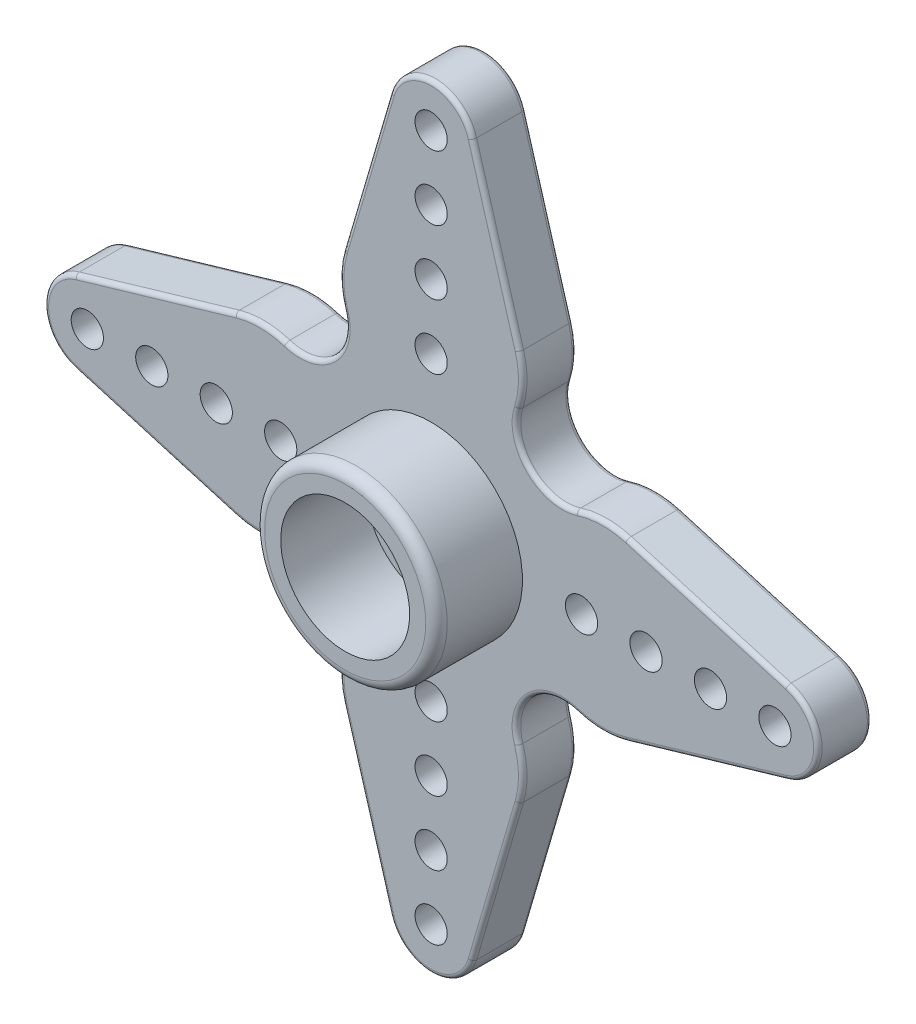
ISO-10303-21;
HEADER;
FILE_DESCRIPTION(('STEP AP214'),'2;1');
FILE_NAME('part.step','',(''),(''),'','','');
FILE_SCHEMA(('AUTOMOTIVE_DESIGN { 1 0 10303 214 1 1 1 1 }'));
ENDSEC;
DATA;
#1=APPLICATION_CONTEXT('core data for automotive mechanical design processes');
#2=APPLICATION_PROTOCOL_DEFINITION('international standard','automotive_design',2000,#1);
#3=PRODUCT_CONTEXT('',#1,'mechanical');
#4=PRODUCT('Part','Part','',(#3));
#5=PRODUCT_RELATED_PRODUCT_CATEGORY('part','',(#4));
#6=PRODUCT_DEFINITION_FORMATION('','',#4);
#7=PRODUCT_DEFINITION_CONTEXT('part definition',#1,'design');
#8=PRODUCT_DEFINITION('design','',#6,#7);
#9=PRODUCT_DEFINITION_SHAPE('','',#8);
#10=(LENGTH_UNIT() NAMED_UNIT(*) SI_UNIT(.MILLI.,.METRE.));
#11=(NAMED_UNIT(*) PLANE_ANGLE_UNIT() SI_UNIT($,.RADIAN.));
#12=(NAMED_UNIT(*) SI_UNIT($,.STERADIAN.) SOLID_ANGLE_UNIT());
#13=UNCERTAINTY_MEASURE_WITH_UNIT(LENGTH_MEASURE(1.E-05),#10,'distance_accuracy_value','');
#14=(GEOMETRIC_REPRESENTATION_CONTEXT(3) GLOBAL_UNCERTAINTY_ASSIGNED_CONTEXT((#13)) GLOBAL_UNIT_ASSIGNED_CONTEXT((#10,
#11,#12)) REPRESENTATION_CONTEXT('',''));
#15=CARTESIAN_POINT('',(0.,0.,0.));
#16=DIRECTION('',(0.,0.,1.));
#17=DIRECTION('',(1.,0.,0.));
#18=AXIS2_PLACEMENT_3D('',#15,#16,#17);
#19=CARTESIAN_POINT('',(0.,0.,0.8));
#20=DIRECTION('',(0.,0.,-1.));
#21=DIRECTION('',(-1.,0.,0.));
#22=AXIS2_PLACEMENT_3D('',#19,#20,#21);
#23=PLANE('',#22);
#24=CARTESIAN_POINT('',(0.,0.,0.8));
#25=DIRECTION('',(0.,0.,-1.));
#26=DIRECTION('',(-1.,0.,0.));
#27=AXIS2_PLACEMENT_3D('',#24,#25,#26);
#28=CIRCLE('',#27,4.5);
#29=CARTESIAN_POINT('',(-4.49999999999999,0.,0.8));
#30=VERTEX_POINT('',#29);
#31=EDGE_CURVE('E723',#30,#30,#28,.T.);
#32=ORIENTED_EDGE('',*,*,#31,.T.);
#33=EDGE_LOOP('',(#32));
#34=FACE_BOUND('',#33,.T.);
#35=CARTESIAN_POINT('',(0.,0.,0.8));
#36=DIRECTION('',(0.,0.,-1.));
#37=DIRECTION('',(-1.,0.,0.));
#38=AXIS2_PLACEMENT_3D('',#35,#36,#37);
#39=CIRCLE('',#38,3.7);
#40=CARTESIAN_POINT('',(-3.7,0.,0.8));
#41=VERTEX_POINT('',#40);
#42=EDGE_CURVE('E1015',#41,#41,#39,.T.);
#43=ORIENTED_EDGE('',*,*,#42,.F.);
#44=EDGE_LOOP('',(#43));
#45=FACE_BOUND('',#44,.T.);
#46=ADVANCED_FACE('F32',(#34,#45),#23,.T.);
#47=CARTESIAN_POINT('',(0.,0.,2.5));
#48=DIRECTION('',(0.,0.,-1.));
#49=DIRECTION('',(-1.,0.,0.));
#50=AXIS2_PLACEMENT_3D('',#47,#48,#49);
#51=CYLINDRICAL_SURFACE('',#50,1.5);
#52=CARTESIAN_POINT('',(0.,0.,2.5));
#53=DIRECTION('',(0.,0.,1.));
#54=DIRECTION('',(1.,0.,0.));
#55=AXIS2_PLACEMENT_3D('',#52,#53,#54);
#56=CIRCLE('',#55,1.5);
#57=CARTESIAN_POINT('',(1.50000000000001,0.,2.5));
#58=VERTEX_POINT('',#57);
#59=EDGE_CURVE('E1102',#58,#58,#56,.T.);
#60=ORIENTED_EDGE('',*,*,#59,.T.);
#61=EDGE_LOOP('',(#60));
#62=FACE_BOUND('',#61,.T.);
#63=CARTESIAN_POINT('',(0.,0.,0.8));
#64=DIRECTION('',(0.,0.,-1.));
#65=DIRECTION('',(-1.,0.,0.));
#66=AXIS2_PLACEMENT_3D('',#63,#64,#65);
#67=CIRCLE('',#66,1.5);
#68=CARTESIAN_POINT('',(-1.49999999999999,0.,0.8));
#69=VERTEX_POINT('',#68);
#70=EDGE_CURVE('E719',#69,#69,#67,.T.);
#71=ORIENTED_EDGE('',*,*,#70,.T.);
#72=EDGE_LOOP('',(#71));
#73=FACE_BOUND('',#72,.T.);
#74=ADVANCED_FACE('F969',(#62,#73),#51,.F.);
#75=CARTESIAN_POINT('',(-7.99143372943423,0.263026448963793,2.5));
#76=DIRECTION('',(0.,0.,-1.));
#77=DIRECTION('',(-1.,0.,0.));
#78=AXIS2_PLACEMENT_3D('',#75,#76,#77);
#79=PLANE('',#78);
#80=CARTESIAN_POINT('',(6.11179245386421,6.11179245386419,2.5));
#81=DIRECTION('',(0.,0.,-1.));
#82=DIRECTION('',(-1.,0.,0.));
#83=AXIS2_PLACEMENT_3D('',#80,#81,#82);
#84=CIRCLE('',#83,2.34337977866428);
#85=CARTESIAN_POINT('',(6.82877781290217,3.88079250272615,2.5));
#86=VERTEX_POINT('',#85);
#87=CARTESIAN_POINT('',(3.88079250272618,6.82877781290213,2.5));
#88=VERTEX_POINT('',#87);
#89=EDGE_CURVE('E365',#86,#88,#84,.T.);
#90=ORIENTED_EDGE('',*,*,#89,.T.);
#91=CARTESIAN_POINT('',(0.263026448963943,7.99143372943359,2.5));
#92=DIRECTION('',(0.,0.,-1.));
#93=DIRECTION('',(-1.,0.,0.));
#94=AXIS2_PLACEMENT_3D('',#91,#92,#93);
#95=CIRCLE('',#94,3.8);
#96=CARTESIAN_POINT('',(3.90963767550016,9.06018372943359,2.5));
#97=VERTEX_POINT('',#96);
#98=EDGE_CURVE('E345',#88,#97,#95,.F.);
#99=ORIENTED_EDGE('',*,*,#98,.T.);
#100=DIRECTION('',(-0.28125,0.959634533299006,0.));
#101=VECTOR('',#100,1.);
#102=CARTESIAN_POINT('',(5.34257255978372,4.17096133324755,2.5));
#103=LINE('',#102,#101);
#104=CARTESIAN_POINT('',(1.72734215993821,16.50625,2.5));
#105=VERTEX_POINT('',#104);
#106=EDGE_CURVE('E353',#97,#105,#103,.T.);
#107=ORIENTED_EDGE('',*,*,#106,.T.);
#108=CARTESIAN_POINT('',(0.,16.,2.5));
#109=DIRECTION('',(0.,0.,-1.));
#110=DIRECTION('',(-1.,0.,0.));
#111=AXIS2_PLACEMENT_3D('',#108,#109,#110);
#112=CIRCLE('',#111,1.8);
#113=CARTESIAN_POINT('',(-1.7273421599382,16.50625,2.5));
#114=VERTEX_POINT('',#113);
#115=EDGE_CURVE('E359',#105,#114,#112,.F.);
#116=ORIENTED_EDGE('',*,*,#115,.T.);
#117=DIRECTION('',(-0.28125,-0.959634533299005,0.));
#118=VECTOR('',#117,1.);
#119=CARTESIAN_POINT('',(-6.60684234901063,-0.142770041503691,2.5));
#120=LINE('',#119,#118);
#121=CARTESIAN_POINT('',(-3.9096376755,9.06018372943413,2.5));
#122=VERTEX_POINT('',#121);
#123=EDGE_CURVE('E732',#114,#122,#120,.T.);
#124=ORIENTED_EDGE('',*,*,#123,.T.);
#125=CARTESIAN_POINT('',(-0.263026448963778,7.99143372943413,2.5));
#126=DIRECTION('',(0.,0.,-1.));
#127=DIRECTION('',(-1.,0.,0.));
#128=AXIS2_PLACEMENT_3D('',#125,#126,#127);
#129=CIRCLE('',#128,3.8);
#130=CARTESIAN_POINT('',(-3.88079250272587,6.82877781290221,2.5));
#131=VERTEX_POINT('',#130);
#132=EDGE_CURVE('E734',#122,#131,#129,.F.);
#133=ORIENTED_EDGE('',*,*,#132,.T.);
#134=CARTESIAN_POINT('',(-6.11179245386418,6.11179245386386,2.5));
#135=DIRECTION('',(0.,0.,-1.));
#136=DIRECTION('',(-1.,0.,0.));
#137=AXIS2_PLACEMENT_3D('',#134,#135,#136);
#138=CIRCLE('',#137,2.34337977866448);
#139=CARTESIAN_POINT('',(-6.82877781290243,3.88079250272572,2.5));
#140=VERTEX_POINT('',#139);
#141=EDGE_CURVE('E736',#131,#140,#138,.T.);
#142=ORIENTED_EDGE('',*,*,#141,.T.);
#143=CARTESIAN_POINT('',(-7.99143372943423,0.263026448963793,2.5));
#144=DIRECTION('',(0.,0.,-1.));
#145=DIRECTION('',(-1.,0.,0.));
#146=AXIS2_PLACEMENT_3D('',#143,#144,#145);
#147=CIRCLE('',#146,3.8);
#148=CARTESIAN_POINT('',(-9.06018372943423,3.90963767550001,2.5));
#149=VERTEX_POINT('',#148);
#150=EDGE_CURVE('E738',#140,#149,#147,.F.);
#151=ORIENTED_EDGE('',*,*,#150,.T.);
#152=DIRECTION('',(-0.959634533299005,-0.28125,0.));
#153=VECTOR('',#152,1.);
#154=CARTESIAN_POINT('',(-9.06018372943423,3.90963767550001,2.5));
#155=LINE('',#154,#153);
#156=CARTESIAN_POINT('',(-16.50625,1.72734215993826,2.5));
#157=VERTEX_POINT('',#156);
#158=EDGE_CURVE('E740',#149,#157,#155,.T.);
#159=ORIENTED_EDGE('',*,*,#158,.T.);
#160=CARTESIAN_POINT('',(-16.0000000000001,0.,2.5));
#161=DIRECTION('',(0.,0.,-1.));
#162=DIRECTION('',(-1.,0.,0.));
#163=AXIS2_PLACEMENT_3D('',#160,#161,#162);
#164=CIRCLE('',#163,1.80000000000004);
#165=CARTESIAN_POINT('',(-16.50625,-1.72734215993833,2.5));
#166=VERTEX_POINT('',#165);
#167=EDGE_CURVE('E742',#157,#166,#164,.F.);
#168=ORIENTED_EDGE('',*,*,#167,.T.);
#169=DIRECTION('',(0.959634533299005,-0.28125,0.));
#170=VECTOR('',#169,1.);
#171=CARTESIAN_POINT('',(-9.20216394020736,-3.86802606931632,2.5));
#172=LINE('',#171,#170);
#173=CARTESIAN_POINT('',(-9.0601837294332,-3.90963767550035,2.5));
#174=VERTEX_POINT('',#173);
#175=EDGE_CURVE('E744',#166,#174,#172,.T.);
#176=ORIENTED_EDGE('',*,*,#175,.T.);
#177=CARTESIAN_POINT('',(-7.99143372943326,-0.263026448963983,2.5));
#178=DIRECTION('',(0.,0.,-1.));
#179=DIRECTION('',(-1.,0.,0.));
#180=AXIS2_PLACEMENT_3D('',#177,#178,#179);
#181=CIRCLE('',#180,3.80000000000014);
#182=CARTESIAN_POINT('',(-6.82877781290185,-3.88079250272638,2.5));
#183=VERTEX_POINT('',#182);
#184=EDGE_CURVE('E746',#174,#183,#181,.F.);
#185=ORIENTED_EDGE('',*,*,#184,.T.);
#186=CARTESIAN_POINT('',(-6.11179245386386,-6.11179245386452,2.5));
#187=DIRECTION('',(0.,0.,-1.));
#188=DIRECTION('',(-1.,0.,0.));
#189=AXIS2_PLACEMENT_3D('',#186,#187,#188);
#190=CIRCLE('',#189,2.34337977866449);
#191=CARTESIAN_POINT('',(-3.88079250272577,-6.82877781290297,2.5));
#192=VERTEX_POINT('',#191);
#193=EDGE_CURVE('E748',#183,#192,#190,.T.);
#194=ORIENTED_EDGE('',*,*,#193,.T.);
#195=CARTESIAN_POINT('',(-0.263026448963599,-7.99143372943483,2.5));
#196=DIRECTION('',(0.,0.,-1.));
#197=DIRECTION('',(-1.,0.,0.));
#198=AXIS2_PLACEMENT_3D('',#195,#196,#197);
#199=CIRCLE('',#198,3.79999999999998);
#200=CARTESIAN_POINT('',(-3.90963767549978,-9.06018372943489,2.5));
#201=VERTEX_POINT('',#200);
#202=EDGE_CURVE('E750',#192,#201,#199,.F.);
#203=ORIENTED_EDGE('',*,*,#202,.T.);
#204=DIRECTION('',(0.28125,-0.959634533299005,0.));
#205=VECTOR('',#204,1.);
#206=CARTESIAN_POINT('',(-6.74882255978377,0.627211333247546,2.5));
#207=LINE('',#206,#205);
#208=CARTESIAN_POINT('',(-1.72734215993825,-16.50625,2.5));
#209=VERTEX_POINT('',#208);
#210=EDGE_CURVE('E752',#201,#209,#207,.T.);
#211=ORIENTED_EDGE('',*,*,#210,.T.);
#212=CARTESIAN_POINT('',(0.,-16.0000000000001,2.5));
#213=DIRECTION('',(0.,0.,-1.));
#214=DIRECTION('',(-1.,0.,0.));
#215=AXIS2_PLACEMENT_3D('',#212,#213,#214);
#216=CIRCLE('',#215,1.8);
#217=CARTESIAN_POINT('',(1.72734215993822,-16.5062500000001,2.5));
#218=VERTEX_POINT('',#217);
#219=EDGE_CURVE('E754',#209,#218,#216,.F.);
#220=ORIENTED_EDGE('',*,*,#219,.T.);
#221=DIRECTION('',(0.28125,0.959634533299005,0.));
#222=VECTOR('',#221,1.);
#223=CARTESIAN_POINT('',(5.48455277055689,-3.68652004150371,2.5));
#224=LINE('',#223,#222);
#225=CARTESIAN_POINT('',(3.90963767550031,-9.06018372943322,2.5));
#226=VERTEX_POINT('',#225);
#227=EDGE_CURVE('E756',#218,#226,#224,.T.);
#228=ORIENTED_EDGE('',*,*,#227,.T.);
#229=CARTESIAN_POINT('',(0.263026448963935,-7.99143372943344,2.5));
#230=DIRECTION('',(0.,0.,-1.));
#231=DIRECTION('',(-1.,0.,0.));
#232=AXIS2_PLACEMENT_3D('',#229,#230,#231);
#233=CIRCLE('',#232,3.80000000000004);
#234=CARTESIAN_POINT('',(3.88079250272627,-6.82877781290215,2.5));
#235=VERTEX_POINT('',#234);
#236=EDGE_CURVE('E758',#226,#235,#233,.F.);
#237=ORIENTED_EDGE('',*,*,#236,.T.);
#238=CARTESIAN_POINT('',(6.11179245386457,-6.11179245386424,2.5));
#239=DIRECTION('',(0.,0.,-1.));
#240=DIRECTION('',(-1.,0.,0.));
#241=AXIS2_PLACEMENT_3D('',#238,#239,#240);
#242=CIRCLE('',#241,2.34337977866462);
#243=CARTESIAN_POINT('',(6.82877781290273,-3.88079250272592,2.5));
#244=VERTEX_POINT('',#243);
#245=EDGE_CURVE('E760',#235,#244,#242,.T.);
#246=ORIENTED_EDGE('',*,*,#245,.T.);
#247=CARTESIAN_POINT('',(7.99143372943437,-0.263026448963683,2.5));
#248=DIRECTION('',(0.,0.,-1.));
#249=DIRECTION('',(-1.,0.,0.));
#250=AXIS2_PLACEMENT_3D('',#247,#248,#249);
#251=CIRCLE('',#250,3.8);
#252=CARTESIAN_POINT('',(9.06018372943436,-3.9096376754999,2.5));
#253=VERTEX_POINT('',#252);
#254=EDGE_CURVE('E762',#244,#253,#251,.F.);
#255=ORIENTED_EDGE('',*,*,#254,.T.);
#256=DIRECTION('',(0.959634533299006,0.28125,0.));
#257=VECTOR('',#256,1.);
#258=CARTESIAN_POINT('',(-5.51643372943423,-8.18175744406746,2.5));
#259=LINE('',#258,#257);
#260=CARTESIAN_POINT('',(16.50625,-1.72734215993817,2.5));
#261=VERTEX_POINT('',#260);
#262=EDGE_CURVE('E764',#253,#261,#259,.T.);
#263=ORIENTED_EDGE('',*,*,#262,.T.);
#264=CARTESIAN_POINT('',(16.0000000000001,0.,2.5));
#265=DIRECTION('',(0.,0.,-1.));
#266=DIRECTION('',(-1.,0.,0.));
#267=AXIS2_PLACEMENT_3D('',#264,#265,#266);
#268=CIRCLE('',#267,1.79999999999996);
#269=CARTESIAN_POINT('',(16.5062500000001,1.72734215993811,2.5));
#270=VERTEX_POINT('',#269);
#271=EDGE_CURVE('E766',#261,#270,#268,.F.);
#272=ORIENTED_EDGE('',*,*,#271,.T.);
#273=DIRECTION('',(-0.959634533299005,0.28125,0.));
#274=VECTOR('',#273,1.);
#275=CARTESIAN_POINT('',(-5.65841394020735,8.2233690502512,2.5));
#276=LINE('',#275,#274);
#277=CARTESIAN_POINT('',(9.06018372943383,3.90963767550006,2.5));
#278=VERTEX_POINT('',#277);
#279=EDGE_CURVE('E768',#270,#278,#276,.T.);
#280=ORIENTED_EDGE('',*,*,#279,.T.);
#281=CARTESIAN_POINT('',(7.99143372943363,0.263026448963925,2.5));
#282=DIRECTION('',(0.,0.,-1.));
#283=DIRECTION('',(-1.,0.,0.));
#284=AXIS2_PLACEMENT_3D('',#281,#282,#283);
#285=CIRCLE('',#284,3.79999999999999);
#286=EDGE_CURVE('E371',#278,#86,#285,.F.);
#287=ORIENTED_EDGE('',*,*,#286,.T.);
#288=EDGE_LOOP('',(#90,#99,#107,#116,#124,#133,#142,#151,#159,#168,#176,#185,#194,#203,#211,
#220,#228,#237,#246,#255,#263,#272,#280,#287));
#289=FACE_BOUND('',#288,.T.);
#290=CARTESIAN_POINT('',(-12.9999999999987,-1.30124199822E-12,2.5));
#291=DIRECTION('',(0.,0.,1.));
#292=DIRECTION('',(1.,0.,0.));
#293=AXIS2_PLACEMENT_3D('',#290,#291,#292);
#294=CIRCLE('',#293,0.750000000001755);
#295=CARTESIAN_POINT('',(-12.2499999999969,-1.30124199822E-12,2.5));
#296=VERTEX_POINT('',#295);
#297=EDGE_CURVE('E1039',#296,#296,#294,.T.);
#298=ORIENTED_EDGE('',*,*,#297,.F.);
#299=EDGE_LOOP('',(#298));
#300=FACE_BOUND('',#299,.T.);
#301=CARTESIAN_POINT('',(-6.9999999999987,-1.29940502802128E-12,2.5));
#302=DIRECTION('',(0.,0.,1.));
#303=DIRECTION('',(1.,0.,0.));
#304=AXIS2_PLACEMENT_3D('',#301,#302,#303);
#305=CIRCLE('',#304,0.750000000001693);
#306=CARTESIAN_POINT('',(-6.24999999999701,-1.29940502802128E-12,2.5));
#307=VERTEX_POINT('',#306);
#308=EDGE_CURVE('E1051',#307,#307,#305,.T.);
#309=ORIENTED_EDGE('',*,*,#308,.F.);
#310=EDGE_LOOP('',(#309));
#311=FACE_BOUND('',#310,.T.);
#312=CARTESIAN_POINT('',(2.5999122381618E-12,-13.,2.5));
#313=DIRECTION('',(0.,0.,1.));
#314=DIRECTION('',(1.,0.,0.));
#315=AXIS2_PLACEMENT_3D('',#312,#313,#314);
#316=CIRCLE('',#315,0.750000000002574);
#317=CARTESIAN_POINT('',(0.750000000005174,-13.,2.5));
#318=VERTEX_POINT('',#317);
#319=EDGE_CURVE('E1063',#318,#318,#316,.T.);
#320=ORIENTED_EDGE('',*,*,#319,.F.);
#321=EDGE_LOOP('',(#320));
#322=FACE_BOUND('',#321,.T.);
#323=CARTESIAN_POINT('',(2.59844266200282E-12,-7.,2.5));
#324=DIRECTION('',(0.,0.,1.));
#325=DIRECTION('',(1.,0.,0.));
#326=AXIS2_PLACEMENT_3D('',#323,#324,#325);
#327=CIRCLE('',#326,0.750000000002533);
#328=CARTESIAN_POINT('',(0.750000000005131,-7.,2.5));
#329=VERTEX_POINT('',#328);
#330=EDGE_CURVE('E1075',#329,#329,#327,.T.);
#331=ORIENTED_EDGE('',*,*,#330,.F.);
#332=EDGE_LOOP('',(#331));
#333=FACE_BOUND('',#332,.T.);
#334=CARTESIAN_POINT('',(13.0000000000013,1.29964995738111E-12,2.5));
#335=DIRECTION('',(0.,0.,1.));
#336=DIRECTION('',(1.,0.,0.));
#337=AXIS2_PLACEMENT_3D('',#334,#335,#336);
#338=CIRCLE('',#337,0.750000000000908);
#339=CARTESIAN_POINT('',(13.7500000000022,1.29964995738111E-12,2.5));
#340=VERTEX_POINT('',#339);
#341=EDGE_CURVE('E1087',#340,#340,#338,.T.);
#342=ORIENTED_EDGE('',*,*,#341,.F.);
#343=EDGE_LOOP('',(#342));
#344=FACE_BOUND('',#343,.T.);
#345=CARTESIAN_POINT('',(7.0000000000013,1.29854777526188E-12,2.5));
#346=DIRECTION('',(0.,0.,1.));
#347=DIRECTION('',(1.,0.,0.));
#348=AXIS2_PLACEMENT_3D('',#345,#346,#347);
#349=CIRCLE('',#348,0.750000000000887);
#350=CARTESIAN_POINT('',(7.75000000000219,1.29854777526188E-12,2.5));
#351=VERTEX_POINT('',#350);
#352=EDGE_CURVE('E1099',#351,#351,#349,.T.);
#353=ORIENTED_EDGE('',*,*,#352,.F.);
#354=EDGE_LOOP('',(#353));
#355=FACE_BOUND('',#354,.T.);
#356=CARTESIAN_POINT('',(0.,16.,2.5));
#357=DIRECTION('',(0.,0.,1.));
#358=DIRECTION('',(1.,0.,0.));
#359=AXIS2_PLACEMENT_3D('',#356,#357,#358);
#360=CIRCLE('',#359,0.75);
#361=CARTESIAN_POINT('',(0.750000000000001,16.,2.5));
#362=VERTEX_POINT('',#361);
#363=EDGE_CURVE('E1108',#362,#362,#360,.T.);
#364=ORIENTED_EDGE('',*,*,#363,.F.);
#365=EDGE_LOOP('',(#364));
#366=FACE_BOUND('',#365,.T.);
#367=CARTESIAN_POINT('',(0.,10.,2.5));
#368=DIRECTION('',(0.,0.,1.));
#369=DIRECTION('',(1.,0.,0.));
#370=AXIS2_PLACEMENT_3D('',#367,#368,#369);
#371=CIRCLE('',#370,0.750000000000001);
#372=CARTESIAN_POINT('',(0.750000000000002,10.,2.5));
#373=VERTEX_POINT('',#372);
#374=EDGE_CURVE('E1120',#373,#373,#371,.T.);
#375=ORIENTED_EDGE('',*,*,#374,.F.);
#376=EDGE_LOOP('',(#375));
#377=FACE_BOUND('',#376,.T.);
#378=CARTESIAN_POINT('',(0.,7.,2.5));
#379=DIRECTION('',(0.,0.,1.));
#380=DIRECTION('',(1.,0.,0.));
#381=AXIS2_PLACEMENT_3D('',#378,#379,#380);
#382=CIRCLE('',#381,0.75);
#383=CARTESIAN_POINT('',(0.750000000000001,7.,2.5));
#384=VERTEX_POINT('',#383);
#385=EDGE_CURVE('E1126',#384,#384,#382,.T.);
#386=ORIENTED_EDGE('',*,*,#385,.F.);
#387=EDGE_LOOP('',(#386));
#388=FACE_BOUND('',#387,.T.);
#389=CARTESIAN_POINT('',(0.,13.,2.5));
#390=DIRECTION('',(0.,0.,1.));
#391=DIRECTION('',(1.,0.,0.));
#392=AXIS2_PLACEMENT_3D('',#389,#390,#391);
#393=CIRCLE('',#392,0.750000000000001);
#394=CARTESIAN_POINT('',(0.750000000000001,13.,2.5));
#395=VERTEX_POINT('',#394);
#396=EDGE_CURVE('E1114',#395,#395,#393,.T.);
#397=ORIENTED_EDGE('',*,*,#396,.F.);
#398=EDGE_LOOP('',(#397));
#399=FACE_BOUND('',#398,.T.);
#400=CARTESIAN_POINT('',(10.0000000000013,1.2990988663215E-12,2.5));
#401=DIRECTION('',(0.,0.,1.));
#402=DIRECTION('',(1.,0.,0.));
#403=AXIS2_PLACEMENT_3D('',#400,#401,#402);
#404=CIRCLE('',#403,0.750000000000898);
#405=CARTESIAN_POINT('',(10.7500000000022,1.2990988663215E-12,2.5));
#406=VERTEX_POINT('',#405);
#407=EDGE_CURVE('E1093',#406,#406,#404,.T.);
#408=ORIENTED_EDGE('',*,*,#407,.F.);
#409=EDGE_LOOP('',(#408));
#410=FACE_BOUND('',#409,.T.);
#411=CARTESIAN_POINT('',(16.0000000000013,1.30020104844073E-12,2.5));
#412=DIRECTION('',(0.,0.,1.));
#413=DIRECTION('',(1.,0.,0.));
#414=AXIS2_PLACEMENT_3D('',#411,#412,#413);
#415=CIRCLE('',#414,0.750000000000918);
#416=CARTESIAN_POINT('',(16.7500000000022,1.30020104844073E-12,2.5));
#417=VERTEX_POINT('',#416);
#418=EDGE_CURVE('E1081',#417,#417,#415,.T.);
#419=ORIENTED_EDGE('',*,*,#418,.F.);
#420=EDGE_LOOP('',(#419));
#421=FACE_BOUND('',#420,.T.);
#422=CARTESIAN_POINT('',(2.59917745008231E-12,-10.,2.5));
#423=DIRECTION('',(0.,0.,1.));
#424=DIRECTION('',(1.,0.,0.));
#425=AXIS2_PLACEMENT_3D('',#422,#423,#424);
#426=CIRCLE('',#425,0.750000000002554);
#427=CARTESIAN_POINT('',(0.750000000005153,-10.,2.5));
#428=VERTEX_POINT('',#427);
#429=EDGE_CURVE('E1069',#428,#428,#426,.T.);
#430=ORIENTED_EDGE('',*,*,#429,.F.);
#431=EDGE_LOOP('',(#430));
#432=FACE_BOUND('',#431,.T.);
#433=CARTESIAN_POINT('',(2.60064702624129E-12,-16.,2.5));
#434=DIRECTION('',(0.,0.,1.));
#435=DIRECTION('',(1.,0.,0.));
#436=AXIS2_PLACEMENT_3D('',#433,#434,#435);
#437=CIRCLE('',#436,0.750000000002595);
#438=CARTESIAN_POINT('',(0.750000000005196,-16.,2.5));
#439=VERTEX_POINT('',#438);
#440=EDGE_CURVE('E1057',#439,#439,#437,.T.);
#441=ORIENTED_EDGE('',*,*,#440,.F.);
#442=EDGE_LOOP('',(#441));
#443=FACE_BOUND('',#442,.T.);
#444=CARTESIAN_POINT('',(-9.9999999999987,-1.30032351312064E-12,2.5));
#445=DIRECTION('',(0.,0.,1.));
#446=DIRECTION('',(1.,0.,0.));
#447=AXIS2_PLACEMENT_3D('',#444,#445,#446);
#448=CIRCLE('',#447,0.750000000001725);
#449=CARTESIAN_POINT('',(-9.24999999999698,-1.30032351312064E-12,2.5));
#450=VERTEX_POINT('',#449);
#451=EDGE_CURVE('E1045',#450,#450,#448,.T.);
#452=ORIENTED_EDGE('',*,*,#451,.F.);
#453=EDGE_LOOP('',(#452));
#454=FACE_BOUND('',#453,.T.);
#455=CARTESIAN_POINT('',(-15.9999999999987,-1.30216048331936E-12,2.5));
#456=DIRECTION('',(0.,0.,1.));
#457=DIRECTION('',(1.,0.,0.));
#458=AXIS2_PLACEMENT_3D('',#455,#456,#457);
#459=CIRCLE('',#458,0.750000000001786);
#460=CARTESIAN_POINT('',(-15.2499999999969,-1.30216048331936E-12,2.5));
#461=VERTEX_POINT('',#460);
#462=EDGE_CURVE('E1033',#461,#461,#459,.T.);
#463=ORIENTED_EDGE('',*,*,#462,.F.);
#464=EDGE_LOOP('',(#463));
#465=FACE_BOUND('',#464,.T.);
#466=CARTESIAN_POINT('',(0.,0.,2.5));
#467=DIRECTION('',(0.,0.,-1.));
#468=DIRECTION('',(-1.,0.,0.));
#469=AXIS2_PLACEMENT_3D('',#466,#467,#468);
#470=CIRCLE('',#469,4.25);
#471=CARTESIAN_POINT('',(-4.25,0.,2.5));
#472=VERTEX_POINT('',#471);
#473=EDGE_CURVE('E715',#472,#472,#470,.F.);
#474=ORIENTED_EDGE('',*,*,#473,.F.);
#475=EDGE_LOOP('',(#474));
#476=FACE_BOUND('',#475,.T.);
#477=ADVANCED_FACE('F362',(#289,#300,#311,#322,#333,#344,#355,#366,#377,#388,#399,#410,#421,
#432,#443,#454,#465,#476),#79,.F.);
#478=CARTESIAN_POINT('',(0.,0.,2.5));
#479=DIRECTION('',(0.,0.,1.));
#480=DIRECTION('',(1.,0.,0.));
#481=AXIS2_PLACEMENT_3D('',#478,#479,#480);
#482=CIRCLE('',#481,3.);
#483=CARTESIAN_POINT('',(3.,0.,2.5));
#484=VERTEX_POINT('',#483);
#485=EDGE_CURVE('E722',#484,#484,#482,.T.);
#486=ORIENTED_EDGE('',*,*,#485,.T.);
#487=EDGE_LOOP('',(#486));
#488=FACE_BOUND('',#487,.T.);
#489=ORIENTED_EDGE('',*,*,#59,.F.);
#490=EDGE_LOOP('',(#489));
#491=FACE_BOUND('',#490,.T.);
#492=ADVANCED_FACE('F1589',(#488,#491),#79,.F.);
#493=CARTESIAN_POINT('',(-7.99143372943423,0.263026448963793,0.));
#494=DIRECTION('',(0.,0.,-1.));
#495=DIRECTION('',(-1.,0.,0.));
#496=AXIS2_PLACEMENT_3D('',#493,#494,#495);
#497=PLANE('',#496);
#498=DIRECTION('',(-0.28125,0.959634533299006,0.));
#499=VECTOR('',#498,1.);
#500=CARTESIAN_POINT('',(3.90963767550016,9.06018372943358,0.));
#501=LINE('',#500,#499);
#502=CARTESIAN_POINT('',(1.72734215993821,16.50625,0.));
#503=VERTEX_POINT('',#502);
#504=CARTESIAN_POINT('',(3.90963767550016,9.06018372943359,0.));
#505=VERTEX_POINT('',#504);
#506=EDGE_CURVE('E464',#503,#505,#501,.F.);
#507=ORIENTED_EDGE('',*,*,#506,.T.);
#508=CARTESIAN_POINT('',(0.263026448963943,7.99143372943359,0.));
#509=DIRECTION('',(0.,0.,-1.));
#510=DIRECTION('',(-1.,0.,0.));
#511=AXIS2_PLACEMENT_3D('',#508,#509,#510);
#512=CIRCLE('',#511,3.8);
#513=CARTESIAN_POINT('',(3.88079250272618,6.82877781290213,0.));
#514=VERTEX_POINT('',#513);
#515=EDGE_CURVE('E509',#505,#514,#512,.T.);
#516=ORIENTED_EDGE('',*,*,#515,.T.);
#517=CARTESIAN_POINT('',(6.11179245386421,6.11179245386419,0.));
#518=DIRECTION('',(0.,0.,-1.));
#519=DIRECTION('',(-1.,0.,0.));
#520=AXIS2_PLACEMENT_3D('',#517,#518,#519);
#521=CIRCLE('',#520,2.34337977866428);
#522=CARTESIAN_POINT('',(6.82877781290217,3.88079250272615,0.));
#523=VERTEX_POINT('',#522);
#524=EDGE_CURVE('E56',#514,#523,#521,.F.);
#525=ORIENTED_EDGE('',*,*,#524,.T.);
#526=CARTESIAN_POINT('',(7.99143372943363,0.263026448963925,0.));
#527=DIRECTION('',(0.,0.,-1.));
#528=DIRECTION('',(-1.,0.,0.));
#529=AXIS2_PLACEMENT_3D('',#526,#527,#528);
#530=CIRCLE('',#529,3.79999999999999);
#531=CARTESIAN_POINT('',(9.06018372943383,3.90963767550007,0.));
#532=VERTEX_POINT('',#531);
#533=EDGE_CURVE('E506',#523,#532,#530,.T.);
#534=ORIENTED_EDGE('',*,*,#533,.T.);
#535=DIRECTION('',(-0.959634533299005,0.28125,0.));
#536=VECTOR('',#535,1.);
#537=CARTESIAN_POINT('',(16.5062500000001,1.72734215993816,0.));
#538=LINE('',#537,#536);
#539=CARTESIAN_POINT('',(16.5062500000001,1.72734215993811,0.));
#540=VERTEX_POINT('',#539);
#541=EDGE_CURVE('E504',#532,#540,#538,.F.);
#542=ORIENTED_EDGE('',*,*,#541,.T.);
#543=CARTESIAN_POINT('',(16.0000000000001,0.,0.));
#544=DIRECTION('',(0.,0.,-1.));
#545=DIRECTION('',(-1.,0.,0.));
#546=AXIS2_PLACEMENT_3D('',#543,#544,#545);
#547=CIRCLE('',#546,1.79999999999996);
#548=CARTESIAN_POINT('',(16.50625,-1.72734215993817,0.));
#549=VERTEX_POINT('',#548);
#550=EDGE_CURVE('E502',#540,#549,#547,.T.);
#551=ORIENTED_EDGE('',*,*,#550,.T.);
#552=DIRECTION('',(0.959634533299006,0.28125,0.));
#553=VECTOR('',#552,1.);
#554=CARTESIAN_POINT('',(9.06018372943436,-3.9096376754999,0.));
#555=LINE('',#554,#553);
#556=CARTESIAN_POINT('',(9.06018372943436,-3.9096376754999,0.));
#557=VERTEX_POINT('',#556);
#558=EDGE_CURVE('E500',#549,#557,#555,.F.);
#559=ORIENTED_EDGE('',*,*,#558,.T.);
#560=CARTESIAN_POINT('',(7.99143372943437,-0.263026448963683,0.));
#561=DIRECTION('',(0.,0.,-1.));
#562=DIRECTION('',(-1.,0.,0.));
#563=AXIS2_PLACEMENT_3D('',#560,#561,#562);
#564=CIRCLE('',#563,3.8);
#565=CARTESIAN_POINT('',(6.82877781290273,-3.88079250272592,0.));
#566=VERTEX_POINT('',#565);
#567=EDGE_CURVE('E498',#557,#566,#564,.T.);
#568=ORIENTED_EDGE('',*,*,#567,.T.);
#569=CARTESIAN_POINT('',(6.11179245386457,-6.11179245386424,0.));
#570=DIRECTION('',(0.,0.,-1.));
#571=DIRECTION('',(-1.,0.,0.));
#572=AXIS2_PLACEMENT_3D('',#569,#570,#571);
#573=CIRCLE('',#572,2.34337977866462);
#574=CARTESIAN_POINT('',(3.88079250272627,-6.82877781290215,0.));
#575=VERTEX_POINT('',#574);
#576=EDGE_CURVE('E496',#566,#575,#573,.F.);
#577=ORIENTED_EDGE('',*,*,#576,.T.);
#578=CARTESIAN_POINT('',(0.263026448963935,-7.99143372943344,0.));
#579=DIRECTION('',(0.,0.,-1.));
#580=DIRECTION('',(-1.,0.,0.));
#581=AXIS2_PLACEMENT_3D('',#578,#579,#580);
#582=CIRCLE('',#581,3.80000000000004);
#583=CARTESIAN_POINT('',(3.90963767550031,-9.06018372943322,0.));
#584=VERTEX_POINT('',#583);
#585=EDGE_CURVE('E494',#575,#584,#582,.T.);
#586=ORIENTED_EDGE('',*,*,#585,.T.);
#587=DIRECTION('',(0.28125,0.959634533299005,0.));
#588=VECTOR('',#587,1.);
#589=CARTESIAN_POINT('',(1.72734215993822,-16.5062500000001,0.));
#590=LINE('',#589,#588);
#591=CARTESIAN_POINT('',(1.72734215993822,-16.5062500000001,0.));
#592=VERTEX_POINT('',#591);
#593=EDGE_CURVE('E492',#584,#592,#590,.F.);
#594=ORIENTED_EDGE('',*,*,#593,.T.);
#595=CARTESIAN_POINT('',(0.,-16.0000000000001,0.));
#596=DIRECTION('',(0.,0.,-1.));
#597=DIRECTION('',(-1.,0.,0.));
#598=AXIS2_PLACEMENT_3D('',#595,#596,#597);
#599=CIRCLE('',#598,1.8);
#600=CARTESIAN_POINT('',(-1.72734215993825,-16.50625,0.));
#601=VERTEX_POINT('',#600);
#602=EDGE_CURVE('E490',#592,#601,#599,.T.);
#603=ORIENTED_EDGE('',*,*,#602,.T.);
#604=DIRECTION('',(0.28125,-0.959634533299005,0.));
#605=VECTOR('',#604,1.);
#606=CARTESIAN_POINT('',(-3.9096376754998,-9.0601837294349,0.));
#607=LINE('',#606,#605);
#608=CARTESIAN_POINT('',(-3.90963767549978,-9.06018372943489,0.));
#609=VERTEX_POINT('',#608);
#610=EDGE_CURVE('E488',#601,#609,#607,.F.);
#611=ORIENTED_EDGE('',*,*,#610,.T.);
#612=CARTESIAN_POINT('',(-0.263026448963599,-7.99143372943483,0.));
#613=DIRECTION('',(0.,0.,-1.));
#614=DIRECTION('',(-1.,0.,0.));
#615=AXIS2_PLACEMENT_3D('',#612,#613,#614);
#616=CIRCLE('',#615,3.79999999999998);
#617=CARTESIAN_POINT('',(-3.88079250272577,-6.82877781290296,0.));
#618=VERTEX_POINT('',#617);
#619=EDGE_CURVE('E486',#609,#618,#616,.T.);
#620=ORIENTED_EDGE('',*,*,#619,.T.);
#621=CARTESIAN_POINT('',(-6.11179245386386,-6.11179245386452,0.));
#622=DIRECTION('',(0.,0.,-1.));
#623=DIRECTION('',(-1.,0.,0.));
#624=AXIS2_PLACEMENT_3D('',#621,#622,#623);
#625=CIRCLE('',#624,2.34337977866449);
#626=CARTESIAN_POINT('',(-6.82877781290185,-3.88079250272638,0.));
#627=VERTEX_POINT('',#626);
#628=EDGE_CURVE('E484',#618,#627,#625,.F.);
#629=ORIENTED_EDGE('',*,*,#628,.T.);
#630=CARTESIAN_POINT('',(-7.99143372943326,-0.263026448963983,0.));
#631=DIRECTION('',(0.,0.,-1.));
#632=DIRECTION('',(-1.,0.,0.));
#633=AXIS2_PLACEMENT_3D('',#630,#631,#632);
#634=CIRCLE('',#633,3.80000000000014);
#635=CARTESIAN_POINT('',(-9.0601837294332,-3.90963767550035,0.));
#636=VERTEX_POINT('',#635);
#637=EDGE_CURVE('E482',#627,#636,#634,.T.);
#638=ORIENTED_EDGE('',*,*,#637,.T.);
#639=DIRECTION('',(0.959634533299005,-0.28125,0.));
#640=VECTOR('',#639,1.);
#641=CARTESIAN_POINT('',(-16.50625,-1.72734215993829,0.));
#642=LINE('',#641,#640);
#643=CARTESIAN_POINT('',(-16.50625,-1.72734215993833,0.));
#644=VERTEX_POINT('',#643);
#645=EDGE_CURVE('E480',#636,#644,#642,.F.);
#646=ORIENTED_EDGE('',*,*,#645,.T.);
#647=CARTESIAN_POINT('',(-16.0000000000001,0.,0.));
#648=DIRECTION('',(0.,0.,-1.));
#649=DIRECTION('',(-1.,0.,0.));
#650=AXIS2_PLACEMENT_3D('',#647,#648,#649);
#651=CIRCLE('',#650,1.80000000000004);
#652=CARTESIAN_POINT('',(-16.50625,1.72734215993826,0.));
#653=VERTEX_POINT('',#652);
#654=EDGE_CURVE('E478',#644,#653,#651,.T.);
#655=ORIENTED_EDGE('',*,*,#654,.T.);
#656=DIRECTION('',(-0.959634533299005,-0.28125,0.));
#657=VECTOR('',#656,1.);
#658=CARTESIAN_POINT('',(-9.06018372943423,3.90963767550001,0.));
#659=LINE('',#658,#657);
#660=CARTESIAN_POINT('',(-9.06018372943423,3.90963767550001,0.));
#661=VERTEX_POINT('',#660);
#662=EDGE_CURVE('E476',#653,#661,#659,.F.);
#663=ORIENTED_EDGE('',*,*,#662,.T.);
#664=CARTESIAN_POINT('',(-7.99143372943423,0.263026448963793,0.));
#665=DIRECTION('',(0.,0.,-1.));
#666=DIRECTION('',(-1.,0.,0.));
#667=AXIS2_PLACEMENT_3D('',#664,#665,#666);
#668=CIRCLE('',#667,3.8);
#669=CARTESIAN_POINT('',(-6.82877781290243,3.88079250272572,0.));
#670=VERTEX_POINT('',#669);
#671=EDGE_CURVE('E474',#661,#670,#668,.T.);
#672=ORIENTED_EDGE('',*,*,#671,.T.);
#673=CARTESIAN_POINT('',(-6.11179245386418,6.11179245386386,0.));
#674=DIRECTION('',(0.,0.,-1.));
#675=DIRECTION('',(-1.,0.,0.));
#676=AXIS2_PLACEMENT_3D('',#673,#674,#675);
#677=CIRCLE('',#676,2.34337977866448);
#678=CARTESIAN_POINT('',(-3.88079250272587,6.82877781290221,0.));
#679=VERTEX_POINT('',#678);
#680=EDGE_CURVE('E472',#670,#679,#677,.F.);
#681=ORIENTED_EDGE('',*,*,#680,.T.);
#682=CARTESIAN_POINT('',(-0.263026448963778,7.99143372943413,0.));
#683=DIRECTION('',(0.,0.,-1.));
#684=DIRECTION('',(-1.,0.,0.));
#685=AXIS2_PLACEMENT_3D('',#682,#683,#684);
#686=CIRCLE('',#685,3.8);
#687=CARTESIAN_POINT('',(-3.9096376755,9.06018372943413,0.));
#688=VERTEX_POINT('',#687);
#689=EDGE_CURVE('E470',#679,#688,#686,.T.);
#690=ORIENTED_EDGE('',*,*,#689,.T.);
#691=DIRECTION('',(-0.28125,-0.959634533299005,0.));
#692=VECTOR('',#691,1.);
#693=CARTESIAN_POINT('',(-1.7273421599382,16.50625,0.));
#694=LINE('',#693,#692);
#695=CARTESIAN_POINT('',(-1.7273421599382,16.50625,0.));
#696=VERTEX_POINT('',#695);
#697=EDGE_CURVE('E468',#688,#696,#694,.F.);
#698=ORIENTED_EDGE('',*,*,#697,.T.);
#699=CARTESIAN_POINT('',(0.,16.,0.));
#700=DIRECTION('',(0.,0.,-1.));
#701=DIRECTION('',(-1.,0.,0.));
#702=AXIS2_PLACEMENT_3D('',#699,#700,#701);
#703=CIRCLE('',#702,1.8);
#704=EDGE_CURVE('E466',#696,#503,#703,.T.);
#705=ORIENTED_EDGE('',*,*,#704,.T.);
#706=EDGE_LOOP('',(#507,#516,#525,#534,#542,#551,#559,#568,#577,#586,#594,#603,#611,#620,#629,
#638,#646,#655,#663,#672,#681,#690,#698,#705));
#707=FACE_BOUND('',#706,.T.);
#708=CARTESIAN_POINT('',(0.,0.,0.));
#709=DIRECTION('',(0.,0.,-1.));
#710=DIRECTION('',(-1.,0.,0.));
#711=AXIS2_PLACEMENT_3D('',#708,#709,#710);
#712=CIRCLE('',#711,4.5);
#713=CARTESIAN_POINT('',(-4.49999999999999,0.,0.));
#714=VERTEX_POINT('',#713);
#715=EDGE_CURVE('E1022',#714,#714,#712,.T.);
#716=ORIENTED_EDGE('',*,*,#715,.F.);
#717=EDGE_LOOP('',(#716));
#718=FACE_BOUND('',#717,.T.);
#719=CARTESIAN_POINT('',(-12.9999999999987,-1.30124199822E-12,0.));
#720=DIRECTION('',(0.,0.,1.));
#721=DIRECTION('',(1.,0.,0.));
#722=AXIS2_PLACEMENT_3D('',#719,#720,#721);
#723=CIRCLE('',#722,0.750000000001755);
#724=CARTESIAN_POINT('',(-12.2499999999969,-1.30124199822E-12,0.));
#725=VERTEX_POINT('',#724);
#726=EDGE_CURVE('E1036',#725,#725,#723,.T.);
#727=ORIENTED_EDGE('',*,*,#726,.T.);
#728=EDGE_LOOP('',(#727));
#729=FACE_BOUND('',#728,.T.);
#730=CARTESIAN_POINT('',(-6.9999999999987,-1.29940502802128E-12,0.));
#731=DIRECTION('',(0.,0.,1.));
#732=DIRECTION('',(1.,0.,0.));
#733=AXIS2_PLACEMENT_3D('',#730,#731,#732);
#734=CIRCLE('',#733,0.750000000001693);
#735=CARTESIAN_POINT('',(-6.24999999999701,-1.29940502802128E-12,0.));
#736=VERTEX_POINT('',#735);
#737=EDGE_CURVE('E1048',#736,#736,#734,.T.);
#738=ORIENTED_EDGE('',*,*,#737,.T.);
#739=EDGE_LOOP('',(#738));
#740=FACE_BOUND('',#739,.T.);
#741=CARTESIAN_POINT('',(2.5999122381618E-12,-13.,0.));
#742=DIRECTION('',(0.,0.,1.));
#743=DIRECTION('',(1.,0.,0.));
#744=AXIS2_PLACEMENT_3D('',#741,#742,#743);
#745=CIRCLE('',#744,0.750000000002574);
#746=CARTESIAN_POINT('',(0.750000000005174,-13.,0.));
#747=VERTEX_POINT('',#746);
#748=EDGE_CURVE('E1060',#747,#747,#745,.T.);
#749=ORIENTED_EDGE('',*,*,#748,.T.);
#750=EDGE_LOOP('',(#749));
#751=FACE_BOUND('',#750,.T.);
#752=CARTESIAN_POINT('',(2.59844266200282E-12,-7.,0.));
#753=DIRECTION('',(0.,0.,1.));
#754=DIRECTION('',(1.,0.,0.));
#755=AXIS2_PLACEMENT_3D('',#752,#753,#754);
#756=CIRCLE('',#755,0.750000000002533);
#757=CARTESIAN_POINT('',(0.750000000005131,-7.,0.));
#758=VERTEX_POINT('',#757);
#759=EDGE_CURVE('E1072',#758,#758,#756,.T.);
#760=ORIENTED_EDGE('',*,*,#759,.T.);
#761=EDGE_LOOP('',(#760));
#762=FACE_BOUND('',#761,.T.);
#763=CARTESIAN_POINT('',(13.0000000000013,1.29964995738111E-12,0.));
#764=DIRECTION('',(0.,0.,1.));
#765=DIRECTION('',(1.,0.,0.));
#766=AXIS2_PLACEMENT_3D('',#763,#764,#765);
#767=CIRCLE('',#766,0.750000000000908);
#768=CARTESIAN_POINT('',(13.7500000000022,1.29964995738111E-12,0.));
#769=VERTEX_POINT('',#768);
#770=EDGE_CURVE('E1084',#769,#769,#767,.T.);
#771=ORIENTED_EDGE('',*,*,#770,.T.);
#772=EDGE_LOOP('',(#771));
#773=FACE_BOUND('',#772,.T.);
#774=CARTESIAN_POINT('',(7.0000000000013,1.29854777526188E-12,0.));
#775=DIRECTION('',(0.,0.,1.));
#776=DIRECTION('',(1.,0.,0.));
#777=AXIS2_PLACEMENT_3D('',#774,#775,#776);
#778=CIRCLE('',#777,0.750000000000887);
#779=CARTESIAN_POINT('',(7.75000000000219,1.29854777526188E-12,0.));
#780=VERTEX_POINT('',#779);
#781=EDGE_CURVE('E1096',#780,#780,#778,.T.);
#782=ORIENTED_EDGE('',*,*,#781,.T.);
#783=EDGE_LOOP('',(#782));
#784=FACE_BOUND('',#783,.T.);
#785=CARTESIAN_POINT('',(0.,16.,0.));
#786=DIRECTION('',(0.,0.,1.));
#787=DIRECTION('',(1.,0.,0.));
#788=AXIS2_PLACEMENT_3D('',#785,#786,#787);
#789=CIRCLE('',#788,0.75);
#790=CARTESIAN_POINT('',(0.750000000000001,16.,0.));
#791=VERTEX_POINT('',#790);
#792=EDGE_CURVE('E1107',#791,#791,#789,.T.);
#793=ORIENTED_EDGE('',*,*,#792,.T.);
#794=EDGE_LOOP('',(#793));
#795=FACE_BOUND('',#794,.T.);
#796=CARTESIAN_POINT('',(0.,10.,0.));
#797=DIRECTION('',(0.,0.,1.));
#798=DIRECTION('',(1.,0.,0.));
#799=AXIS2_PLACEMENT_3D('',#796,#797,#798);
#800=CIRCLE('',#799,0.750000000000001);
#801=CARTESIAN_POINT('',(0.750000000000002,10.,0.));
#802=VERTEX_POINT('',#801);
#803=EDGE_CURVE('E1117',#802,#802,#800,.T.);
#804=ORIENTED_EDGE('',*,*,#803,.T.);
#805=EDGE_LOOP('',(#804));
#806=FACE_BOUND('',#805,.T.);
#807=CARTESIAN_POINT('',(0.,7.,0.));
#808=DIRECTION('',(0.,0.,1.));
#809=DIRECTION('',(1.,0.,0.));
#810=AXIS2_PLACEMENT_3D('',#807,#808,#809);
#811=CIRCLE('',#810,0.75);
#812=CARTESIAN_POINT('',(0.750000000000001,7.,0.));
#813=VERTEX_POINT('',#812);
#814=EDGE_CURVE('E1123',#813,#813,#811,.T.);
#815=ORIENTED_EDGE('',*,*,#814,.T.);
#816=EDGE_LOOP('',(#815));
#817=FACE_BOUND('',#816,.T.);
#818=CARTESIAN_POINT('',(0.,13.,0.));
#819=DIRECTION('',(0.,0.,1.));
#820=DIRECTION('',(1.,0.,0.));
#821=AXIS2_PLACEMENT_3D('',#818,#819,#820);
#822=CIRCLE('',#821,0.750000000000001);
#823=CARTESIAN_POINT('',(0.750000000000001,13.,0.));
#824=VERTEX_POINT('',#823);
#825=EDGE_CURVE('E1111',#824,#824,#822,.T.);
#826=ORIENTED_EDGE('',*,*,#825,.T.);
#827=EDGE_LOOP('',(#826));
#828=FACE_BOUND('',#827,.T.);
#829=CARTESIAN_POINT('',(10.0000000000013,1.2990988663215E-12,0.));
#830=DIRECTION('',(0.,0.,1.));
#831=DIRECTION('',(1.,0.,0.));
#832=AXIS2_PLACEMENT_3D('',#829,#830,#831);
#833=CIRCLE('',#832,0.750000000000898);
#834=CARTESIAN_POINT('',(10.7500000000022,1.2990988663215E-12,0.));
#835=VERTEX_POINT('',#834);
#836=EDGE_CURVE('E1090',#835,#835,#833,.T.);
#837=ORIENTED_EDGE('',*,*,#836,.T.);
#838=EDGE_LOOP('',(#837));
#839=FACE_BOUND('',#838,.T.);
#840=CARTESIAN_POINT('',(16.0000000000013,1.30020104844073E-12,0.));
#841=DIRECTION('',(0.,0.,1.));
#842=DIRECTION('',(1.,0.,0.));
#843=AXIS2_PLACEMENT_3D('',#840,#841,#842);
#844=CIRCLE('',#843,0.750000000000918);
#845=CARTESIAN_POINT('',(16.7500000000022,1.30020104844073E-12,0.));
#846=VERTEX_POINT('',#845);
#847=EDGE_CURVE('E1078',#846,#846,#844,.T.);
#848=ORIENTED_EDGE('',*,*,#847,.T.);
#849=EDGE_LOOP('',(#848));
#850=FACE_BOUND('',#849,.T.);
#851=CARTESIAN_POINT('',(2.59917745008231E-12,-10.,0.));
#852=DIRECTION('',(0.,0.,1.));
#853=DIRECTION('',(1.,0.,0.));
#854=AXIS2_PLACEMENT_3D('',#851,#852,#853);
#855=CIRCLE('',#854,0.750000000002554);
#856=CARTESIAN_POINT('',(0.750000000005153,-10.,0.));
#857=VERTEX_POINT('',#856);
#858=EDGE_CURVE('E1066',#857,#857,#855,.T.);
#859=ORIENTED_EDGE('',*,*,#858,.T.);
#860=EDGE_LOOP('',(#859));
#861=FACE_BOUND('',#860,.T.);
#862=CARTESIAN_POINT('',(2.60064702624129E-12,-16.,0.));
#863=DIRECTION('',(0.,0.,1.));
#864=DIRECTION('',(1.,0.,0.));
#865=AXIS2_PLACEMENT_3D('',#862,#863,#864);
#866=CIRCLE('',#865,0.750000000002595);
#867=CARTESIAN_POINT('',(0.750000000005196,-16.,0.));
#868=VERTEX_POINT('',#867);
#869=EDGE_CURVE('E1054',#868,#868,#866,.T.);
#870=ORIENTED_EDGE('',*,*,#869,.T.);
#871=EDGE_LOOP('',(#870));
#872=FACE_BOUND('',#871,.T.);
#873=CARTESIAN_POINT('',(-9.9999999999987,-1.30032351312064E-12,0.));
#874=DIRECTION('',(0.,0.,1.));
#875=DIRECTION('',(1.,0.,0.));
#876=AXIS2_PLACEMENT_3D('',#873,#874,#875);
#877=CIRCLE('',#876,0.750000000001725);
#878=CARTESIAN_POINT('',(-9.24999999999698,-1.30032351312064E-12,0.));
#879=VERTEX_POINT('',#878);
#880=EDGE_CURVE('E1042',#879,#879,#877,.T.);
#881=ORIENTED_EDGE('',*,*,#880,.T.);
#882=EDGE_LOOP('',(#881));
#883=FACE_BOUND('',#882,.T.);
#884=CARTESIAN_POINT('',(-15.9999999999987,-1.30216048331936E-12,0.));
#885=DIRECTION('',(0.,0.,1.));
#886=DIRECTION('',(1.,0.,0.));
#887=AXIS2_PLACEMENT_3D('',#884,#885,#886);
#888=CIRCLE('',#887,0.750000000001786);
#889=CARTESIAN_POINT('',(-15.2499999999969,-1.30216048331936E-12,0.));
#890=VERTEX_POINT('',#889);
#891=EDGE_CURVE('E1030',#890,#890,#888,.T.);
#892=ORIENTED_EDGE('',*,*,#891,.T.);
#893=EDGE_LOOP('',(#892));
#894=FACE_BOUND('',#893,.T.);
#895=ADVANCED_FACE('F656',(#707,#718,#729,#740,#751,#762,#773,#784,#795,#806,#817,#828,#839,
#850,#861,#872,#883,#894),#497,.T.);
#896=CARTESIAN_POINT('',(-7.99143372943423,0.263026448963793,2.5));
#897=DIRECTION('',(0.,0.,-1.));
#898=DIRECTION('',(-1.,0.,0.));
#899=AXIS2_PLACEMENT_3D('',#896,#897,#898);
#900=CYLINDRICAL_SURFACE('',#899,4.);
#901=DIRECTION('',(0.,0.,-1.));
#902=VECTOR('',#901,1.);
#903=CARTESIAN_POINT('',(-9.11643372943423,4.10156458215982,2.5));
#904=LINE('',#903,#902);
#905=CARTESIAN_POINT('',(-9.11643372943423,4.10156458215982,2.3));
#906=VERTEX_POINT('',#905);
#907=CARTESIAN_POINT('',(-9.11643372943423,4.10156458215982,0.2));
#908=VERTEX_POINT('',#907);
#909=EDGE_CURVE('E712',#906,#908,#904,.T.);
#910=ORIENTED_EDGE('',*,*,#909,.F.);
#911=CARTESIAN_POINT('',(-7.99143372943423,0.263026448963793,2.3));
#912=DIRECTION('',(0.,0.,-1.));
#913=DIRECTION('',(-1.,0.,0.));
#914=AXIS2_PLACEMENT_3D('',#911,#912,#913);
#915=CIRCLE('',#914,4.);
#916=CARTESIAN_POINT('',(-6.76758539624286,4.07120124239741,2.3));
#917=VERTEX_POINT('',#916);
#918=EDGE_CURVE('E446',#906,#917,#915,.T.);
#919=ORIENTED_EDGE('',*,*,#918,.T.);
#920=DIRECTION('',(0.,0.,-1.));
#921=VECTOR('',#920,1.);
#922=CARTESIAN_POINT('',(-6.76758539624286,4.07120124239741,2.5));
#923=LINE('',#922,#921);
#924=CARTESIAN_POINT('',(-6.76758539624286,4.07120124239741,0.2));
#925=VERTEX_POINT('',#924);
#926=EDGE_CURVE('E1129',#917,#925,#923,.T.);
#927=ORIENTED_EDGE('',*,*,#926,.T.);
#928=CARTESIAN_POINT('',(-7.99143372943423,0.263026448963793,0.2));
#929=DIRECTION('',(0.,0.,-1.));
#930=DIRECTION('',(-1.,0.,0.));
#931=AXIS2_PLACEMENT_3D('',#928,#929,#930);
#932=CIRCLE('',#931,4.);
#933=EDGE_CURVE('E444',#925,#908,#932,.F.);
#934=ORIENTED_EDGE('',*,*,#933,.T.);
#935=EDGE_LOOP('',(#910,#919,#927,#934));
#936=FACE_BOUND('',#935,.T.);
#937=ADVANCED_FACE('F1179',(#936),#900,.T.);
#938=CARTESIAN_POINT('',(-16.5625,1.91926906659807,2.5));
#939=DIRECTION('',(0.28125,-0.959634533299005,0.));
#940=DIRECTION('',(0.959634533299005,0.28125,0.));
#941=AXIS2_PLACEMENT_3D('',#938,#939,#940);
#942=PLANE('',#941);
#943=DIRECTION('',(0.,0.,-1.));
#944=VECTOR('',#943,1.);
#945=CARTESIAN_POINT('',(-16.5625,1.91926906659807,2.5));
#946=LINE('',#945,#944);
#947=CARTESIAN_POINT('',(-16.5625,1.91926906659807,2.3));
#948=VERTEX_POINT('',#947);
#949=CARTESIAN_POINT('',(-16.5625,1.91926906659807,0.2));
#950=VERTEX_POINT('',#949);
#951=EDGE_CURVE('E709',#948,#950,#946,.T.);
#952=ORIENTED_EDGE('',*,*,#951,.F.);
#953=DIRECTION('',(-0.959634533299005,-0.28125,0.));
#954=VECTOR('',#953,1.);
#955=CARTESIAN_POINT('',(-16.5625,1.91926906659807,2.3));
#956=LINE('',#955,#954);
#957=EDGE_CURVE('E442',#948,#906,#956,.F.);
#958=ORIENTED_EDGE('',*,*,#957,.T.);
#959=ORIENTED_EDGE('',*,*,#909,.T.);
#960=DIRECTION('',(-0.959634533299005,-0.28125,0.));
#961=VECTOR('',#960,1.);
#962=CARTESIAN_POINT('',(-16.5625,1.91926906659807,0.2));
#963=LINE('',#962,#961);
#964=EDGE_CURVE('E440',#908,#950,#963,.T.);
#965=ORIENTED_EDGE('',*,*,#964,.T.);
#966=EDGE_LOOP('',(#952,#958,#959,#965));
#967=FACE_BOUND('',#966,.T.);
#968=ADVANCED_FACE('F1183',(#967),#942,.F.);
#969=CARTESIAN_POINT('',(-16.0000000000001,0.,2.5));
#970=DIRECTION('',(0.,0.,-1.));
#971=DIRECTION('',(-1.,0.,0.));
#972=AXIS2_PLACEMENT_3D('',#969,#970,#971);
#973=CYLINDRICAL_SURFACE('',#972,2.00000000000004);
#974=DIRECTION('',(0.,0.,-1.));
#975=VECTOR('',#974,1.);
#976=CARTESIAN_POINT('',(-16.5625,-1.91926906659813,2.5));
#977=LINE('',#976,#975);
#978=CARTESIAN_POINT('',(-16.5625,-1.91926906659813,2.3));
#979=VERTEX_POINT('',#978);
#980=CARTESIAN_POINT('',(-16.5625,-1.91926906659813,0.2));
#981=VERTEX_POINT('',#980);
#982=EDGE_CURVE('E706',#979,#981,#977,.T.);
#983=ORIENTED_EDGE('',*,*,#982,.F.);
#984=CARTESIAN_POINT('',(-16.0000000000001,0.,2.3));
#985=DIRECTION('',(0.,0.,-1.));
#986=DIRECTION('',(-1.,0.,0.));
#987=AXIS2_PLACEMENT_3D('',#984,#985,#986);
#988=CIRCLE('',#987,2.00000000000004);
#989=EDGE_CURVE('E438',#979,#948,#988,.T.);
#990=ORIENTED_EDGE('',*,*,#989,.T.);
#991=ORIENTED_EDGE('',*,*,#951,.T.);
#992=CARTESIAN_POINT('',(-16.0000000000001,0.,0.2));
#993=DIRECTION('',(0.,0.,-1.));
#994=DIRECTION('',(-1.,0.,0.));
#995=AXIS2_PLACEMENT_3D('',#992,#993,#994);
#996=CIRCLE('',#995,2.00000000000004);
#997=EDGE_CURVE('E436',#950,#981,#996,.F.);
#998=ORIENTED_EDGE('',*,*,#997,.T.);
#999=EDGE_LOOP('',(#983,#990,#991,#998));
#1000=FACE_BOUND('',#999,.T.);
#1001=ADVANCED_FACE('F1195',(#1000),#973,.T.);
#1002=CARTESIAN_POINT('',(-16.5625,-1.91926906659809,2.5));
#1003=DIRECTION('',(0.28125,0.959634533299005,0.));
#1004=DIRECTION('',(-0.959634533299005,0.28125,0.));
#1005=AXIS2_PLACEMENT_3D('',#1002,#1003,#1004);
#1006=PLANE('',#1005);
#1007=DIRECTION('',(0.,0.,-1.));
#1008=VECTOR('',#1007,1.);
#1009=CARTESIAN_POINT('',(-9.11643372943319,-4.10156458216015,2.5));
#1010=LINE('',#1009,#1008);
#1011=CARTESIAN_POINT('',(-9.11643372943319,-4.10156458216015,2.3));
#1012=VERTEX_POINT('',#1011);
#1013=CARTESIAN_POINT('',(-9.11643372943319,-4.10156458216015,0.2));
#1014=VERTEX_POINT('',#1013);
#1015=EDGE_CURVE('E703',#1012,#1014,#1010,.T.);
#1016=ORIENTED_EDGE('',*,*,#1015,.F.);
#1017=DIRECTION('',(0.959634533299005,-0.28125,0.));
#1018=VECTOR('',#1017,1.);
#1019=CARTESIAN_POINT('',(-16.5625,-1.91926906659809,2.3));
#1020=LINE('',#1019,#1018);
#1021=EDGE_CURVE('E434',#1012,#979,#1020,.F.);
#1022=ORIENTED_EDGE('',*,*,#1021,.T.);
#1023=ORIENTED_EDGE('',*,*,#982,.T.);
#1024=DIRECTION('',(0.959634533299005,-0.28125,0.));
#1025=VECTOR('',#1024,1.);
#1026=CARTESIAN_POINT('',(-9.11643372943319,-4.10156458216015,0.2));
#1027=LINE('',#1026,#1025);
#1028=EDGE_CURVE('E432',#981,#1014,#1027,.T.);
#1029=ORIENTED_EDGE('',*,*,#1028,.T.);
#1030=EDGE_LOOP('',(#1016,#1022,#1023,#1029));
#1031=FACE_BOUND('',#1030,.T.);
#1032=ADVANCED_FACE('F1199',(#1031),#1006,.F.);
#1033=CARTESIAN_POINT('',(-7.99143372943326,-0.263026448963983,2.5));
#1034=DIRECTION('',(0.,0.,-1.));
#1035=DIRECTION('',(-1.,0.,0.));
#1036=AXIS2_PLACEMENT_3D('',#1033,#1034,#1035);
#1037=CYLINDRICAL_SURFACE('',#1036,4.00000000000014);
#1038=DIRECTION('',(0.,0.,-1.));
#1039=VECTOR('',#1038,1.);
#1040=CARTESIAN_POINT('',(-6.76758539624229,-4.07120124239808,2.5));
#1041=LINE('',#1040,#1039);
#1042=CARTESIAN_POINT('',(-6.76758539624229,-4.07120124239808,2.3));
#1043=VERTEX_POINT('',#1042);
#1044=CARTESIAN_POINT('',(-6.76758539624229,-4.07120124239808,0.2));
#1045=VERTEX_POINT('',#1044);
#1046=EDGE_CURVE('E700',#1043,#1045,#1041,.T.);
#1047=ORIENTED_EDGE('',*,*,#1046,.F.);
#1048=CARTESIAN_POINT('',(-7.99143372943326,-0.263026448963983,2.3));
#1049=DIRECTION('',(0.,0.,-1.));
#1050=DIRECTION('',(-1.,0.,0.));
#1051=AXIS2_PLACEMENT_3D('',#1048,#1049,#1050);
#1052=CIRCLE('',#1051,4.00000000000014);
#1053=EDGE_CURVE('E430',#1043,#1012,#1052,.T.);
#1054=ORIENTED_EDGE('',*,*,#1053,.T.);
#1055=ORIENTED_EDGE('',*,*,#1015,.T.);
#1056=CARTESIAN_POINT('',(-7.99143372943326,-0.263026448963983,0.2));
#1057=DIRECTION('',(0.,0.,-1.));
#1058=DIRECTION('',(-1.,0.,0.));
#1059=AXIS2_PLACEMENT_3D('',#1056,#1057,#1058);
#1060=CIRCLE('',#1059,4.00000000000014);
#1061=EDGE_CURVE('E428',#1014,#1045,#1060,.F.);
#1062=ORIENTED_EDGE('',*,*,#1061,.T.);
#1063=EDGE_LOOP('',(#1047,#1054,#1055,#1062));
#1064=FACE_BOUND('',#1063,.T.);
#1065=ADVANCED_FACE('F1210',(#1064),#1037,.T.);
#1066=CARTESIAN_POINT('',(-6.11179245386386,-6.11179245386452,2.5));
#1067=DIRECTION('',(0.,0.,-1.));
#1068=DIRECTION('',(-1.,0.,0.));
#1069=AXIS2_PLACEMENT_3D('',#1066,#1067,#1068);
#1070=CYLINDRICAL_SURFACE('',#1069,2.14337977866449);
#1071=DIRECTION('',(0.,0.,-1.));
#1072=VECTOR('',#1071,1.);
#1073=CARTESIAN_POINT('',(-4.07120124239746,-6.76758539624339,2.5));
#1074=LINE('',#1073,#1072);
#1075=CARTESIAN_POINT('',(-4.07120124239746,-6.76758539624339,2.3));
#1076=VERTEX_POINT('',#1075);
#1077=CARTESIAN_POINT('',(-4.07120124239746,-6.76758539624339,0.2));
#1078=VERTEX_POINT('',#1077);
#1079=EDGE_CURVE('E697',#1076,#1078,#1074,.T.);
#1080=ORIENTED_EDGE('',*,*,#1079,.F.);
#1081=CARTESIAN_POINT('',(-6.11179245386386,-6.11179245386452,2.3));
#1082=DIRECTION('',(0.,0.,-1.));
#1083=DIRECTION('',(-1.,0.,0.));
#1084=AXIS2_PLACEMENT_3D('',#1081,#1082,#1083);
#1085=CIRCLE('',#1084,2.14337977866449);
#1086=EDGE_CURVE('E426',#1076,#1043,#1085,.F.);
#1087=ORIENTED_EDGE('',*,*,#1086,.T.);
#1088=ORIENTED_EDGE('',*,*,#1046,.T.);
#1089=CARTESIAN_POINT('',(-6.11179245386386,-6.11179245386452,0.2));
#1090=DIRECTION('',(0.,0.,-1.));
#1091=DIRECTION('',(-1.,0.,0.));
#1092=AXIS2_PLACEMENT_3D('',#1089,#1090,#1091);
#1093=CIRCLE('',#1092,2.14337977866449);
#1094=EDGE_CURVE('E424',#1045,#1078,#1093,.T.);
#1095=ORIENTED_EDGE('',*,*,#1094,.T.);
#1096=EDGE_LOOP('',(#1080,#1087,#1088,#1095));
#1097=FACE_BOUND('',#1096,.T.);
#1098=ADVANCED_FACE('F1213',(#1097),#1070,.F.);
#1099=CARTESIAN_POINT('',(-0.263026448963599,-7.99143372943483,2.5));
#1100=DIRECTION('',(0.,0.,-1.));
#1101=DIRECTION('',(-1.,0.,0.));
#1102=AXIS2_PLACEMENT_3D('',#1099,#1100,#1101);
#1103=CYLINDRICAL_SURFACE('',#1102,3.99999999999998);
#1104=DIRECTION('',(0.,0.,-1.));
#1105=VECTOR('',#1104,1.);
#1106=CARTESIAN_POINT('',(-4.10156458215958,-9.11643372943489,2.5));
#1107=LINE('',#1106,#1105);
#1108=CARTESIAN_POINT('',(-4.10156458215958,-9.11643372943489,2.3));
#1109=VERTEX_POINT('',#1108);
#1110=CARTESIAN_POINT('',(-4.10156458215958,-9.11643372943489,0.2));
#1111=VERTEX_POINT('',#1110);
#1112=EDGE_CURVE('E694',#1109,#1111,#1107,.T.);
#1113=ORIENTED_EDGE('',*,*,#1112,.F.);
#1114=CARTESIAN_POINT('',(-0.263026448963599,-7.99143372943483,2.3));
#1115=DIRECTION('',(0.,0.,-1.));
#1116=DIRECTION('',(-1.,0.,0.));
#1117=AXIS2_PLACEMENT_3D('',#1114,#1115,#1116);
#1118=CIRCLE('',#1117,3.99999999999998);
#1119=EDGE_CURVE('E422',#1109,#1076,#1118,.T.);
#1120=ORIENTED_EDGE('',*,*,#1119,.T.);
#1121=ORIENTED_EDGE('',*,*,#1079,.T.);
#1122=CARTESIAN_POINT('',(-0.263026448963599,-7.99143372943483,0.2));
#1123=DIRECTION('',(0.,0.,-1.));
#1124=DIRECTION('',(-1.,0.,0.));
#1125=AXIS2_PLACEMENT_3D('',#1122,#1123,#1124);
#1126=CIRCLE('',#1125,3.99999999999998);
#1127=EDGE_CURVE('E420',#1078,#1111,#1126,.F.);
#1128=ORIENTED_EDGE('',*,*,#1127,.T.);
#1129=EDGE_LOOP('',(#1113,#1120,#1121,#1128));
#1130=FACE_BOUND('',#1129,.T.);
#1131=ADVANCED_FACE('F1542',(#1130),#1103,.T.);
#1132=CARTESIAN_POINT('',(-1.91926906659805,-16.5624999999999,2.5));
#1133=DIRECTION('',(0.959634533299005,0.28125,0.));
#1134=DIRECTION('',(-0.28125,0.959634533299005,0.));
#1135=AXIS2_PLACEMENT_3D('',#1132,#1133,#1134);
#1136=PLANE('',#1135);
#1137=DIRECTION('',(0.,0.,-1.));
#1138=VECTOR('',#1137,1.);
#1139=CARTESIAN_POINT('',(-1.91926906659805,-16.5624999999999,2.5));
#1140=LINE('',#1139,#1138);
#1141=CARTESIAN_POINT('',(-1.91926906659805,-16.5624999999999,2.3));
#1142=VERTEX_POINT('',#1141);
#1143=CARTESIAN_POINT('',(-1.91926906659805,-16.5624999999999,0.2));
#1144=VERTEX_POINT('',#1143);
#1145=EDGE_CURVE('E686',#1142,#1144,#1140,.T.);
#1146=ORIENTED_EDGE('',*,*,#1145,.F.);
#1147=DIRECTION('',(0.28125,-0.959634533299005,0.));
#1148=VECTOR('',#1147,1.);
#1149=CARTESIAN_POINT('',(-1.91926906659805,-16.5624999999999,2.3));
#1150=LINE('',#1149,#1148);
#1151=EDGE_CURVE('E418',#1142,#1109,#1150,.F.);
#1152=ORIENTED_EDGE('',*,*,#1151,.T.);
#1153=ORIENTED_EDGE('',*,*,#1112,.T.);
#1154=DIRECTION('',(0.28125,-0.959634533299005,0.));
#1155=VECTOR('',#1154,1.);
#1156=CARTESIAN_POINT('',(-1.91926906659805,-16.5624999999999,0.2));
#1157=LINE('',#1156,#1155);
#1158=EDGE_CURVE('E416',#1111,#1144,#1157,.T.);
#1159=ORIENTED_EDGE('',*,*,#1158,.T.);
#1160=EDGE_LOOP('',(#1146,#1152,#1153,#1159));
#1161=FACE_BOUND('',#1160,.T.);
#1162=ADVANCED_FACE('F1545',(#1161),#1136,.F.);
#1163=CARTESIAN_POINT('',(0.,-16.0000000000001,2.5));
#1164=DIRECTION('',(0.,0.,-1.));
#1165=DIRECTION('',(-1.,0.,0.));
#1166=AXIS2_PLACEMENT_3D('',#1163,#1164,#1165);
#1167=CYLINDRICAL_SURFACE('',#1166,2.);
#1168=DIRECTION('',(0.,0.,-1.));
#1169=VECTOR('',#1168,1.);
#1170=CARTESIAN_POINT('',(1.91926906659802,-16.5625000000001,2.5));
#1171=LINE('',#1170,#1169);
#1172=CARTESIAN_POINT('',(1.91926906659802,-16.5625000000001,2.3));
#1173=VERTEX_POINT('',#1172);
#1174=CARTESIAN_POINT('',(1.91926906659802,-16.5625000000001,0.2));
#1175=VERTEX_POINT('',#1174);
#1176=EDGE_CURVE('E678',#1173,#1175,#1171,.T.);
#1177=ORIENTED_EDGE('',*,*,#1176,.F.);
#1178=CARTESIAN_POINT('',(0.,-16.0000000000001,2.3));
#1179=DIRECTION('',(0.,0.,-1.));
#1180=DIRECTION('',(-1.,0.,0.));
#1181=AXIS2_PLACEMENT_3D('',#1178,#1179,#1180);
#1182=CIRCLE('',#1181,2.);
#1183=EDGE_CURVE('E414',#1173,#1142,#1182,.T.);
#1184=ORIENTED_EDGE('',*,*,#1183,.T.);
#1185=ORIENTED_EDGE('',*,*,#1145,.T.);
#1186=CARTESIAN_POINT('',(0.,-16.0000000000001,0.2));
#1187=DIRECTION('',(0.,0.,-1.));
#1188=DIRECTION('',(-1.,0.,0.));
#1189=AXIS2_PLACEMENT_3D('',#1186,#1187,#1188);
#1190=CIRCLE('',#1189,2.);
#1191=EDGE_CURVE('E412',#1144,#1175,#1190,.F.);
#1192=ORIENTED_EDGE('',*,*,#1191,.T.);
#1193=EDGE_LOOP('',(#1177,#1184,#1185,#1192));
#1194=FACE_BOUND('',#1193,.T.);
#1195=ADVANCED_FACE('F1549',(#1194),#1167,.T.);
#1196=CARTESIAN_POINT('',(1.91926906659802,-16.5625000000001,2.5));
#1197=DIRECTION('',(-0.959634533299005,0.28125,0.));
#1198=DIRECTION('',(-0.28125,-0.959634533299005,0.));
#1199=AXIS2_PLACEMENT_3D('',#1196,#1197,#1198);
#1200=PLANE('',#1199);
#1201=DIRECTION('',(0.,0.,-1.));
#1202=VECTOR('',#1201,1.);
#1203=CARTESIAN_POINT('',(4.10156458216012,-9.11643372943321,2.5));
#1204=LINE('',#1203,#1202);
#1205=CARTESIAN_POINT('',(4.10156458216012,-9.11643372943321,2.3));
#1206=VERTEX_POINT('',#1205);
#1207=CARTESIAN_POINT('',(4.10156458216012,-9.11643372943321,0.2));
#1208=VERTEX_POINT('',#1207);
#1209=EDGE_CURVE('E675',#1206,#1208,#1204,.T.);
#1210=ORIENTED_EDGE('',*,*,#1209,.F.);
#1211=DIRECTION('',(0.28125,0.959634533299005,0.));
#1212=VECTOR('',#1211,1.);
#1213=CARTESIAN_POINT('',(1.91926906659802,-16.5625000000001,2.3));
#1214=LINE('',#1213,#1212);
#1215=EDGE_CURVE('E410',#1206,#1173,#1214,.F.);
#1216=ORIENTED_EDGE('',*,*,#1215,.T.);
#1217=ORIENTED_EDGE('',*,*,#1176,.T.);
#1218=DIRECTION('',(0.28125,0.959634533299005,0.));
#1219=VECTOR('',#1218,1.);
#1220=CARTESIAN_POINT('',(4.10156458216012,-9.1164337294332,0.2));
#1221=LINE('',#1220,#1219);
#1222=EDGE_CURVE('E408',#1175,#1208,#1221,.T.);
#1223=ORIENTED_EDGE('',*,*,#1222,.T.);
#1224=EDGE_LOOP('',(#1210,#1216,#1217,#1223));
#1225=FACE_BOUND('',#1224,.T.);
#1226=ADVANCED_FACE('F674',(#1225),#1200,.F.);
#1227=CARTESIAN_POINT('',(0.263026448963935,-7.99143372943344,2.5));
#1228=DIRECTION('',(0.,0.,-1.));
#1229=DIRECTION('',(-1.,0.,0.));
#1230=AXIS2_PLACEMENT_3D('',#1227,#1228,#1229);
#1231=CYLINDRICAL_SURFACE('',#1230,4.00000000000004);
#1232=DIRECTION('',(0.,0.,-1.));
#1233=VECTOR('',#1232,1.);
#1234=CARTESIAN_POINT('',(4.07120124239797,-6.76758539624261,2.5));
#1235=LINE('',#1234,#1233);
#1236=CARTESIAN_POINT('',(4.07120124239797,-6.76758539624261,2.3));
#1237=VERTEX_POINT('',#1236);
#1238=CARTESIAN_POINT('',(4.07120124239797,-6.76758539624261,0.2));
#1239=VERTEX_POINT('',#1238);
#1240=EDGE_CURVE('E684',#1237,#1239,#1235,.T.);
#1241=ORIENTED_EDGE('',*,*,#1240,.F.);
#1242=CARTESIAN_POINT('',(0.263026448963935,-7.99143372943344,2.3));
#1243=DIRECTION('',(0.,0.,-1.));
#1244=DIRECTION('',(-1.,0.,0.));
#1245=AXIS2_PLACEMENT_3D('',#1242,#1243,#1244);
#1246=CIRCLE('',#1245,4.00000000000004);
#1247=EDGE_CURVE('E406',#1237,#1206,#1246,.T.);
#1248=ORIENTED_EDGE('',*,*,#1247,.T.);
#1249=ORIENTED_EDGE('',*,*,#1209,.T.);
#1250=CARTESIAN_POINT('',(0.263026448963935,-7.99143372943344,0.2));
#1251=DIRECTION('',(0.,0.,-1.));
#1252=DIRECTION('',(-1.,0.,0.));
#1253=AXIS2_PLACEMENT_3D('',#1250,#1251,#1252);
#1254=CIRCLE('',#1253,4.00000000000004);
#1255=EDGE_CURVE('E404',#1208,#1239,#1254,.F.);
#1256=ORIENTED_EDGE('',*,*,#1255,.T.);
#1257=EDGE_LOOP('',(#1241,#1248,#1249,#1256));
#1258=FACE_BOUND('',#1257,.T.);
#1259=ADVANCED_FACE('F681',(#1258),#1231,.T.);
#1260=CARTESIAN_POINT('',(6.11179245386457,-6.11179245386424,2.5));
#1261=DIRECTION('',(0.,0.,-1.));
#1262=DIRECTION('',(-1.,0.,0.));
#1263=AXIS2_PLACEMENT_3D('',#1260,#1261,#1262);
#1264=CYLINDRICAL_SURFACE('',#1263,2.14337977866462);
#1265=DIRECTION('',(0.,0.,-1.));
#1266=VECTOR('',#1265,1.);
#1267=CARTESIAN_POINT('',(6.76758539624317,-4.07120124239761,2.5));
#1268=LINE('',#1267,#1266);
#1269=CARTESIAN_POINT('',(6.76758539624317,-4.07120124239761,2.3));
#1270=VERTEX_POINT('',#1269);
#1271=CARTESIAN_POINT('',(6.76758539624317,-4.07120124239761,0.2));
#1272=VERTEX_POINT('',#1271);
#1273=EDGE_CURVE('E688',#1270,#1272,#1268,.T.);
#1274=ORIENTED_EDGE('',*,*,#1273,.F.);
#1275=CARTESIAN_POINT('',(6.11179245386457,-6.11179245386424,2.3));
#1276=DIRECTION('',(0.,0.,-1.));
#1277=DIRECTION('',(-1.,0.,0.));
#1278=AXIS2_PLACEMENT_3D('',#1275,#1276,#1277);
#1279=CIRCLE('',#1278,2.14337977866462);
#1280=EDGE_CURVE('E402',#1270,#1237,#1279,.F.);
#1281=ORIENTED_EDGE('',*,*,#1280,.T.);
#1282=ORIENTED_EDGE('',*,*,#1240,.T.);
#1283=CARTESIAN_POINT('',(6.11179245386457,-6.11179245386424,0.2));
#1284=DIRECTION('',(0.,0.,-1.));
#1285=DIRECTION('',(-1.,0.,0.));
#1286=AXIS2_PLACEMENT_3D('',#1283,#1284,#1285);
#1287=CIRCLE('',#1286,2.14337977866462);
#1288=EDGE_CURVE('E400',#1239,#1272,#1287,.T.);
#1289=ORIENTED_EDGE('',*,*,#1288,.T.);
#1290=EDGE_LOOP('',(#1274,#1281,#1282,#1289));
#1291=FACE_BOUND('',#1290,.T.);
#1292=ADVANCED_FACE('F1558',(#1291),#1264,.F.);
#1293=CARTESIAN_POINT('',(7.99143372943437,-0.263026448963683,2.5));
#1294=DIRECTION('',(0.,0.,-1.));
#1295=DIRECTION('',(-1.,0.,0.));
#1296=AXIS2_PLACEMENT_3D('',#1293,#1294,#1295);
#1297=CYLINDRICAL_SURFACE('',#1296,4.);
#1298=DIRECTION('',(0.,0.,-1.));
#1299=VECTOR('',#1298,1.);
#1300=CARTESIAN_POINT('',(9.11643372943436,-4.10156458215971,2.5));
#1301=LINE('',#1300,#1299);
#1302=CARTESIAN_POINT('',(9.11643372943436,-4.10156458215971,2.3));
#1303=VERTEX_POINT('',#1302);
#1304=CARTESIAN_POINT('',(9.11643372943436,-4.10156458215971,0.2));
#1305=VERTEX_POINT('',#1304);
#1306=EDGE_CURVE('E808',#1303,#1305,#1301,.T.);
#1307=ORIENTED_EDGE('',*,*,#1306,.F.);
#1308=CARTESIAN_POINT('',(7.99143372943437,-0.263026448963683,2.3));
#1309=DIRECTION('',(0.,0.,-1.));
#1310=DIRECTION('',(-1.,0.,0.));
#1311=AXIS2_PLACEMENT_3D('',#1308,#1309,#1310);
#1312=CIRCLE('',#1311,4.);
#1313=EDGE_CURVE('E398',#1303,#1270,#1312,.T.);
#1314=ORIENTED_EDGE('',*,*,#1313,.T.);
#1315=ORIENTED_EDGE('',*,*,#1273,.T.);
#1316=CARTESIAN_POINT('',(7.99143372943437,-0.263026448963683,0.2));
#1317=DIRECTION('',(0.,0.,-1.));
#1318=DIRECTION('',(-1.,0.,0.));
#1319=AXIS2_PLACEMENT_3D('',#1316,#1317,#1318);
#1320=CIRCLE('',#1319,4.);
#1321=EDGE_CURVE('E396',#1272,#1305,#1320,.F.);
#1322=ORIENTED_EDGE('',*,*,#1321,.T.);
#1323=EDGE_LOOP('',(#1307,#1314,#1315,#1322));
#1324=FACE_BOUND('',#1323,.T.);
#1325=ADVANCED_FACE('F815',(#1324),#1297,.T.);
#1326=CARTESIAN_POINT('',(16.5625,-1.91926906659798,2.5));
#1327=DIRECTION('',(-0.28125,0.959634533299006,0.));
#1328=DIRECTION('',(-0.959634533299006,-0.28125,0.));
#1329=AXIS2_PLACEMENT_3D('',#1326,#1327,#1328);
#1330=PLANE('',#1329);
#1331=DIRECTION('',(0.,0.,-1.));
#1332=VECTOR('',#1331,1.);
#1333=CARTESIAN_POINT('',(16.5625,-1.91926906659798,2.5));
#1334=LINE('',#1333,#1332);
#1335=CARTESIAN_POINT('',(16.5625,-1.91926906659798,2.3));
#1336=VERTEX_POINT('',#1335);
#1337=CARTESIAN_POINT('',(16.5625,-1.91926906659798,0.2));
#1338=VERTEX_POINT('',#1337);
#1339=EDGE_CURVE('E805',#1336,#1338,#1334,.T.);
#1340=ORIENTED_EDGE('',*,*,#1339,.F.);
#1341=DIRECTION('',(0.959634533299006,0.28125,0.));
#1342=VECTOR('',#1341,1.);
#1343=CARTESIAN_POINT('',(16.5625,-1.91926906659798,2.3));
#1344=LINE('',#1343,#1342);
#1345=EDGE_CURVE('E394',#1336,#1303,#1344,.F.);
#1346=ORIENTED_EDGE('',*,*,#1345,.T.);
#1347=ORIENTED_EDGE('',*,*,#1306,.T.);
#1348=DIRECTION('',(0.959634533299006,0.28125,0.));
#1349=VECTOR('',#1348,1.);
#1350=CARTESIAN_POINT('',(16.5625,-1.91926906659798,0.2));
#1351=LINE('',#1350,#1349);
#1352=EDGE_CURVE('E392',#1305,#1338,#1351,.T.);
#1353=ORIENTED_EDGE('',*,*,#1352,.T.);
#1354=EDGE_LOOP('',(#1340,#1346,#1347,#1353));
#1355=FACE_BOUND('',#1354,.T.);
#1356=ADVANCED_FACE('F836',(#1355),#1330,.F.);
#1357=CARTESIAN_POINT('',(16.0000000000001,0.,2.5));
#1358=DIRECTION('',(0.,0.,-1.));
#1359=DIRECTION('',(-1.,0.,0.));
#1360=AXIS2_PLACEMENT_3D('',#1357,#1358,#1359);
#1361=CYLINDRICAL_SURFACE('',#1360,1.99999999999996);
#1362=DIRECTION('',(0.,0.,-1.));
#1363=VECTOR('',#1362,1.);
#1364=CARTESIAN_POINT('',(16.5625000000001,1.91926906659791,2.5));
#1365=LINE('',#1364,#1363);
#1366=CARTESIAN_POINT('',(16.5625000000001,1.91926906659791,2.3));
#1367=VERTEX_POINT('',#1366);
#1368=CARTESIAN_POINT('',(16.5625000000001,1.91926906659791,0.2));
#1369=VERTEX_POINT('',#1368);
#1370=EDGE_CURVE('E802',#1367,#1369,#1365,.T.);
#1371=ORIENTED_EDGE('',*,*,#1370,.F.);
#1372=CARTESIAN_POINT('',(16.0000000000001,0.,2.3));
#1373=DIRECTION('',(0.,0.,-1.));
#1374=DIRECTION('',(-1.,0.,0.));
#1375=AXIS2_PLACEMENT_3D('',#1372,#1373,#1374);
#1376=CIRCLE('',#1375,1.99999999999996);
#1377=EDGE_CURVE('E390',#1367,#1336,#1376,.T.);
#1378=ORIENTED_EDGE('',*,*,#1377,.T.);
#1379=ORIENTED_EDGE('',*,*,#1339,.T.);
#1380=CARTESIAN_POINT('',(16.0000000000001,0.,0.2));
#1381=DIRECTION('',(0.,0.,-1.));
#1382=DIRECTION('',(-1.,0.,0.));
#1383=AXIS2_PLACEMENT_3D('',#1380,#1381,#1382);
#1384=CIRCLE('',#1383,1.99999999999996);
#1385=EDGE_CURVE('E388',#1338,#1369,#1384,.F.);
#1386=ORIENTED_EDGE('',*,*,#1385,.T.);
#1387=EDGE_LOOP('',(#1371,#1378,#1379,#1386));
#1388=FACE_BOUND('',#1387,.T.);
#1389=ADVANCED_FACE('F840',(#1388),#1361,.T.);
#1390=CARTESIAN_POINT('',(16.5625000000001,1.91926906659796,2.5));
#1391=DIRECTION('',(-0.28125,-0.959634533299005,0.));
#1392=DIRECTION('',(0.959634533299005,-0.28125,0.));
#1393=AXIS2_PLACEMENT_3D('',#1390,#1391,#1392);
#1394=PLANE('',#1393);
#1395=DIRECTION('',(0.,0.,-1.));
#1396=VECTOR('',#1395,1.);
#1397=CARTESIAN_POINT('',(9.11643372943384,4.10156458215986,2.5));
#1398=LINE('',#1397,#1396);
#1399=CARTESIAN_POINT('',(9.11643372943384,4.10156458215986,2.3));
#1400=VERTEX_POINT('',#1399);
#1401=CARTESIAN_POINT('',(9.11643372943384,4.10156458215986,0.2));
#1402=VERTEX_POINT('',#1401);
#1403=EDGE_CURVE('E794',#1400,#1402,#1398,.T.);
#1404=ORIENTED_EDGE('',*,*,#1403,.F.);
#1405=DIRECTION('',(-0.959634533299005,0.28125,0.));
#1406=VECTOR('',#1405,1.);
#1407=CARTESIAN_POINT('',(16.5625000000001,1.91926906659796,2.3));
#1408=LINE('',#1407,#1406);
#1409=EDGE_CURVE('E386',#1400,#1367,#1408,.F.);
#1410=ORIENTED_EDGE('',*,*,#1409,.T.);
#1411=ORIENTED_EDGE('',*,*,#1370,.T.);
#1412=DIRECTION('',(-0.959634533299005,0.28125,0.));
#1413=VECTOR('',#1412,1.);
#1414=CARTESIAN_POINT('',(9.11643372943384,4.10156458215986,0.2));
#1415=LINE('',#1414,#1413);
#1416=EDGE_CURVE('E384',#1369,#1402,#1415,.T.);
#1417=ORIENTED_EDGE('',*,*,#1416,.T.);
#1418=EDGE_LOOP('',(#1404,#1410,#1411,#1417));
#1419=FACE_BOUND('',#1418,.T.);
#1420=ADVANCED_FACE('F852',(#1419),#1394,.F.);
#1421=CARTESIAN_POINT('',(7.99143372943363,0.263026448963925,2.5));
#1422=DIRECTION('',(0.,0.,-1.));
#1423=DIRECTION('',(-1.,0.,0.));
#1424=AXIS2_PLACEMENT_3D('',#1421,#1422,#1423);
#1425=CYLINDRICAL_SURFACE('',#1424,3.99999999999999);
#1426=DIRECTION('',(0.,0.,-1.));
#1427=VECTOR('',#1426,1.);
#1428=CARTESIAN_POINT('',(6.76758539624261,4.07120124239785,2.5));
#1429=LINE('',#1428,#1427);
#1430=CARTESIAN_POINT('',(6.76758539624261,4.07120124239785,2.3));
#1431=VERTEX_POINT('',#1430);
#1432=CARTESIAN_POINT('',(6.76758539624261,4.07120124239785,0.2));
#1433=VERTEX_POINT('',#1432);
#1434=EDGE_CURVE('E792',#1431,#1433,#1429,.T.);
#1435=ORIENTED_EDGE('',*,*,#1434,.F.);
#1436=CARTESIAN_POINT('',(7.99143372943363,0.263026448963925,2.3));
#1437=DIRECTION('',(0.,0.,-1.));
#1438=DIRECTION('',(-1.,0.,0.));
#1439=AXIS2_PLACEMENT_3D('',#1436,#1437,#1438);
#1440=CIRCLE('',#1439,3.99999999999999);
#1441=EDGE_CURVE('E382',#1431,#1400,#1440,.T.);
#1442=ORIENTED_EDGE('',*,*,#1441,.T.);
#1443=ORIENTED_EDGE('',*,*,#1403,.T.);
#1444=CARTESIAN_POINT('',(7.99143372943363,0.263026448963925,0.2));
#1445=DIRECTION('',(0.,0.,-1.));
#1446=DIRECTION('',(-1.,0.,0.));
#1447=AXIS2_PLACEMENT_3D('',#1444,#1445,#1446);
#1448=CIRCLE('',#1447,3.99999999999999);
#1449=EDGE_CURVE('E380',#1402,#1433,#1448,.F.);
#1450=ORIENTED_EDGE('',*,*,#1449,.T.);
#1451=EDGE_LOOP('',(#1435,#1442,#1443,#1450));
#1452=FACE_BOUND('',#1451,.T.);
#1453=ADVANCED_FACE('F857',(#1452),#1425,.T.);
#1454=CARTESIAN_POINT('',(6.11179245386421,6.11179245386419,2.5));
#1455=DIRECTION('',(0.,0.,-1.));
#1456=DIRECTION('',(-1.,0.,0.));
#1457=AXIS2_PLACEMENT_3D('',#1454,#1455,#1456);
#1458=CYLINDRICAL_SURFACE('',#1457,2.14337977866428);
#1459=DIRECTION('',(0.,0.,-1.));
#1460=VECTOR('',#1459,1.);
#1461=CARTESIAN_POINT('',(4.07120124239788,6.76758539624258,2.5));
#1462=LINE('',#1461,#1460);
#1463=CARTESIAN_POINT('',(4.07120124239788,6.76758539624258,2.3));
#1464=VERTEX_POINT('',#1463);
#1465=CARTESIAN_POINT('',(4.07120124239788,6.76758539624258,0.2));
#1466=VERTEX_POINT('',#1465);
#1467=EDGE_CURVE('E787',#1464,#1466,#1462,.T.);
#1468=ORIENTED_EDGE('',*,*,#1467,.F.);
#1469=CARTESIAN_POINT('',(6.11179245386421,6.11179245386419,2.3));
#1470=DIRECTION('',(0.,0.,-1.));
#1471=DIRECTION('',(-1.,0.,0.));
#1472=AXIS2_PLACEMENT_3D('',#1469,#1470,#1471);
#1473=CIRCLE('',#1472,2.14337977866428);
#1474=EDGE_CURVE('E378',#1464,#1431,#1473,.F.);
#1475=ORIENTED_EDGE('',*,*,#1474,.T.);
#1476=ORIENTED_EDGE('',*,*,#1434,.T.);
#1477=CARTESIAN_POINT('',(6.11179245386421,6.11179245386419,0.2));
#1478=DIRECTION('',(0.,0.,-1.));
#1479=DIRECTION('',(-1.,0.,0.));
#1480=AXIS2_PLACEMENT_3D('',#1477,#1478,#1479);
#1481=CIRCLE('',#1480,2.14337977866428);
#1482=EDGE_CURVE('E376',#1433,#1466,#1481,.T.);
#1483=ORIENTED_EDGE('',*,*,#1482,.T.);
#1484=EDGE_LOOP('',(#1468,#1475,#1476,#1483));
#1485=FACE_BOUND('',#1484,.T.);
#1486=ADVANCED_FACE('F790',(#1485),#1458,.F.);
#1487=CARTESIAN_POINT('',(0.263026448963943,7.99143372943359,2.5));
#1488=DIRECTION('',(0.,0.,-1.));
#1489=DIRECTION('',(-1.,0.,0.));
#1490=AXIS2_PLACEMENT_3D('',#1487,#1488,#1489);
#1491=CYLINDRICAL_SURFACE('',#1490,4.);
#1492=DIRECTION('',(0.,0.,-1.));
#1493=VECTOR('',#1492,1.);
#1494=CARTESIAN_POINT('',(4.10156458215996,9.11643372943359,2.5));
#1495=LINE('',#1494,#1493);
#1496=CARTESIAN_POINT('',(4.10156458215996,9.11643372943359,2.3));
#1497=VERTEX_POINT('',#1496);
#1498=CARTESIAN_POINT('',(4.10156458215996,9.11643372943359,0.2));
#1499=VERTEX_POINT('',#1498);
#1500=EDGE_CURVE('E789',#1497,#1499,#1495,.T.);
#1501=ORIENTED_EDGE('',*,*,#1500,.F.);
#1502=CARTESIAN_POINT('',(0.263026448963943,7.99143372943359,2.3));
#1503=DIRECTION('',(0.,0.,-1.));
#1504=DIRECTION('',(-1.,0.,0.));
#1505=AXIS2_PLACEMENT_3D('',#1502,#1503,#1504);
#1506=CIRCLE('',#1505,4.);
#1507=EDGE_CURVE('E347',#1497,#1464,#1506,.T.);
#1508=ORIENTED_EDGE('',*,*,#1507,.T.);
#1509=ORIENTED_EDGE('',*,*,#1467,.T.);
#1510=CARTESIAN_POINT('',(0.263026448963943,7.99143372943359,0.2));
#1511=DIRECTION('',(0.,0.,-1.));
#1512=DIRECTION('',(-1.,0.,0.));
#1513=AXIS2_PLACEMENT_3D('',#1510,#1511,#1512);
#1514=CIRCLE('',#1513,4.);
#1515=EDGE_CURVE('E367',#1466,#1499,#1514,.F.);
#1516=ORIENTED_EDGE('',*,*,#1515,.T.);
#1517=EDGE_LOOP('',(#1501,#1508,#1509,#1516));
#1518=FACE_BOUND('',#1517,.T.);
#1519=ADVANCED_FACE('F786',(#1518),#1491,.T.);
#1520=CARTESIAN_POINT('',(1.91926906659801,16.5625,2.5));
#1521=DIRECTION('',(-0.959634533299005,-0.28125,0.));
#1522=DIRECTION('',(0.28125,-0.959634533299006,0.));
#1523=AXIS2_PLACEMENT_3D('',#1520,#1521,#1522);
#1524=PLANE('',#1523);
#1525=DIRECTION('',(0.,0.,-1.));
#1526=VECTOR('',#1525,1.);
#1527=CARTESIAN_POINT('',(1.91926906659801,16.5625,2.5));
#1528=LINE('',#1527,#1526);
#1529=CARTESIAN_POINT('',(1.91926906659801,16.5625,2.3));
#1530=VERTEX_POINT('',#1529);
#1531=CARTESIAN_POINT('',(1.91926906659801,16.5625,0.2));
#1532=VERTEX_POINT('',#1531);
#1533=EDGE_CURVE('E796',#1530,#1532,#1528,.T.);
#1534=ORIENTED_EDGE('',*,*,#1533,.F.);
#1535=DIRECTION('',(-0.28125,0.959634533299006,0.));
#1536=VECTOR('',#1535,1.);
#1537=CARTESIAN_POINT('',(1.91926906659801,16.5625,2.3));
#1538=LINE('',#1537,#1536);
#1539=EDGE_CURVE('E11',#1530,#1497,#1538,.F.);
#1540=ORIENTED_EDGE('',*,*,#1539,.T.);
#1541=ORIENTED_EDGE('',*,*,#1500,.T.);
#1542=DIRECTION('',(-0.28125,0.959634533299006,0.));
#1543=VECTOR('',#1542,1.);
#1544=CARTESIAN_POINT('',(1.91926906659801,16.5625,0.2));
#1545=LINE('',#1544,#1543);
#1546=EDGE_CURVE('E41',#1499,#1532,#1545,.T.);
#1547=ORIENTED_EDGE('',*,*,#1546,.T.);
#1548=EDGE_LOOP('',(#1534,#1540,#1541,#1547));
#1549=FACE_BOUND('',#1548,.T.);
#1550=ADVANCED_FACE('F872',(#1549),#1524,.F.);
#1551=CARTESIAN_POINT('',(0.,16.,2.5));
#1552=DIRECTION('',(0.,0.,-1.));
#1553=DIRECTION('',(-1.,0.,0.));
#1554=AXIS2_PLACEMENT_3D('',#1551,#1552,#1553);
#1555=CYLINDRICAL_SURFACE('',#1554,2.);
#1556=DIRECTION('',(0.,0.,-1.));
#1557=VECTOR('',#1556,1.);
#1558=CARTESIAN_POINT('',(-1.919269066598,16.5625,2.5));
#1559=LINE('',#1558,#1557);
#1560=CARTESIAN_POINT('',(-1.919269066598,16.5625,2.3));
#1561=VERTEX_POINT('',#1560);
#1562=CARTESIAN_POINT('',(-1.919269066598,16.5625,0.2));
#1563=VERTEX_POINT('',#1562);
#1564=EDGE_CURVE('E876',#1561,#1563,#1559,.T.);
#1565=ORIENTED_EDGE('',*,*,#1564,.F.);
#1566=CARTESIAN_POINT('',(0.,16.,2.3));
#1567=DIRECTION('',(0.,0.,-1.));
#1568=DIRECTION('',(-1.,0.,0.));
#1569=AXIS2_PLACEMENT_3D('',#1566,#1567,#1568);
#1570=CIRCLE('',#1569,2.);
#1571=EDGE_CURVE('E462',#1561,#1530,#1570,.T.);
#1572=ORIENTED_EDGE('',*,*,#1571,.T.);
#1573=ORIENTED_EDGE('',*,*,#1533,.T.);
#1574=CARTESIAN_POINT('',(0.,16.,0.2));
#1575=DIRECTION('',(0.,0.,-1.));
#1576=DIRECTION('',(-1.,0.,0.));
#1577=AXIS2_PLACEMENT_3D('',#1574,#1575,#1576);
#1578=CIRCLE('',#1577,2.);
#1579=EDGE_CURVE('E460',#1532,#1563,#1578,.F.);
#1580=ORIENTED_EDGE('',*,*,#1579,.T.);
#1581=EDGE_LOOP('',(#1565,#1572,#1573,#1580));
#1582=FACE_BOUND('',#1581,.T.);
#1583=ADVANCED_FACE('F1577',(#1582),#1555,.T.);
#1584=CARTESIAN_POINT('',(-1.919269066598,16.5625,2.5));
#1585=DIRECTION('',(0.959634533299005,-0.28125,0.));
#1586=DIRECTION('',(0.28125,0.959634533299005,0.));
#1587=AXIS2_PLACEMENT_3D('',#1584,#1585,#1586);
#1588=PLANE('',#1587);
#1589=DIRECTION('',(0.,0.,-1.));
#1590=VECTOR('',#1589,1.);
#1591=CARTESIAN_POINT('',(-4.1015645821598,9.11643372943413,2.5));
#1592=LINE('',#1591,#1590);
#1593=CARTESIAN_POINT('',(-4.1015645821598,9.11643372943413,2.3));
#1594=VERTEX_POINT('',#1593);
#1595=CARTESIAN_POINT('',(-4.1015645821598,9.11643372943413,0.2));
#1596=VERTEX_POINT('',#1595);
#1597=EDGE_CURVE('E1137',#1594,#1596,#1592,.T.);
#1598=ORIENTED_EDGE('',*,*,#1597,.F.);
#1599=DIRECTION('',(-0.28125,-0.959634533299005,0.));
#1600=VECTOR('',#1599,1.);
#1601=CARTESIAN_POINT('',(-1.919269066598,16.5625,2.3));
#1602=LINE('',#1601,#1600);
#1603=EDGE_CURVE('E458',#1594,#1561,#1602,.F.);
#1604=ORIENTED_EDGE('',*,*,#1603,.T.);
#1605=ORIENTED_EDGE('',*,*,#1564,.T.);
#1606=DIRECTION('',(-0.28125,-0.959634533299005,0.));
#1607=VECTOR('',#1606,1.);
#1608=CARTESIAN_POINT('',(-4.1015645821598,9.11643372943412,0.2));
#1609=LINE('',#1608,#1607);
#1610=EDGE_CURVE('E456',#1563,#1596,#1609,.T.);
#1611=ORIENTED_EDGE('',*,*,#1610,.T.);
#1612=EDGE_LOOP('',(#1598,#1604,#1605,#1611));
#1613=FACE_BOUND('',#1612,.T.);
#1614=ADVANCED_FACE('F1145',(#1613),#1588,.F.);
#1615=CARTESIAN_POINT('',(-0.263026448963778,7.99143372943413,2.5));
#1616=DIRECTION('',(0.,0.,-1.));
#1617=DIRECTION('',(-1.,0.,0.));
#1618=AXIS2_PLACEMENT_3D('',#1615,#1616,#1617);
#1619=CYLINDRICAL_SURFACE('',#1618,4.);
#1620=DIRECTION('',(0.,0.,-1.));
#1621=VECTOR('',#1620,1.);
#1622=CARTESIAN_POINT('',(-4.07120124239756,6.76758539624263,2.5));
#1623=LINE('',#1622,#1621);
#1624=CARTESIAN_POINT('',(-4.07120124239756,6.76758539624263,2.3));
#1625=VERTEX_POINT('',#1624);
#1626=CARTESIAN_POINT('',(-4.07120124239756,6.76758539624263,0.2));
#1627=VERTEX_POINT('',#1626);
#1628=EDGE_CURVE('E1134',#1625,#1627,#1623,.T.);
#1629=ORIENTED_EDGE('',*,*,#1628,.F.);
#1630=CARTESIAN_POINT('',(-0.263026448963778,7.99143372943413,2.3));
#1631=DIRECTION('',(0.,0.,-1.));
#1632=DIRECTION('',(-1.,0.,0.));
#1633=AXIS2_PLACEMENT_3D('',#1630,#1631,#1632);
#1634=CIRCLE('',#1633,4.);
#1635=EDGE_CURVE('E454',#1625,#1594,#1634,.T.);
#1636=ORIENTED_EDGE('',*,*,#1635,.T.);
#1637=ORIENTED_EDGE('',*,*,#1597,.T.);
#1638=CARTESIAN_POINT('',(-0.263026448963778,7.99143372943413,0.2));
#1639=DIRECTION('',(0.,0.,-1.));
#1640=DIRECTION('',(-1.,0.,0.));
#1641=AXIS2_PLACEMENT_3D('',#1638,#1639,#1640);
#1642=CIRCLE('',#1641,4.);
#1643=EDGE_CURVE('E452',#1596,#1627,#1642,.F.);
#1644=ORIENTED_EDGE('',*,*,#1643,.T.);
#1645=EDGE_LOOP('',(#1629,#1636,#1637,#1644));
#1646=FACE_BOUND('',#1645,.T.);
#1647=ADVANCED_FACE('F1164',(#1646),#1619,.T.);
#1648=CARTESIAN_POINT('',(-6.11179245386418,6.11179245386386,2.5));
#1649=DIRECTION('',(0.,0.,-1.));
#1650=DIRECTION('',(-1.,0.,0.));
#1651=AXIS2_PLACEMENT_3D('',#1648,#1649,#1650);
#1652=CYLINDRICAL_SURFACE('',#1651,2.14337977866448);
#1653=ORIENTED_EDGE('',*,*,#926,.F.);
#1654=CARTESIAN_POINT('',(-6.11179245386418,6.11179245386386,2.3));
#1655=DIRECTION('',(0.,0.,-1.));
#1656=DIRECTION('',(-1.,0.,0.));
#1657=AXIS2_PLACEMENT_3D('',#1654,#1655,#1656);
#1658=CIRCLE('',#1657,2.14337977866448);
#1659=EDGE_CURVE('E450',#917,#1625,#1658,.F.);
#1660=ORIENTED_EDGE('',*,*,#1659,.T.);
#1661=ORIENTED_EDGE('',*,*,#1628,.T.);
#1662=CARTESIAN_POINT('',(-6.11179245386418,6.11179245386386,0.2));
#1663=DIRECTION('',(0.,0.,-1.));
#1664=DIRECTION('',(-1.,0.,0.));
#1665=AXIS2_PLACEMENT_3D('',#1662,#1663,#1664);
#1666=CIRCLE('',#1665,2.14337977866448);
#1667=EDGE_CURVE('E448',#1627,#925,#1666,.T.);
#1668=ORIENTED_EDGE('',*,*,#1667,.T.);
#1669=EDGE_LOOP('',(#1653,#1660,#1661,#1668));
#1670=FACE_BOUND('',#1669,.T.);
#1671=ADVANCED_FACE('F1168',(#1670),#1652,.F.);
#1672=CARTESIAN_POINT('',(0.,7.,2.5));
#1673=DIRECTION('',(0.,0.,-1.));
#1674=DIRECTION('',(-1.,0.,0.));
#1675=AXIS2_PLACEMENT_3D('',#1672,#1673,#1674);
#1676=CYLINDRICAL_SURFACE('',#1675,0.75);
#1677=ORIENTED_EDGE('',*,*,#385,.T.);
#1678=EDGE_LOOP('',(#1677));
#1679=FACE_BOUND('',#1678,.T.);
#1680=ORIENTED_EDGE('',*,*,#814,.F.);
#1681=EDGE_LOOP('',(#1680));
#1682=FACE_BOUND('',#1681,.T.);
#1683=ADVANCED_FACE('F1586',(#1679,#1682),#1676,.F.);
#1684=CARTESIAN_POINT('',(0.,10.,2.5));
#1685=DIRECTION('',(0.,0.,-1.));
#1686=DIRECTION('',(-1.,0.,0.));
#1687=AXIS2_PLACEMENT_3D('',#1684,#1685,#1686);
#1688=CYLINDRICAL_SURFACE('',#1687,0.750000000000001);
#1689=ORIENTED_EDGE('',*,*,#374,.T.);
#1690=EDGE_LOOP('',(#1689));
#1691=FACE_BOUND('',#1690,.T.);
#1692=ORIENTED_EDGE('',*,*,#803,.F.);
#1693=EDGE_LOOP('',(#1692));
#1694=FACE_BOUND('',#1693,.T.);
#1695=ADVANCED_FACE('F1595',(#1691,#1694),#1688,.F.);
#1696=CARTESIAN_POINT('',(0.,13.,2.5));
#1697=DIRECTION('',(0.,0.,-1.));
#1698=DIRECTION('',(-1.,0.,0.));
#1699=AXIS2_PLACEMENT_3D('',#1696,#1697,#1698);
#1700=CYLINDRICAL_SURFACE('',#1699,0.750000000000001);
#1701=ORIENTED_EDGE('',*,*,#396,.T.);
#1702=EDGE_LOOP('',(#1701));
#1703=FACE_BOUND('',#1702,.T.);
#1704=ORIENTED_EDGE('',*,*,#825,.F.);
#1705=EDGE_LOOP('',(#1704));
#1706=FACE_BOUND('',#1705,.T.);
#1707=ADVANCED_FACE('F1599',(#1703,#1706),#1700,.F.);
#1708=CARTESIAN_POINT('',(0.,16.,2.5));
#1709=DIRECTION('',(0.,0.,-1.));
#1710=DIRECTION('',(-1.,0.,0.));
#1711=AXIS2_PLACEMENT_3D('',#1708,#1709,#1710);
#1712=CYLINDRICAL_SURFACE('',#1711,0.75);
#1713=ORIENTED_EDGE('',*,*,#363,.T.);
#1714=EDGE_LOOP('',(#1713));
#1715=FACE_BOUND('',#1714,.T.);
#1716=ORIENTED_EDGE('',*,*,#792,.F.);
#1717=EDGE_LOOP('',(#1716));
#1718=FACE_BOUND('',#1717,.T.);
#1719=ADVANCED_FACE('F1603',(#1715,#1718),#1712,.F.);
#1720=CARTESIAN_POINT('',(7.0000000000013,1.29854777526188E-12,2.5));
#1721=DIRECTION('',(0.,0.,-1.));
#1722=DIRECTION('',(-1.,0.,0.));
#1723=AXIS2_PLACEMENT_3D('',#1720,#1721,#1722);
#1724=CYLINDRICAL_SURFACE('',#1723,0.750000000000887);
#1725=ORIENTED_EDGE('',*,*,#352,.T.);
#1726=EDGE_LOOP('',(#1725));
#1727=FACE_BOUND('',#1726,.T.);
#1728=ORIENTED_EDGE('',*,*,#781,.F.);
#1729=EDGE_LOOP('',(#1728));
#1730=FACE_BOUND('',#1729,.T.);
#1731=ADVANCED_FACE('F1606',(#1727,#1730),#1724,.F.);
#1732=CARTESIAN_POINT('',(10.0000000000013,1.2990988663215E-12,2.5));
#1733=DIRECTION('',(0.,0.,-1.));
#1734=DIRECTION('',(-1.,0.,0.));
#1735=AXIS2_PLACEMENT_3D('',#1732,#1733,#1734);
#1736=CYLINDRICAL_SURFACE('',#1735,0.750000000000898);
#1737=ORIENTED_EDGE('',*,*,#407,.T.);
#1738=EDGE_LOOP('',(#1737));
#1739=FACE_BOUND('',#1738,.T.);
#1740=ORIENTED_EDGE('',*,*,#836,.F.);
#1741=EDGE_LOOP('',(#1740));
#1742=FACE_BOUND('',#1741,.T.);
#1743=ADVANCED_FACE('F1611',(#1739,#1742),#1736,.F.);
#1744=CARTESIAN_POINT('',(13.0000000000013,1.29964995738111E-12,2.5));
#1745=DIRECTION('',(0.,0.,-1.));
#1746=DIRECTION('',(-1.,0.,0.));
#1747=AXIS2_PLACEMENT_3D('',#1744,#1745,#1746);
#1748=CYLINDRICAL_SURFACE('',#1747,0.750000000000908);
#1749=ORIENTED_EDGE('',*,*,#341,.T.);
#1750=EDGE_LOOP('',(#1749));
#1751=FACE_BOUND('',#1750,.T.);
#1752=ORIENTED_EDGE('',*,*,#770,.F.);
#1753=EDGE_LOOP('',(#1752));
#1754=FACE_BOUND('',#1753,.T.);
#1755=ADVANCED_FACE('F1615',(#1751,#1754),#1748,.F.);
#1756=CARTESIAN_POINT('',(16.0000000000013,1.30020104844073E-12,2.5));
#1757=DIRECTION('',(0.,0.,-1.));
#1758=DIRECTION('',(-1.,0.,0.));
#1759=AXIS2_PLACEMENT_3D('',#1756,#1757,#1758);
#1760=CYLINDRICAL_SURFACE('',#1759,0.750000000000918);
#1761=ORIENTED_EDGE('',*,*,#418,.T.);
#1762=EDGE_LOOP('',(#1761));
#1763=FACE_BOUND('',#1762,.T.);
#1764=ORIENTED_EDGE('',*,*,#847,.F.);
#1765=EDGE_LOOP('',(#1764));
#1766=FACE_BOUND('',#1765,.T.);
#1767=ADVANCED_FACE('F1619',(#1763,#1766),#1760,.F.);
#1768=CARTESIAN_POINT('',(2.59844266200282E-12,-7.,2.5));
#1769=DIRECTION('',(0.,0.,-1.));
#1770=DIRECTION('',(-1.,0.,0.));
#1771=AXIS2_PLACEMENT_3D('',#1768,#1769,#1770);
#1772=CYLINDRICAL_SURFACE('',#1771,0.750000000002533);
#1773=ORIENTED_EDGE('',*,*,#330,.T.);
#1774=EDGE_LOOP('',(#1773));
#1775=FACE_BOUND('',#1774,.T.);
#1776=ORIENTED_EDGE('',*,*,#759,.F.);
#1777=EDGE_LOOP('',(#1776));
#1778=FACE_BOUND('',#1777,.T.);
#1779=ADVANCED_FACE('F1623',(#1775,#1778),#1772,.F.);
#1780=CARTESIAN_POINT('',(2.59917745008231E-12,-10.,2.5));
#1781=DIRECTION('',(0.,0.,-1.));
#1782=DIRECTION('',(-1.,0.,0.));
#1783=AXIS2_PLACEMENT_3D('',#1780,#1781,#1782);
#1784=CYLINDRICAL_SURFACE('',#1783,0.750000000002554);
#1785=ORIENTED_EDGE('',*,*,#429,.T.);
#1786=EDGE_LOOP('',(#1785));
#1787=FACE_BOUND('',#1786,.T.);
#1788=ORIENTED_EDGE('',*,*,#858,.F.);
#1789=EDGE_LOOP('',(#1788));
#1790=FACE_BOUND('',#1789,.T.);
#1791=ADVANCED_FACE('F1627',(#1787,#1790),#1784,.F.);
#1792=CARTESIAN_POINT('',(2.5999122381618E-12,-13.,2.5));
#1793=DIRECTION('',(0.,0.,-1.));
#1794=DIRECTION('',(-1.,0.,0.));
#1795=AXIS2_PLACEMENT_3D('',#1792,#1793,#1794);
#1796=CYLINDRICAL_SURFACE('',#1795,0.750000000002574);
#1797=ORIENTED_EDGE('',*,*,#319,.T.);
#1798=EDGE_LOOP('',(#1797));
#1799=FACE_BOUND('',#1798,.T.);
#1800=ORIENTED_EDGE('',*,*,#748,.F.);
#1801=EDGE_LOOP('',(#1800));
#1802=FACE_BOUND('',#1801,.T.);
#1803=ADVANCED_FACE('F1631',(#1799,#1802),#1796,.F.);
#1804=CARTESIAN_POINT('',(2.60064702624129E-12,-16.,2.5));
#1805=DIRECTION('',(0.,0.,-1.));
#1806=DIRECTION('',(-1.,0.,0.));
#1807=AXIS2_PLACEMENT_3D('',#1804,#1805,#1806);
#1808=CYLINDRICAL_SURFACE('',#1807,0.750000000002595);
#1809=ORIENTED_EDGE('',*,*,#440,.T.);
#1810=EDGE_LOOP('',(#1809));
#1811=FACE_BOUND('',#1810,.T.);
#1812=ORIENTED_EDGE('',*,*,#869,.F.);
#1813=EDGE_LOOP('',(#1812));
#1814=FACE_BOUND('',#1813,.T.);
#1815=ADVANCED_FACE('F1635',(#1811,#1814),#1808,.F.);
#1816=CARTESIAN_POINT('',(-6.9999999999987,-1.29940502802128E-12,2.5));
#1817=DIRECTION('',(0.,0.,-1.));
#1818=DIRECTION('',(-1.,0.,0.));
#1819=AXIS2_PLACEMENT_3D('',#1816,#1817,#1818);
#1820=CYLINDRICAL_SURFACE('',#1819,0.750000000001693);
#1821=ORIENTED_EDGE('',*,*,#308,.T.);
#1822=EDGE_LOOP('',(#1821));
#1823=FACE_BOUND('',#1822,.T.);
#1824=ORIENTED_EDGE('',*,*,#737,.F.);
#1825=EDGE_LOOP('',(#1824));
#1826=FACE_BOUND('',#1825,.T.);
#1827=ADVANCED_FACE('F1639',(#1823,#1826),#1820,.F.);
#1828=CARTESIAN_POINT('',(-9.9999999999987,-1.30032351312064E-12,2.5));
#1829=DIRECTION('',(0.,0.,-1.));
#1830=DIRECTION('',(-1.,0.,0.));
#1831=AXIS2_PLACEMENT_3D('',#1828,#1829,#1830);
#1832=CYLINDRICAL_SURFACE('',#1831,0.750000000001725);
#1833=ORIENTED_EDGE('',*,*,#451,.T.);
#1834=EDGE_LOOP('',(#1833));
#1835=FACE_BOUND('',#1834,.T.);
#1836=ORIENTED_EDGE('',*,*,#880,.F.);
#1837=EDGE_LOOP('',(#1836));
#1838=FACE_BOUND('',#1837,.T.);
#1839=ADVANCED_FACE('F1643',(#1835,#1838),#1832,.F.);
#1840=CARTESIAN_POINT('',(-12.9999999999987,-1.30124199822E-12,2.5));
#1841=DIRECTION('',(0.,0.,-1.));
#1842=DIRECTION('',(-1.,0.,0.));
#1843=AXIS2_PLACEMENT_3D('',#1840,#1841,#1842);
#1844=CYLINDRICAL_SURFACE('',#1843,0.750000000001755);
#1845=ORIENTED_EDGE('',*,*,#297,.T.);
#1846=EDGE_LOOP('',(#1845));
#1847=FACE_BOUND('',#1846,.T.);
#1848=ORIENTED_EDGE('',*,*,#726,.F.);
#1849=EDGE_LOOP('',(#1848));
#1850=FACE_BOUND('',#1849,.T.);
#1851=ADVANCED_FACE('F1647',(#1847,#1850),#1844,.F.);
#1852=CARTESIAN_POINT('',(-15.9999999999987,-1.30216048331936E-12,2.5));
#1853=DIRECTION('',(0.,0.,-1.));
#1854=DIRECTION('',(-1.,0.,0.));
#1855=AXIS2_PLACEMENT_3D('',#1852,#1853,#1854);
#1856=CYLINDRICAL_SURFACE('',#1855,0.750000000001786);
#1857=ORIENTED_EDGE('',*,*,#462,.T.);
#1858=EDGE_LOOP('',(#1857));
#1859=FACE_BOUND('',#1858,.T.);
#1860=ORIENTED_EDGE('',*,*,#891,.F.);
#1861=EDGE_LOOP('',(#1860));
#1862=FACE_BOUND('',#1861,.T.);
#1863=ADVANCED_FACE('F1651',(#1859,#1862),#1856,.F.);
#1864=CARTESIAN_POINT('',(0.,0.,6.5));
#1865=DIRECTION('',(0.,0.,1.));
#1866=DIRECTION('',(1.,0.,0.));
#1867=AXIS2_PLACEMENT_3D('',#1864,#1865,#1866);
#1868=PLANE('',#1867);
#1869=CARTESIAN_POINT('',(0.,0.,6.5));
#1870=DIRECTION('',(0.,0.,1.));
#1871=DIRECTION('',(1.,0.,0.));
#1872=AXIS2_PLACEMENT_3D('',#1869,#1870,#1871);
#1873=CIRCLE('',#1872,3.75);
#1874=CARTESIAN_POINT('',(3.75,0.,6.5));
#1875=VERTEX_POINT('',#1874);
#1876=EDGE_CURVE('E726',#1875,#1875,#1873,.T.);
#1877=ORIENTED_EDGE('',*,*,#1876,.T.);
#1878=EDGE_LOOP('',(#1877));
#1879=FACE_BOUND('',#1878,.T.);
#1880=CARTESIAN_POINT('',(0.,0.,6.5));
#1881=DIRECTION('',(0.,0.,1.));
#1882=DIRECTION('',(1.,0.,0.));
#1883=AXIS2_PLACEMENT_3D('',#1880,#1881,#1882);
#1884=CIRCLE('',#1883,3.);
#1885=CARTESIAN_POINT('',(3.,0.,6.5));
#1886=VERTEX_POINT('',#1885);
#1887=EDGE_CURVE('E1027',#1886,#1886,#1884,.T.);
#1888=ORIENTED_EDGE('',*,*,#1887,.F.);
#1889=EDGE_LOOP('',(#1888));
#1890=FACE_BOUND('',#1889,.T.);
#1891=ADVANCED_FACE('F1655',(#1879,#1890),#1868,.T.);
#1892=CARTESIAN_POINT('',(0.,0.,6.5));
#1893=DIRECTION('',(0.,0.,-1.));
#1894=DIRECTION('',(-1.,0.,0.));
#1895=AXIS2_PLACEMENT_3D('',#1892,#1893,#1894);
#1896=CYLINDRICAL_SURFACE('',#1895,4.25);
#1897=CARTESIAN_POINT('',(0.,0.,6.));
#1898=DIRECTION('',(0.,0.,1.));
#1899=DIRECTION('',(1.,0.,0.));
#1900=AXIS2_PLACEMENT_3D('',#1897,#1898,#1899);
#1901=CIRCLE('',#1900,4.25);
#1902=CARTESIAN_POINT('',(4.25,0.,6.));
#1903=VERTEX_POINT('',#1902);
#1904=EDGE_CURVE('E360',#1903,#1903,#1901,.F.);
#1905=ORIENTED_EDGE('',*,*,#1904,.T.);
#1906=EDGE_LOOP('',(#1905));
#1907=FACE_BOUND('',#1906,.T.);
#1908=ORIENTED_EDGE('',*,*,#473,.T.);
#1909=EDGE_LOOP('',(#1908));
#1910=FACE_BOUND('',#1909,.T.);
#1911=ADVANCED_FACE('F1657',(#1907,#1910),#1896,.T.);
#1912=CARTESIAN_POINT('',(0.,0.,6.5));
#1913=DIRECTION('',(0.,0.,-1.));
#1914=DIRECTION('',(-1.,0.,0.));
#1915=AXIS2_PLACEMENT_3D('',#1912,#1913,#1914);
#1916=CYLINDRICAL_SURFACE('',#1915,3.);
#1917=ORIENTED_EDGE('',*,*,#1887,.T.);
#1918=EDGE_LOOP('',(#1917));
#1919=FACE_BOUND('',#1918,.T.);
#1920=ORIENTED_EDGE('',*,*,#485,.F.);
#1921=EDGE_LOOP('',(#1920));
#1922=FACE_BOUND('',#1921,.T.);
#1923=ADVANCED_FACE('F993',(#1919,#1922),#1916,.F.);
#1924=CARTESIAN_POINT('',(0.,0.,0.8));
#1925=DIRECTION('',(0.,0.,-1.));
#1926=DIRECTION('',(-1.,0.,0.));
#1927=AXIS2_PLACEMENT_3D('',#1924,#1925,#1926);
#1928=CYLINDRICAL_SURFACE('',#1927,4.5);
#1929=ORIENTED_EDGE('',*,*,#31,.F.);
#1930=EDGE_LOOP('',(#1929));
#1931=FACE_BOUND('',#1930,.T.);
#1932=ORIENTED_EDGE('',*,*,#715,.T.);
#1933=EDGE_LOOP('',(#1932));
#1934=FACE_BOUND('',#1933,.T.);
#1935=ADVANCED_FACE('F984',(#1931,#1934),#1928,.F.);
#1936=CARTESIAN_POINT('',(0.,0.,0.8));
#1937=DIRECTION('',(0.,0.,-1.));
#1938=DIRECTION('',(-1.,0.,0.));
#1939=AXIS2_PLACEMENT_3D('',#1936,#1937,#1938);
#1940=CIRCLE('',#1939,3.5);
#1941=CARTESIAN_POINT('',(-3.5,0.,0.8));
#1942=VERTEX_POINT('',#1941);
#1943=EDGE_CURVE('E718',#1942,#1942,#1940,.F.);
#1944=ORIENTED_EDGE('',*,*,#1943,.F.);
#1945=EDGE_LOOP('',(#1944));
#1946=FACE_BOUND('',#1945,.T.);
#1947=ORIENTED_EDGE('',*,*,#70,.F.);
#1948=EDGE_LOOP('',(#1947));
#1949=FACE_BOUND('',#1948,.T.);
#1950=ADVANCED_FACE('F972',(#1946,#1949),#23,.T.);
#1951=CARTESIAN_POINT('',(0.,0.,-0.2));
#1952=DIRECTION('',(0.,0.,-1.));
#1953=DIRECTION('',(-1.,0.,0.));
#1954=AXIS2_PLACEMENT_3D('',#1951,#1952,#1953);
#1955=PLANE('',#1954);
#1956=CARTESIAN_POINT('',(0.,0.,-0.2));
#1957=DIRECTION('',(0.,0.,-1.));
#1958=DIRECTION('',(-1.,0.,0.));
#1959=AXIS2_PLACEMENT_3D('',#1956,#1957,#1958);
#1960=CIRCLE('',#1959,3.7);
#1961=CARTESIAN_POINT('',(-3.7,0.,-0.2));
#1962=VERTEX_POINT('',#1961);
#1963=EDGE_CURVE('E1018',#1962,#1962,#1960,.T.);
#1964=ORIENTED_EDGE('',*,*,#1963,.T.);
#1965=EDGE_LOOP('',(#1964));
#1966=FACE_BOUND('',#1965,.T.);
#1967=CARTESIAN_POINT('',(0.,0.,-0.2));
#1968=DIRECTION('',(0.,0.,-1.));
#1969=DIRECTION('',(-1.,0.,0.));
#1970=AXIS2_PLACEMENT_3D('',#1967,#1968,#1969);
#1971=CIRCLE('',#1970,3.5);
#1972=CARTESIAN_POINT('',(-3.5,0.,-0.2));
#1973=VERTEX_POINT('',#1972);
#1974=EDGE_CURVE('E577',#1973,#1973,#1971,.T.);
#1975=ORIENTED_EDGE('',*,*,#1974,.F.);
#1976=EDGE_LOOP('',(#1975));
#1977=FACE_BOUND('',#1976,.T.);
#1978=ADVANCED_FACE('F983',(#1966,#1977),#1955,.T.);
#1979=CARTESIAN_POINT('',(0.,0.,-0.2));
#1980=DIRECTION('',(0.,0.,1.));
#1981=DIRECTION('',(1.,0.,0.));
#1982=AXIS2_PLACEMENT_3D('',#1979,#1980,#1981);
#1983=CYLINDRICAL_SURFACE('',#1982,3.7);
#1984=ORIENTED_EDGE('',*,*,#1963,.F.);
#1985=EDGE_LOOP('',(#1984));
#1986=FACE_BOUND('',#1985,.T.);
#1987=ORIENTED_EDGE('',*,*,#42,.T.);
#1988=EDGE_LOOP('',(#1987));
#1989=FACE_BOUND('',#1988,.T.);
#1990=ADVANCED_FACE('F990',(#1986,#1989),#1983,.T.);
#1991=CARTESIAN_POINT('',(0.,0.,-0.2));
#1992=DIRECTION('',(0.,0.,1.));
#1993=DIRECTION('',(1.,0.,0.));
#1994=AXIS2_PLACEMENT_3D('',#1991,#1992,#1993);
#1995=CYLINDRICAL_SURFACE('',#1994,3.5);
#1996=ORIENTED_EDGE('',*,*,#1974,.T.);
#1997=EDGE_LOOP('',(#1996));
#1998=FACE_BOUND('',#1997,.T.);
#1999=ORIENTED_EDGE('',*,*,#1943,.T.);
#2000=EDGE_LOOP('',(#1999));
#2001=FACE_BOUND('',#2000,.T.);
#2002=ADVANCED_FACE('F1000',(#1998,#2001),#1995,.F.);
#2003=CARTESIAN_POINT('',(0.,0.,6.));
#2004=DIRECTION('',(0.,0.,1.));
#2005=DIRECTION('',(1.,0.,0.));
#2006=AXIS2_PLACEMENT_3D('',#2003,#2004,#2005);
#2007=TOROIDAL_SURFACE('',#2006,3.75,0.5);
#2008=ORIENTED_EDGE('',*,*,#1904,.F.);
#2009=EDGE_LOOP('',(#2008));
#2010=FACE_BOUND('',#2009,.T.);
#2011=ORIENTED_EDGE('',*,*,#1876,.F.);
#2012=EDGE_LOOP('',(#2011));
#2013=FACE_BOUND('',#2012,.T.);
#2014=ADVANCED_FACE('F1002',(#2010,#2013),#2007,.T.);
#2015=CARTESIAN_POINT('',(-0.263026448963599,-7.99143372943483,2.3));
#2016=DIRECTION('',(0.,0.,-1.));
#2017=DIRECTION('',(-1.,0.,0.));
#2018=AXIS2_PLACEMENT_3D('',#2015,#2016,#2017);
#2019=TOROIDAL_SURFACE('',#2018,3.79999999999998,0.2);
#2020=CARTESIAN_POINT('',(-3.88079250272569,-6.82877781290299,2.3));
#2021=DIRECTION('',(0.305962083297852,0.952043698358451,0.));
#2022=DIRECTION('',(-0.952043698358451,0.305962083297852,0.));
#2023=AXIS2_PLACEMENT_3D('',#2020,#2021,#2022);
#2024=CIRCLE('',#2023,0.2);
#2025=EDGE_CURVE('E571',#1076,#192,#2024,.T.);
#2026=ORIENTED_EDGE('',*,*,#2025,.F.);
#2027=ORIENTED_EDGE('',*,*,#1119,.F.);
#2028=CARTESIAN_POINT('',(-3.90963767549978,-9.06018372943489,2.3));
#2029=DIRECTION('',(0.281250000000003,-0.959634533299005,0.));
#2030=DIRECTION('',(0.959634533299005,0.281250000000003,0.));
#2031=AXIS2_PLACEMENT_3D('',#2028,#2029,#2030);
#2032=CIRCLE('',#2031,0.2);
#2033=EDGE_CURVE('E574',#201,#1109,#2032,.T.);
#2034=ORIENTED_EDGE('',*,*,#2033,.F.);
#2035=ORIENTED_EDGE('',*,*,#202,.F.);
#2036=EDGE_LOOP('',(#2026,#2027,#2034,#2035));
#2037=FACE_BOUND('',#2036,.T.);
#2038=ADVANCED_FACE('F929',(#2037),#2019,.T.);
#2039=CARTESIAN_POINT('',(-6.74882255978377,0.627211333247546,2.3));
#2040=DIRECTION('',(0.28125,-0.959634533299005,0.));
#2041=DIRECTION('',(0.959634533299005,0.28125,0.));
#2042=AXIS2_PLACEMENT_3D('',#2039,#2040,#2041);
#2043=CYLINDRICAL_SURFACE('',#2042,0.2);
#2044=ORIENTED_EDGE('',*,*,#2033,.T.);
#2045=ORIENTED_EDGE('',*,*,#1151,.F.);
#2046=CARTESIAN_POINT('',(-1.72734215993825,-16.50625,2.3));
#2047=DIRECTION('',(0.2812499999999,-0.959634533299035,0.));
#2048=DIRECTION('',(0.959634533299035,0.2812499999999,0.));
#2049=AXIS2_PLACEMENT_3D('',#2046,#2047,#2048);
#2050=CIRCLE('',#2049,0.2);
#2051=EDGE_CURVE('E568',#209,#1142,#2050,.T.);
#2052=ORIENTED_EDGE('',*,*,#2051,.F.);
#2053=ORIENTED_EDGE('',*,*,#210,.F.);
#2054=EDGE_LOOP('',(#2044,#2045,#2052,#2053));
#2055=FACE_BOUND('',#2054,.T.);
#2056=ADVANCED_FACE('F937',(#2055),#2043,.T.);
#2057=CARTESIAN_POINT('',(-6.11179245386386,-6.11179245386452,2.3));
#2058=DIRECTION('',(0.,0.,-1.));
#2059=DIRECTION('',(-1.,0.,0.));
#2060=AXIS2_PLACEMENT_3D('',#2057,#2058,#2059);
#2061=TOROIDAL_SURFACE('',#2060,2.34337977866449,0.2);
#2062=ORIENTED_EDGE('',*,*,#2025,.T.);
#2063=ORIENTED_EDGE('',*,*,#193,.F.);
#2064=CARTESIAN_POINT('',(-6.82877781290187,-3.8807925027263,2.3));
#2065=DIRECTION('',(-0.952043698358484,-0.305962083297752,0.));
#2066=DIRECTION('',(0.305962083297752,-0.952043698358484,0.));
#2067=AXIS2_PLACEMENT_3D('',#2064,#2065,#2066);
#2068=CIRCLE('',#2067,0.2);
#2069=EDGE_CURVE('E565',#1043,#183,#2068,.T.);
#2070=ORIENTED_EDGE('',*,*,#2069,.F.);
#2071=ORIENTED_EDGE('',*,*,#1086,.F.);
#2072=EDGE_LOOP('',(#2062,#2063,#2070,#2071));
#2073=FACE_BOUND('',#2072,.T.);
#2074=ADVANCED_FACE('F924',(#2073),#2061,.T.);
#2075=CARTESIAN_POINT('',(0.,-16.0000000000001,2.3));
#2076=DIRECTION('',(0.,0.,-1.));
#2077=DIRECTION('',(-1.,0.,0.));
#2078=AXIS2_PLACEMENT_3D('',#2075,#2076,#2077);
#2079=TOROIDAL_SURFACE('',#2078,1.8,0.2);
#2080=ORIENTED_EDGE('',*,*,#2051,.T.);
#2081=ORIENTED_EDGE('',*,*,#1183,.F.);
#2082=CARTESIAN_POINT('',(1.72734215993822,-16.5062500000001,2.3));
#2083=DIRECTION('',(0.281250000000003,0.959634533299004,0.));
#2084=DIRECTION('',(-0.959634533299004,0.281250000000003,0.));
#2085=AXIS2_PLACEMENT_3D('',#2082,#2083,#2084);
#2086=CIRCLE('',#2085,0.2);
#2087=EDGE_CURVE('E562',#218,#1173,#2086,.T.);
#2088=ORIENTED_EDGE('',*,*,#2087,.F.);
#2089=ORIENTED_EDGE('',*,*,#219,.F.);
#2090=EDGE_LOOP('',(#2080,#2081,#2088,#2089));
#2091=FACE_BOUND('',#2090,.T.);
#2092=ADVANCED_FACE('F940',(#2091),#2079,.T.);
#2093=CARTESIAN_POINT('',(-7.99143372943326,-0.263026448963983,2.3));
#2094=DIRECTION('',(0.,0.,-1.));
#2095=DIRECTION('',(-1.,0.,0.));
#2096=AXIS2_PLACEMENT_3D('',#2093,#2094,#2095);
#2097=TOROIDAL_SURFACE('',#2096,3.80000000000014,0.2);
#2098=ORIENTED_EDGE('',*,*,#2069,.T.);
#2099=ORIENTED_EDGE('',*,*,#184,.F.);
#2100=CARTESIAN_POINT('',(-9.0601837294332,-3.90963767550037,2.3));
#2101=DIRECTION('',(-0.959634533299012,0.281249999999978,0.));
#2102=DIRECTION('',(-0.281249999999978,-0.959634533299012,0.));
#2103=AXIS2_PLACEMENT_3D('',#2100,#2101,#2102);
#2104=CIRCLE('',#2103,0.2);
#2105=EDGE_CURVE('E559',#1012,#174,#2104,.T.);
#2106=ORIENTED_EDGE('',*,*,#2105,.F.);
#2107=ORIENTED_EDGE('',*,*,#1053,.F.);
#2108=EDGE_LOOP('',(#2098,#2099,#2106,#2107));
#2109=FACE_BOUND('',#2108,.T.);
#2110=ADVANCED_FACE('F919',(#2109),#2097,.T.);
#2111=CARTESIAN_POINT('',(5.48455277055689,-3.68652004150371,2.3));
#2112=DIRECTION('',(0.28125,0.959634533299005,0.));
#2113=DIRECTION('',(-0.959634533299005,0.28125,0.));
#2114=AXIS2_PLACEMENT_3D('',#2111,#2112,#2113);
#2115=CYLINDRICAL_SURFACE('',#2114,0.2);
#2116=ORIENTED_EDGE('',*,*,#2087,.T.);
#2117=ORIENTED_EDGE('',*,*,#1215,.F.);
#2118=CARTESIAN_POINT('',(3.90963767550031,-9.06018372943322,2.3));
#2119=DIRECTION('',(0.281249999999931,0.959634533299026,0.));
#2120=DIRECTION('',(-0.959634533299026,0.281249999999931,0.));
#2121=AXIS2_PLACEMENT_3D('',#2118,#2119,#2120);
#2122=CIRCLE('',#2121,0.2);
#2123=EDGE_CURVE('E556',#226,#1206,#2122,.T.);
#2124=ORIENTED_EDGE('',*,*,#2123,.F.);
#2125=ORIENTED_EDGE('',*,*,#227,.F.);
#2126=EDGE_LOOP('',(#2116,#2117,#2124,#2125));
#2127=FACE_BOUND('',#2126,.T.);
#2128=ADVANCED_FACE('F944',(#2127),#2115,.T.);
#2129=CARTESIAN_POINT('',(-9.20216394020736,-3.86802606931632,2.3));
#2130=DIRECTION('',(0.959634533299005,-0.28125,0.));
#2131=DIRECTION('',(0.28125,0.959634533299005,0.));
#2132=AXIS2_PLACEMENT_3D('',#2129,#2130,#2131);
#2133=CYLINDRICAL_SURFACE('',#2132,0.2);
#2134=ORIENTED_EDGE('',*,*,#2105,.T.);
#2135=ORIENTED_EDGE('',*,*,#175,.F.);
#2136=CARTESIAN_POINT('',(-16.50625,-1.72734215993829,2.3));
#2137=DIRECTION('',(-0.959634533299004,0.281250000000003,0.));
#2138=DIRECTION('',(-0.281250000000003,-0.959634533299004,0.));
#2139=AXIS2_PLACEMENT_3D('',#2136,#2137,#2138);
#2140=CIRCLE('',#2139,0.2);
#2141=EDGE_CURVE('E553',#979,#166,#2140,.T.);
#2142=ORIENTED_EDGE('',*,*,#2141,.F.);
#2143=ORIENTED_EDGE('',*,*,#1021,.F.);
#2144=EDGE_LOOP('',(#2134,#2135,#2142,#2143));
#2145=FACE_BOUND('',#2144,.T.);
#2146=ADVANCED_FACE('F914',(#2145),#2133,.T.);
#2147=CARTESIAN_POINT('',(0.263026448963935,-7.99143372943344,2.3));
#2148=DIRECTION('',(0.,0.,-1.));
#2149=DIRECTION('',(-1.,0.,0.));
#2150=AXIS2_PLACEMENT_3D('',#2147,#2148,#2149);
#2151=TOROIDAL_SURFACE('',#2150,3.80000000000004,0.2);
#2152=ORIENTED_EDGE('',*,*,#2123,.T.);
#2153=ORIENTED_EDGE('',*,*,#1247,.F.);
#2154=CARTESIAN_POINT('',(3.88079250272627,-6.82877781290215,2.3));
#2155=DIRECTION('',(-0.305962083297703,0.952043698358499,0.));
#2156=DIRECTION('',(-0.952043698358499,-0.305962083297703,0.));
#2157=AXIS2_PLACEMENT_3D('',#2154,#2155,#2156);
#2158=CIRCLE('',#2157,0.2);
#2159=EDGE_CURVE('E550',#235,#1237,#2158,.T.);
#2160=ORIENTED_EDGE('',*,*,#2159,.F.);
#2161=ORIENTED_EDGE('',*,*,#236,.F.);
#2162=EDGE_LOOP('',(#2152,#2153,#2160,#2161));
#2163=FACE_BOUND('',#2162,.T.);
#2164=ADVANCED_FACE('F950',(#2163),#2151,.T.);
#2165=CARTESIAN_POINT('',(-16.0000000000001,0.,2.3));
#2166=DIRECTION('',(0.,0.,-1.));
#2167=DIRECTION('',(-1.,0.,0.));
#2168=AXIS2_PLACEMENT_3D('',#2165,#2166,#2167);
#2169=TOROIDAL_SURFACE('',#2168,1.80000000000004,0.2);
#2170=ORIENTED_EDGE('',*,*,#2141,.T.);
#2171=ORIENTED_EDGE('',*,*,#167,.F.);
#2172=CARTESIAN_POINT('',(-16.50625,1.72734215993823,2.3));
#2173=DIRECTION('',(0.959634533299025,0.281249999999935,0.));
#2174=DIRECTION('',(-0.281249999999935,0.959634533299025,0.));
#2175=AXIS2_PLACEMENT_3D('',#2172,#2173,#2174);
#2176=CIRCLE('',#2175,0.2);
#2177=EDGE_CURVE('E547',#948,#157,#2176,.T.);
#2178=ORIENTED_EDGE('',*,*,#2177,.F.);
#2179=ORIENTED_EDGE('',*,*,#989,.F.);
#2180=EDGE_LOOP('',(#2170,#2171,#2178,#2179));
#2181=FACE_BOUND('',#2180,.T.);
#2182=ADVANCED_FACE('F909',(#2181),#2169,.T.);
#2183=CARTESIAN_POINT('',(6.11179245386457,-6.11179245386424,2.3));
#2184=DIRECTION('',(0.,0.,-1.));
#2185=DIRECTION('',(-1.,0.,0.));
#2186=AXIS2_PLACEMENT_3D('',#2183,#2184,#2185);
#2187=TOROIDAL_SURFACE('',#2186,2.34337977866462,0.2);
#2188=ORIENTED_EDGE('',*,*,#2159,.T.);
#2189=ORIENTED_EDGE('',*,*,#1280,.F.);
#2190=CARTESIAN_POINT('',(6.82877781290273,-3.88079250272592,2.3));
#2191=DIRECTION('',(0.95204369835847,-0.305962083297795,0.));
#2192=DIRECTION('',(0.305962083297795,0.95204369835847,0.));
#2193=AXIS2_PLACEMENT_3D('',#2190,#2191,#2192);
#2194=CIRCLE('',#2193,0.2);
#2195=EDGE_CURVE('E544',#244,#1270,#2194,.T.);
#2196=ORIENTED_EDGE('',*,*,#2195,.F.);
#2197=ORIENTED_EDGE('',*,*,#245,.F.);
#2198=EDGE_LOOP('',(#2188,#2189,#2196,#2197));
#2199=FACE_BOUND('',#2198,.T.);
#2200=ADVANCED_FACE('F952',(#2199),#2187,.T.);
#2201=CARTESIAN_POINT('',(-9.06018372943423,3.90963767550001,2.3));
#2202=DIRECTION('',(-0.959634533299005,-0.28125,0.));
#2203=DIRECTION('',(0.28125,-0.959634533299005,0.));
#2204=AXIS2_PLACEMENT_3D('',#2201,#2202,#2203);
#2205=CYLINDRICAL_SURFACE('',#2204,0.2);
#2206=ORIENTED_EDGE('',*,*,#2177,.T.);
#2207=ORIENTED_EDGE('',*,*,#158,.F.);
#2208=CARTESIAN_POINT('',(-9.06018372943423,3.90963767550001,2.3));
#2209=DIRECTION('',(0.959634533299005,0.281250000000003,0.));
#2210=DIRECTION('',(-0.281250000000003,0.959634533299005,0.));
#2211=AXIS2_PLACEMENT_3D('',#2208,#2209,#2210);
#2212=CIRCLE('',#2211,0.2);
#2213=EDGE_CURVE('E541',#906,#149,#2212,.T.);
#2214=ORIENTED_EDGE('',*,*,#2213,.F.);
#2215=ORIENTED_EDGE('',*,*,#957,.F.);
#2216=EDGE_LOOP('',(#2206,#2207,#2214,#2215));
#2217=FACE_BOUND('',#2216,.T.);
#2218=ADVANCED_FACE('F904',(#2217),#2205,.T.);
#2219=CARTESIAN_POINT('',(7.99143372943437,-0.263026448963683,2.3));
#2220=DIRECTION('',(0.,0.,-1.));
#2221=DIRECTION('',(-1.,0.,0.));
#2222=AXIS2_PLACEMENT_3D('',#2219,#2220,#2221);
#2223=TOROIDAL_SURFACE('',#2222,3.8,0.2);
#2224=ORIENTED_EDGE('',*,*,#2195,.T.);
#2225=ORIENTED_EDGE('',*,*,#1313,.F.);
#2226=CARTESIAN_POINT('',(9.06018372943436,-3.9096376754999,2.3));
#2227=DIRECTION('',(0.959634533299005,0.281250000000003,0.));
#2228=DIRECTION('',(-0.281250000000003,0.959634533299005,0.));
#2229=AXIS2_PLACEMENT_3D('',#2226,#2227,#2228);
#2230=CIRCLE('',#2229,0.2);
#2231=EDGE_CURVE('E538',#253,#1303,#2230,.T.);
#2232=ORIENTED_EDGE('',*,*,#2231,.F.);
#2233=ORIENTED_EDGE('',*,*,#254,.F.);
#2234=EDGE_LOOP('',(#2224,#2225,#2232,#2233));
#2235=FACE_BOUND('',#2234,.T.);
#2236=ADVANCED_FACE('F956',(#2235),#2223,.T.);
#2237=CARTESIAN_POINT('',(-7.99143372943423,0.263026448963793,2.3));
#2238=DIRECTION('',(0.,0.,-1.));
#2239=DIRECTION('',(-1.,0.,0.));
#2240=AXIS2_PLACEMENT_3D('',#2237,#2238,#2239);
#2241=TOROIDAL_SURFACE('',#2240,3.8,0.2);
#2242=ORIENTED_EDGE('',*,*,#2213,.T.);
#2243=ORIENTED_EDGE('',*,*,#150,.F.);
#2244=CARTESIAN_POINT('',(-6.82877781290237,3.8807925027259,2.3));
#2245=DIRECTION('',(0.95204369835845,-0.305962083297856,0.));
#2246=DIRECTION('',(0.305962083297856,0.95204369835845,0.));
#2247=AXIS2_PLACEMENT_3D('',#2244,#2245,#2246);
#2248=CIRCLE('',#2247,0.2);
#2249=EDGE_CURVE('E535',#917,#140,#2248,.T.);
#2250=ORIENTED_EDGE('',*,*,#2249,.F.);
#2251=ORIENTED_EDGE('',*,*,#918,.F.);
#2252=EDGE_LOOP('',(#2242,#2243,#2250,#2251));
#2253=FACE_BOUND('',#2252,.T.);
#2254=ADVANCED_FACE('F899',(#2253),#2241,.T.);
#2255=CARTESIAN_POINT('',(-5.51643372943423,-8.18175744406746,2.3));
#2256=DIRECTION('',(0.959634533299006,0.28125,0.));
#2257=DIRECTION('',(-0.28125,0.959634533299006,0.));
#2258=AXIS2_PLACEMENT_3D('',#2255,#2256,#2257);
#2259=CYLINDRICAL_SURFACE('',#2258,0.2);
#2260=ORIENTED_EDGE('',*,*,#2231,.T.);
#2261=ORIENTED_EDGE('',*,*,#1345,.F.);
#2262=CARTESIAN_POINT('',(16.50625,-1.72734215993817,2.3));
#2263=DIRECTION('',(0.959634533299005,0.281250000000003,0.));
#2264=DIRECTION('',(-0.281250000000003,0.959634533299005,0.));
#2265=AXIS2_PLACEMENT_3D('',#2262,#2263,#2264);
#2266=CIRCLE('',#2265,0.2);
#2267=EDGE_CURVE('E532',#261,#1336,#2266,.T.);
#2268=ORIENTED_EDGE('',*,*,#2267,.F.);
#2269=ORIENTED_EDGE('',*,*,#262,.F.);
#2270=EDGE_LOOP('',(#2260,#2261,#2268,#2269));
#2271=FACE_BOUND('',#2270,.T.);
#2272=ADVANCED_FACE('F959',(#2271),#2259,.T.);
#2273=CARTESIAN_POINT('',(-6.11179245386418,6.11179245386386,2.3));
#2274=DIRECTION('',(0.,0.,-1.));
#2275=DIRECTION('',(-1.,0.,0.));
#2276=AXIS2_PLACEMENT_3D('',#2273,#2274,#2275);
#2277=TOROIDAL_SURFACE('',#2276,2.34337977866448,0.2);
#2278=ORIENTED_EDGE('',*,*,#2249,.T.);
#2279=ORIENTED_EDGE('',*,*,#141,.F.);
#2280=CARTESIAN_POINT('',(-3.88079250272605,6.82877781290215,2.3));
#2281=DIRECTION('',(-0.305962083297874,0.952043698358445,0.));
#2282=DIRECTION('',(-0.952043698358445,-0.305962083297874,0.));
#2283=AXIS2_PLACEMENT_3D('',#2280,#2281,#2282);
#2284=CIRCLE('',#2283,0.2);
#2285=EDGE_CURVE('E529',#1625,#131,#2284,.T.);
#2286=ORIENTED_EDGE('',*,*,#2285,.F.);
#2287=ORIENTED_EDGE('',*,*,#1659,.F.);
#2288=EDGE_LOOP('',(#2278,#2279,#2286,#2287));
#2289=FACE_BOUND('',#2288,.T.);
#2290=ADVANCED_FACE('F894',(#2289),#2277,.T.);
#2291=CARTESIAN_POINT('',(16.0000000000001,0.,2.3));
#2292=DIRECTION('',(0.,0.,-1.));
#2293=DIRECTION('',(-1.,0.,0.));
#2294=AXIS2_PLACEMENT_3D('',#2291,#2292,#2293);
#2295=TOROIDAL_SURFACE('',#2294,1.79999999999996,0.2);
#2296=ORIENTED_EDGE('',*,*,#2267,.T.);
#2297=ORIENTED_EDGE('',*,*,#1377,.F.);
#2298=CARTESIAN_POINT('',(16.5062500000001,1.72734215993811,2.3));
#2299=DIRECTION('',(-0.959634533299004,0.281250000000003,0.));
#2300=DIRECTION('',(-0.281250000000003,-0.959634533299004,0.));
#2301=AXIS2_PLACEMENT_3D('',#2298,#2299,#2300);
#2302=CIRCLE('',#2301,0.2);
#2303=EDGE_CURVE('E526',#270,#1367,#2302,.T.);
#2304=ORIENTED_EDGE('',*,*,#2303,.F.);
#2305=ORIENTED_EDGE('',*,*,#271,.F.);
#2306=EDGE_LOOP('',(#2296,#2297,#2304,#2305));
#2307=FACE_BOUND('',#2306,.T.);
#2308=ADVANCED_FACE('F844',(#2307),#2295,.T.);
#2309=CARTESIAN_POINT('',(-0.263026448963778,7.99143372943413,2.3));
#2310=DIRECTION('',(0.,0.,-1.));
#2311=DIRECTION('',(-1.,0.,0.));
#2312=AXIS2_PLACEMENT_3D('',#2309,#2310,#2311);
#2313=TOROIDAL_SURFACE('',#2312,3.8,0.2);
#2314=ORIENTED_EDGE('',*,*,#2285,.T.);
#2315=ORIENTED_EDGE('',*,*,#132,.F.);
#2316=CARTESIAN_POINT('',(-3.9096376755,9.06018372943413,2.3));
#2317=DIRECTION('',(0.281250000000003,0.959634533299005,0.));
#2318=DIRECTION('',(-0.959634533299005,0.281250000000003,0.));
#2319=AXIS2_PLACEMENT_3D('',#2316,#2317,#2318);
#2320=CIRCLE('',#2319,0.2);
#2321=EDGE_CURVE('E523',#1594,#122,#2320,.T.);
#2322=ORIENTED_EDGE('',*,*,#2321,.F.);
#2323=ORIENTED_EDGE('',*,*,#1635,.F.);
#2324=EDGE_LOOP('',(#2314,#2315,#2322,#2323));
#2325=FACE_BOUND('',#2324,.T.);
#2326=ADVANCED_FACE('F889',(#2325),#2313,.T.);
#2327=CARTESIAN_POINT('',(-5.65841394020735,8.2233690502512,2.3));
#2328=DIRECTION('',(-0.959634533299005,0.28125,0.));
#2329=DIRECTION('',(-0.28125,-0.959634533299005,0.));
#2330=AXIS2_PLACEMENT_3D('',#2327,#2328,#2329);
#2331=CYLINDRICAL_SURFACE('',#2330,0.2);
#2332=ORIENTED_EDGE('',*,*,#2303,.T.);
#2333=ORIENTED_EDGE('',*,*,#1409,.F.);
#2334=CARTESIAN_POINT('',(9.06018372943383,3.90963767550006,2.3));
#2335=DIRECTION('',(-0.95963453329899,0.281250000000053,0.));
#2336=DIRECTION('',(-0.281250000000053,-0.95963453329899,0.));
#2337=AXIS2_PLACEMENT_3D('',#2334,#2335,#2336);
#2338=CIRCLE('',#2337,0.2);
#2339=EDGE_CURVE('E520',#278,#1400,#2338,.T.);
#2340=ORIENTED_EDGE('',*,*,#2339,.F.);
#2341=ORIENTED_EDGE('',*,*,#279,.F.);
#2342=EDGE_LOOP('',(#2332,#2333,#2340,#2341));
#2343=FACE_BOUND('',#2342,.T.);
#2344=ADVANCED_FACE('F849',(#2343),#2331,.T.);
#2345=CARTESIAN_POINT('',(-6.60684234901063,-0.142770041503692,2.3));
#2346=DIRECTION('',(-0.28125,-0.959634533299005,0.));
#2347=DIRECTION('',(0.959634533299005,-0.28125,0.));
#2348=AXIS2_PLACEMENT_3D('',#2345,#2346,#2347);
#2349=CYLINDRICAL_SURFACE('',#2348,0.2);
#2350=ORIENTED_EDGE('',*,*,#2321,.T.);
#2351=ORIENTED_EDGE('',*,*,#123,.F.);
#2352=CARTESIAN_POINT('',(-1.7273421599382,16.50625,2.3));
#2353=DIRECTION('',(0.281250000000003,0.959634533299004,0.));
#2354=DIRECTION('',(-0.959634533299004,0.281250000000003,0.));
#2355=AXIS2_PLACEMENT_3D('',#2352,#2353,#2354);
#2356=CIRCLE('',#2355,0.2);
#2357=EDGE_CURVE('E517',#1561,#114,#2356,.T.);
#2358=ORIENTED_EDGE('',*,*,#2357,.F.);
#2359=ORIENTED_EDGE('',*,*,#1603,.F.);
#2360=EDGE_LOOP('',(#2350,#2351,#2358,#2359));
#2361=FACE_BOUND('',#2360,.T.);
#2362=ADVANCED_FACE('F884',(#2361),#2349,.T.);
#2363=CARTESIAN_POINT('',(7.99143372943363,0.263026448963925,2.3));
#2364=DIRECTION('',(0.,0.,-1.));
#2365=DIRECTION('',(-1.,0.,0.));
#2366=AXIS2_PLACEMENT_3D('',#2363,#2364,#2365);
#2367=TOROIDAL_SURFACE('',#2366,3.79999999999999,0.2);
#2368=ORIENTED_EDGE('',*,*,#2339,.T.);
#2369=ORIENTED_EDGE('',*,*,#1441,.F.);
#2370=CARTESIAN_POINT('',(6.82877781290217,3.88079250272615,2.3));
#2371=DIRECTION('',(-0.952043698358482,-0.305962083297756,0.));
#2372=DIRECTION('',(0.305962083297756,-0.952043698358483,0.));
#2373=AXIS2_PLACEMENT_3D('',#2370,#2371,#2372);
#2374=CIRCLE('',#2373,0.2);
#2375=EDGE_CURVE('E514',#86,#1431,#2374,.T.);
#2376=ORIENTED_EDGE('',*,*,#2375,.F.);
#2377=ORIENTED_EDGE('',*,*,#286,.F.);
#2378=EDGE_LOOP('',(#2368,#2369,#2376,#2377));
#2379=FACE_BOUND('',#2378,.T.);
#2380=ADVANCED_FACE('F775',(#2379),#2367,.T.);
#2381=CARTESIAN_POINT('',(0.,16.,2.3));
#2382=DIRECTION('',(0.,0.,-1.));
#2383=DIRECTION('',(-1.,0.,0.));
#2384=AXIS2_PLACEMENT_3D('',#2381,#2382,#2383);
#2385=TOROIDAL_SURFACE('',#2384,1.8,0.2);
#2386=ORIENTED_EDGE('',*,*,#2357,.T.);
#2387=ORIENTED_EDGE('',*,*,#115,.F.);
#2388=CARTESIAN_POINT('',(1.72734215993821,16.50625,2.3));
#2389=DIRECTION('',(0.281250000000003,-0.959634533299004,0.));
#2390=DIRECTION('',(0.959634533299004,0.281250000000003,0.));
#2391=AXIS2_PLACEMENT_3D('',#2388,#2389,#2390);
#2392=CIRCLE('',#2391,0.2);
#2393=EDGE_CURVE('E356',#1530,#105,#2392,.T.);
#2394=ORIENTED_EDGE('',*,*,#2393,.F.);
#2395=ORIENTED_EDGE('',*,*,#1571,.F.);
#2396=EDGE_LOOP('',(#2386,#2387,#2394,#2395));
#2397=FACE_BOUND('',#2396,.T.);
#2398=ADVANCED_FACE('F879',(#2397),#2385,.T.);
#2399=CARTESIAN_POINT('',(6.11179245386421,6.11179245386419,2.3));
#2400=DIRECTION('',(0.,0.,-1.));
#2401=DIRECTION('',(-1.,0.,0.));
#2402=AXIS2_PLACEMENT_3D('',#2399,#2400,#2401);
#2403=TOROIDAL_SURFACE('',#2402,2.34337977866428,0.2);
#2404=ORIENTED_EDGE('',*,*,#2375,.T.);
#2405=ORIENTED_EDGE('',*,*,#1474,.F.);
#2406=CARTESIAN_POINT('',(3.88079250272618,6.82877781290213,2.3));
#2407=DIRECTION('',(0.305962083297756,0.952043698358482,0.));
#2408=DIRECTION('',(-0.952043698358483,0.305962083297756,0.));
#2409=AXIS2_PLACEMENT_3D('',#2406,#2407,#2408);
#2410=CIRCLE('',#2409,0.2);
#2411=EDGE_CURVE('E350',#88,#1464,#2410,.T.);
#2412=ORIENTED_EDGE('',*,*,#2411,.F.);
#2413=ORIENTED_EDGE('',*,*,#89,.F.);
#2414=EDGE_LOOP('',(#2404,#2405,#2412,#2413));
#2415=FACE_BOUND('',#2414,.T.);
#2416=ADVANCED_FACE('F778',(#2415),#2403,.T.);
#2417=CARTESIAN_POINT('',(5.34257255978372,4.17096133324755,2.3));
#2418=DIRECTION('',(-0.28125,0.959634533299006,0.));
#2419=DIRECTION('',(-0.959634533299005,-0.28125,0.));
#2420=AXIS2_PLACEMENT_3D('',#2417,#2418,#2419);
#2421=CYLINDRICAL_SURFACE('',#2420,0.2);
#2422=ORIENTED_EDGE('',*,*,#2393,.T.);
#2423=ORIENTED_EDGE('',*,*,#106,.F.);
#2424=CARTESIAN_POINT('',(3.90963767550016,9.06018372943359,2.3));
#2425=DIRECTION('',(0.281250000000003,-0.959634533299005,0.));
#2426=DIRECTION('',(0.959634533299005,0.281250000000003,0.));
#2427=AXIS2_PLACEMENT_3D('',#2424,#2425,#2426);
#2428=CIRCLE('',#2427,0.2);
#2429=EDGE_CURVE('E341',#1497,#97,#2428,.T.);
#2430=ORIENTED_EDGE('',*,*,#2429,.F.);
#2431=ORIENTED_EDGE('',*,*,#1539,.F.);
#2432=EDGE_LOOP('',(#2422,#2423,#2430,#2431));
#2433=FACE_BOUND('',#2432,.T.);
#2434=ADVANCED_FACE('F354',(#2433),#2421,.T.);
#2435=CARTESIAN_POINT('',(0.263026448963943,7.99143372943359,2.3));
#2436=DIRECTION('',(0.,0.,-1.));
#2437=DIRECTION('',(-1.,0.,0.));
#2438=AXIS2_PLACEMENT_3D('',#2435,#2436,#2437);
#2439=TOROIDAL_SURFACE('',#2438,3.8,0.2);
#2440=ORIENTED_EDGE('',*,*,#2411,.T.);
#2441=ORIENTED_EDGE('',*,*,#1507,.F.);
#2442=ORIENTED_EDGE('',*,*,#2429,.T.);
#2443=ORIENTED_EDGE('',*,*,#98,.F.);
#2444=EDGE_LOOP('',(#2440,#2441,#2442,#2443));
#2445=FACE_BOUND('',#2444,.T.);
#2446=ADVANCED_FACE('F343',(#2445),#2439,.T.);
#2447=CARTESIAN_POINT('',(-0.263026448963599,-7.99143372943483,0.2));
#2448=DIRECTION('',(0.,0.,-1.));
#2449=DIRECTION('',(-1.,0.,0.));
#2450=AXIS2_PLACEMENT_3D('',#2447,#2448,#2449);
#2451=TOROIDAL_SURFACE('',#2450,3.79999999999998,0.2);
#2452=CARTESIAN_POINT('',(-3.88079250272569,-6.82877781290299,0.2));
#2453=DIRECTION('',(0.305962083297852,0.952043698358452,0.));
#2454=DIRECTION('',(-0.952043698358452,0.305962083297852,0.));
#2455=AXIS2_PLACEMENT_3D('',#2452,#2453,#2454);
#2456=CIRCLE('',#2455,0.2);
#2457=EDGE_CURVE('E640',#618,#1078,#2456,.T.);
#2458=ORIENTED_EDGE('',*,*,#2457,.F.);
#2459=ORIENTED_EDGE('',*,*,#619,.F.);
#2460=CARTESIAN_POINT('',(-3.90963767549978,-9.06018372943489,0.2));
#2461=DIRECTION('',(0.28125000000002,-0.959634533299,0.));
#2462=DIRECTION('',(0.959634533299,0.28125000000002,0.));
#2463=AXIS2_PLACEMENT_3D('',#2460,#2461,#2462);
#2464=CIRCLE('',#2463,0.2);
#2465=EDGE_CURVE('E36',#1111,#609,#2464,.T.);
#2466=ORIENTED_EDGE('',*,*,#2465,.F.);
#2467=ORIENTED_EDGE('',*,*,#1127,.F.);
#2468=EDGE_LOOP('',(#2458,#2459,#2466,#2467));
#2469=FACE_BOUND('',#2468,.T.);
#2470=ADVANCED_FACE('F34',(#2469),#2451,.T.);
#2471=CARTESIAN_POINT('',(-1.72734215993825,-16.5062499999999,0.2));
#2472=DIRECTION('',(-0.28125,0.959634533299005,0.));
#2473=DIRECTION('',(-0.959634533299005,-0.28125,0.));
#2474=AXIS2_PLACEMENT_3D('',#2471,#2472,#2473);
#2475=CYLINDRICAL_SURFACE('',#2474,0.2);
#2476=ORIENTED_EDGE('',*,*,#2465,.T.);
#2477=ORIENTED_EDGE('',*,*,#610,.F.);
#2478=CARTESIAN_POINT('',(-1.72734215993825,-16.5062499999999,0.2));
#2479=DIRECTION('',(0.281250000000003,-0.959634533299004,1.07505329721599E-13));
#2480=DIRECTION('',(0.959634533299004,0.281250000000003,0.));
#2481=AXIS2_PLACEMENT_3D('',#2478,#2479,#2480);
#2482=CIRCLE('',#2481,0.2);
#2483=EDGE_CURVE('E638',#1144,#601,#2482,.T.);
#2484=ORIENTED_EDGE('',*,*,#2483,.F.);
#2485=ORIENTED_EDGE('',*,*,#1158,.F.);
#2486=EDGE_LOOP('',(#2476,#2477,#2484,#2485));
#2487=FACE_BOUND('',#2486,.T.);
#2488=ADVANCED_FACE('F651',(#2487),#2475,.T.);
#2489=CARTESIAN_POINT('',(-6.11179245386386,-6.11179245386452,0.2));
#2490=DIRECTION('',(0.,0.,-1.));
#2491=DIRECTION('',(-1.,0.,0.));
#2492=AXIS2_PLACEMENT_3D('',#2489,#2490,#2491);
#2493=TOROIDAL_SURFACE('',#2492,2.34337977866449,0.2);
#2494=ORIENTED_EDGE('',*,*,#2457,.T.);
#2495=ORIENTED_EDGE('',*,*,#1094,.F.);
#2496=CARTESIAN_POINT('',(-6.82877781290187,-3.8807925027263,0.2));
#2497=DIRECTION('',(-0.952043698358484,-0.305962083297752,0.));
#2498=DIRECTION('',(0.305962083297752,-0.952043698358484,0.));
#2499=AXIS2_PLACEMENT_3D('',#2496,#2497,#2498);
#2500=CIRCLE('',#2499,0.2);
#2501=EDGE_CURVE('E635',#627,#1045,#2500,.T.);
#2502=ORIENTED_EDGE('',*,*,#2501,.F.);
#2503=ORIENTED_EDGE('',*,*,#628,.F.);
#2504=EDGE_LOOP('',(#2494,#2495,#2502,#2503));
#2505=FACE_BOUND('',#2504,.T.);
#2506=ADVANCED_FACE('F1214',(#2505),#2493,.T.);
#2507=CARTESIAN_POINT('',(0.,-16.0000000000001,0.2));
#2508=DIRECTION('',(0.,0.,-1.));
#2509=DIRECTION('',(-1.,0.,0.));
#2510=AXIS2_PLACEMENT_3D('',#2507,#2508,#2509);
#2511=TOROIDAL_SURFACE('',#2510,1.8,0.2);
#2512=ORIENTED_EDGE('',*,*,#2483,.T.);
#2513=ORIENTED_EDGE('',*,*,#602,.F.);
#2514=CARTESIAN_POINT('',(1.72734215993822,-16.5062500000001,0.2));
#2515=DIRECTION('',(0.281250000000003,0.959634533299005,0.));
#2516=DIRECTION('',(-0.959634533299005,0.281250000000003,0.));
#2517=AXIS2_PLACEMENT_3D('',#2514,#2515,#2516);
#2518=CIRCLE('',#2517,0.2);
#2519=EDGE_CURVE('E632',#1175,#592,#2518,.T.);
#2520=ORIENTED_EDGE('',*,*,#2519,.F.);
#2521=ORIENTED_EDGE('',*,*,#1191,.F.);
#2522=EDGE_LOOP('',(#2512,#2513,#2520,#2521));
#2523=FACE_BOUND('',#2522,.T.);
#2524=ADVANCED_FACE('F663',(#2523),#2511,.T.);
#2525=CARTESIAN_POINT('',(-7.99143372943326,-0.263026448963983,0.2));
#2526=DIRECTION('',(0.,0.,-1.));
#2527=DIRECTION('',(-1.,0.,0.));
#2528=AXIS2_PLACEMENT_3D('',#2525,#2526,#2527);
#2529=TOROIDAL_SURFACE('',#2528,3.80000000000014,0.2);
#2530=ORIENTED_EDGE('',*,*,#2501,.T.);
#2531=ORIENTED_EDGE('',*,*,#1061,.F.);
#2532=CARTESIAN_POINT('',(-9.0601837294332,-3.90963767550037,0.2));
#2533=DIRECTION('',(-0.959634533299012,0.281249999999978,0.));
#2534=DIRECTION('',(-0.281249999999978,-0.959634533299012,0.));
#2535=AXIS2_PLACEMENT_3D('',#2532,#2533,#2534);
#2536=CIRCLE('',#2535,0.2);
#2537=EDGE_CURVE('E629',#636,#1014,#2536,.T.);
#2538=ORIENTED_EDGE('',*,*,#2537,.F.);
#2539=ORIENTED_EDGE('',*,*,#637,.F.);
#2540=EDGE_LOOP('',(#2530,#2531,#2538,#2539));
#2541=FACE_BOUND('',#2540,.T.);
#2542=ADVANCED_FACE('F1207',(#2541),#2529,.T.);
#2543=CARTESIAN_POINT('',(1.72734215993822,-16.5062500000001,0.2));
#2544=DIRECTION('',(-0.28125,-0.959634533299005,0.));
#2545=DIRECTION('',(0.959634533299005,-0.28125,0.));
#2546=AXIS2_PLACEMENT_3D('',#2543,#2544,#2545);
#2547=CYLINDRICAL_SURFACE('',#2546,0.2);
#2548=ORIENTED_EDGE('',*,*,#2519,.T.);
#2549=ORIENTED_EDGE('',*,*,#593,.F.);
#2550=CARTESIAN_POINT('',(3.90963767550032,-9.06018372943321,0.2));
#2551=DIRECTION('',(0.281250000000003,0.959634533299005,0.));
#2552=DIRECTION('',(-0.959634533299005,0.281250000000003,0.));
#2553=AXIS2_PLACEMENT_3D('',#2550,#2551,#2552);
#2554=CIRCLE('',#2553,0.2);
#2555=EDGE_CURVE('E626',#1208,#584,#2554,.T.);
#2556=ORIENTED_EDGE('',*,*,#2555,.F.);
#2557=ORIENTED_EDGE('',*,*,#1222,.F.);
#2558=EDGE_LOOP('',(#2548,#2549,#2556,#2557));
#2559=FACE_BOUND('',#2558,.T.);
#2560=ADVANCED_FACE('F667',(#2559),#2547,.T.);
#2561=CARTESIAN_POINT('',(-16.50625,-1.72734215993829,0.2));
#2562=DIRECTION('',(-0.959634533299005,0.28125,0.));
#2563=DIRECTION('',(-0.28125,-0.959634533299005,0.));
#2564=AXIS2_PLACEMENT_3D('',#2561,#2562,#2563);
#2565=CYLINDRICAL_SURFACE('',#2564,0.2);
#2566=ORIENTED_EDGE('',*,*,#2537,.T.);
#2567=ORIENTED_EDGE('',*,*,#1028,.F.);
#2568=CARTESIAN_POINT('',(-16.50625,-1.72734215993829,0.2));
#2569=DIRECTION('',(-0.959634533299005,0.281250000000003,0.));
#2570=DIRECTION('',(-0.281250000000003,-0.959634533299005,0.));
#2571=AXIS2_PLACEMENT_3D('',#2568,#2569,#2570);
#2572=CIRCLE('',#2571,0.2);
#2573=EDGE_CURVE('E623',#644,#981,#2572,.T.);
#2574=ORIENTED_EDGE('',*,*,#2573,.F.);
#2575=ORIENTED_EDGE('',*,*,#645,.F.);
#2576=EDGE_LOOP('',(#2566,#2567,#2574,#2575));
#2577=FACE_BOUND('',#2576,.T.);
#2578=ADVANCED_FACE('F1201',(#2577),#2565,.T.);
#2579=CARTESIAN_POINT('',(0.263026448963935,-7.99143372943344,0.2));
#2580=DIRECTION('',(0.,0.,-1.));
#2581=DIRECTION('',(-1.,0.,0.));
#2582=AXIS2_PLACEMENT_3D('',#2579,#2580,#2581);
#2583=TOROIDAL_SURFACE('',#2582,3.80000000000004,0.2);
#2584=ORIENTED_EDGE('',*,*,#2555,.T.);
#2585=ORIENTED_EDGE('',*,*,#585,.F.);
#2586=CARTESIAN_POINT('',(3.88079250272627,-6.82877781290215,0.2));
#2587=DIRECTION('',(-0.305962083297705,0.952043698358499,0.));
#2588=DIRECTION('',(-0.952043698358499,-0.305962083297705,0.));
#2589=AXIS2_PLACEMENT_3D('',#2586,#2587,#2588);
#2590=CIRCLE('',#2589,0.2);
#2591=EDGE_CURVE('E620',#1239,#575,#2590,.T.);
#2592=ORIENTED_EDGE('',*,*,#2591,.F.);
#2593=ORIENTED_EDGE('',*,*,#1255,.F.);
#2594=EDGE_LOOP('',(#2584,#2585,#2592,#2593));
#2595=FACE_BOUND('',#2594,.T.);
#2596=ADVANCED_FACE('F1229',(#2595),#2583,.T.);
#2597=CARTESIAN_POINT('',(-16.0000000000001,0.,0.2));
#2598=DIRECTION('',(0.,0.,-1.));
#2599=DIRECTION('',(-1.,0.,0.));
#2600=AXIS2_PLACEMENT_3D('',#2597,#2598,#2599);
#2601=TOROIDAL_SURFACE('',#2600,1.80000000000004,0.2);
#2602=ORIENTED_EDGE('',*,*,#2573,.T.);
#2603=ORIENTED_EDGE('',*,*,#997,.F.);
#2604=CARTESIAN_POINT('',(-16.50625,1.72734215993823,0.2));
#2605=DIRECTION('',(0.959634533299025,0.281249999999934,0.));
#2606=DIRECTION('',(-0.281249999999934,0.959634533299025,0.));
#2607=AXIS2_PLACEMENT_3D('',#2604,#2605,#2606);
#2608=CIRCLE('',#2607,0.2);
#2609=EDGE_CURVE('E617',#653,#950,#2608,.T.);
#2610=ORIENTED_EDGE('',*,*,#2609,.F.);
#2611=ORIENTED_EDGE('',*,*,#654,.F.);
#2612=EDGE_LOOP('',(#2602,#2603,#2610,#2611));
#2613=FACE_BOUND('',#2612,.T.);
#2614=ADVANCED_FACE('F1191',(#2613),#2601,.T.);
#2615=CARTESIAN_POINT('',(6.11179245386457,-6.11179245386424,0.2));
#2616=DIRECTION('',(0.,0.,-1.));
#2617=DIRECTION('',(-1.,0.,0.));
#2618=AXIS2_PLACEMENT_3D('',#2615,#2616,#2617);
#2619=TOROIDAL_SURFACE('',#2618,2.34337977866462,0.2);
#2620=ORIENTED_EDGE('',*,*,#2591,.T.);
#2621=ORIENTED_EDGE('',*,*,#576,.F.);
#2622=CARTESIAN_POINT('',(6.82877781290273,-3.88079250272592,0.2));
#2623=DIRECTION('',(0.95204369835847,-0.305962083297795,0.));
#2624=DIRECTION('',(0.305962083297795,0.95204369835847,0.));
#2625=AXIS2_PLACEMENT_3D('',#2622,#2623,#2624);
#2626=CIRCLE('',#2625,0.2);
#2627=EDGE_CURVE('E614',#1272,#566,#2626,.T.);
#2628=ORIENTED_EDGE('',*,*,#2627,.F.);
#2629=ORIENTED_EDGE('',*,*,#1288,.F.);
#2630=EDGE_LOOP('',(#2620,#2621,#2628,#2629));
#2631=FACE_BOUND('',#2630,.T.);
#2632=ADVANCED_FACE('F823',(#2631),#2619,.T.);
#2633=CARTESIAN_POINT('',(-16.50625,1.72734215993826,0.2));
#2634=DIRECTION('',(0.959634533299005,0.28125,0.));
#2635=DIRECTION('',(-0.28125,0.959634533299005,0.));
#2636=AXIS2_PLACEMENT_3D('',#2633,#2634,#2635);
#2637=CYLINDRICAL_SURFACE('',#2636,0.2);
#2638=ORIENTED_EDGE('',*,*,#2609,.T.);
#2639=ORIENTED_EDGE('',*,*,#964,.F.);
#2640=CARTESIAN_POINT('',(-9.06018372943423,3.90963767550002,0.2));
#2641=DIRECTION('',(0.959634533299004,0.281250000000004,0.));
#2642=DIRECTION('',(-0.281250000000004,0.959634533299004,0.));
#2643=AXIS2_PLACEMENT_3D('',#2640,#2641,#2642);
#2644=CIRCLE('',#2643,0.2);
#2645=EDGE_CURVE('E611',#661,#908,#2644,.T.);
#2646=ORIENTED_EDGE('',*,*,#2645,.F.);
#2647=ORIENTED_EDGE('',*,*,#662,.F.);
#2648=EDGE_LOOP('',(#2638,#2639,#2646,#2647));
#2649=FACE_BOUND('',#2648,.T.);
#2650=ADVANCED_FACE('F1185',(#2649),#2637,.T.);
#2651=CARTESIAN_POINT('',(7.99143372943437,-0.263026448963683,0.2));
#2652=DIRECTION('',(0.,0.,-1.));
#2653=DIRECTION('',(-1.,0.,0.));
#2654=AXIS2_PLACEMENT_3D('',#2651,#2652,#2653);
#2655=TOROIDAL_SURFACE('',#2654,3.8,0.2);
#2656=ORIENTED_EDGE('',*,*,#2627,.T.);
#2657=ORIENTED_EDGE('',*,*,#567,.F.);
#2658=CARTESIAN_POINT('',(9.06018372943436,-3.9096376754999,0.2));
#2659=DIRECTION('',(0.959634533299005,0.281250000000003,0.));
#2660=DIRECTION('',(-0.281250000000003,0.959634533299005,0.));
#2661=AXIS2_PLACEMENT_3D('',#2658,#2659,#2660);
#2662=CIRCLE('',#2661,0.2);
#2663=EDGE_CURVE('E608',#1305,#557,#2662,.T.);
#2664=ORIENTED_EDGE('',*,*,#2663,.F.);
#2665=ORIENTED_EDGE('',*,*,#1321,.F.);
#2666=EDGE_LOOP('',(#2656,#2657,#2664,#2665));
#2667=FACE_BOUND('',#2666,.T.);
#2668=ADVANCED_FACE('F827',(#2667),#2655,.T.);
#2669=CARTESIAN_POINT('',(-7.99143372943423,0.263026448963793,0.2));
#2670=DIRECTION('',(0.,0.,-1.));
#2671=DIRECTION('',(-1.,0.,0.));
#2672=AXIS2_PLACEMENT_3D('',#2669,#2670,#2671);
#2673=TOROIDAL_SURFACE('',#2672,3.8,0.2);
#2674=ORIENTED_EDGE('',*,*,#2645,.T.);
#2675=ORIENTED_EDGE('',*,*,#933,.F.);
#2676=CARTESIAN_POINT('',(-6.82877781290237,3.8807925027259,0.2));
#2677=DIRECTION('',(0.95204369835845,-0.305962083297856,0.));
#2678=DIRECTION('',(0.305962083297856,0.95204369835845,0.));
#2679=AXIS2_PLACEMENT_3D('',#2676,#2677,#2678);
#2680=CIRCLE('',#2679,0.2);
#2681=EDGE_CURVE('E605',#670,#925,#2680,.T.);
#2682=ORIENTED_EDGE('',*,*,#2681,.F.);
#2683=ORIENTED_EDGE('',*,*,#671,.F.);
#2684=EDGE_LOOP('',(#2674,#2675,#2682,#2683));
#2685=FACE_BOUND('',#2684,.T.);
#2686=ADVANCED_FACE('F1175',(#2685),#2673,.T.);
#2687=CARTESIAN_POINT('',(16.50625,-1.72734215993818,0.2));
#2688=DIRECTION('',(-0.959634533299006,-0.28125,0.));
#2689=DIRECTION('',(0.28125,-0.959634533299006,0.));
#2690=AXIS2_PLACEMENT_3D('',#2687,#2688,#2689);
#2691=CYLINDRICAL_SURFACE('',#2690,0.2);
#2692=ORIENTED_EDGE('',*,*,#2663,.T.);
#2693=ORIENTED_EDGE('',*,*,#558,.F.);
#2694=CARTESIAN_POINT('',(16.50625,-1.72734215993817,0.2));
#2695=DIRECTION('',(0.959634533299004,0.281250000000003,0.));
#2696=DIRECTION('',(-0.281250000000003,0.959634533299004,0.));
#2697=AXIS2_PLACEMENT_3D('',#2694,#2695,#2696);
#2698=CIRCLE('',#2697,0.2);
#2699=EDGE_CURVE('E602',#1338,#549,#2698,.T.);
#2700=ORIENTED_EDGE('',*,*,#2699,.F.);
#2701=ORIENTED_EDGE('',*,*,#1352,.F.);
#2702=EDGE_LOOP('',(#2692,#2693,#2700,#2701));
#2703=FACE_BOUND('',#2702,.T.);
#2704=ADVANCED_FACE('F832',(#2703),#2691,.T.);
#2705=CARTESIAN_POINT('',(-6.11179245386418,6.11179245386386,0.2));
#2706=DIRECTION('',(0.,0.,-1.));
#2707=DIRECTION('',(-1.,0.,0.));
#2708=AXIS2_PLACEMENT_3D('',#2705,#2706,#2707);
#2709=TOROIDAL_SURFACE('',#2708,2.34337977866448,0.2);
#2710=ORIENTED_EDGE('',*,*,#2681,.T.);
#2711=ORIENTED_EDGE('',*,*,#1667,.F.);
#2712=CARTESIAN_POINT('',(-3.88079250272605,6.82877781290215,0.2));
#2713=DIRECTION('',(-0.305962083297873,0.952043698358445,0.));
#2714=DIRECTION('',(-0.952043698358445,-0.305962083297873,0.));
#2715=AXIS2_PLACEMENT_3D('',#2712,#2713,#2714);
#2716=CIRCLE('',#2715,0.2);
#2717=EDGE_CURVE('E599',#679,#1627,#2716,.T.);
#2718=ORIENTED_EDGE('',*,*,#2717,.F.);
#2719=ORIENTED_EDGE('',*,*,#680,.F.);
#2720=EDGE_LOOP('',(#2710,#2711,#2718,#2719));
#2721=FACE_BOUND('',#2720,.T.);
#2722=ADVANCED_FACE('F1170',(#2721),#2709,.T.);
#2723=CARTESIAN_POINT('',(16.0000000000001,0.,0.2));
#2724=DIRECTION('',(0.,0.,-1.));
#2725=DIRECTION('',(-1.,0.,0.));
#2726=AXIS2_PLACEMENT_3D('',#2723,#2724,#2725);
#2727=TOROIDAL_SURFACE('',#2726,1.79999999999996,0.2);
#2728=ORIENTED_EDGE('',*,*,#2699,.T.);
#2729=ORIENTED_EDGE('',*,*,#550,.F.);
#2730=CARTESIAN_POINT('',(16.5062500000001,1.72734215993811,0.2));
#2731=DIRECTION('',(-0.959634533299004,0.281250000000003,0.));
#2732=DIRECTION('',(-0.281250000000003,-0.959634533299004,0.));
#2733=AXIS2_PLACEMENT_3D('',#2730,#2731,#2732);
#2734=CIRCLE('',#2733,0.2);
#2735=EDGE_CURVE('E596',#1369,#540,#2734,.T.);
#2736=ORIENTED_EDGE('',*,*,#2735,.F.);
#2737=ORIENTED_EDGE('',*,*,#1385,.F.);
#2738=EDGE_LOOP('',(#2728,#2729,#2736,#2737));
#2739=FACE_BOUND('',#2738,.T.);
#2740=ADVANCED_FACE('F1247',(#2739),#2727,.T.);
#2741=CARTESIAN_POINT('',(-0.263026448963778,7.99143372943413,0.2));
#2742=DIRECTION('',(0.,0.,-1.));
#2743=DIRECTION('',(-1.,0.,0.));
#2744=AXIS2_PLACEMENT_3D('',#2741,#2742,#2743);
#2745=TOROIDAL_SURFACE('',#2744,3.8,0.2);
#2746=ORIENTED_EDGE('',*,*,#2717,.T.);
#2747=ORIENTED_EDGE('',*,*,#1643,.F.);
#2748=CARTESIAN_POINT('',(-3.9096376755,9.06018372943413,0.2));
#2749=DIRECTION('',(0.281250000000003,0.959634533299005,0.));
#2750=DIRECTION('',(-0.959634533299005,0.281250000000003,0.));
#2751=AXIS2_PLACEMENT_3D('',#2748,#2749,#2750);
#2752=CIRCLE('',#2751,0.2);
#2753=EDGE_CURVE('E593',#688,#1596,#2752,.T.);
#2754=ORIENTED_EDGE('',*,*,#2753,.F.);
#2755=ORIENTED_EDGE('',*,*,#689,.F.);
#2756=EDGE_LOOP('',(#2746,#2747,#2754,#2755));
#2757=FACE_BOUND('',#2756,.T.);
#2758=ADVANCED_FACE('F1161',(#2757),#2745,.T.);
#2759=CARTESIAN_POINT('',(16.5062500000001,1.72734215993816,0.2));
#2760=DIRECTION('',(0.959634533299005,-0.28125,0.));
#2761=DIRECTION('',(0.28125,0.959634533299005,0.));
#2762=AXIS2_PLACEMENT_3D('',#2759,#2760,#2761);
#2763=CYLINDRICAL_SURFACE('',#2762,0.2);
#2764=ORIENTED_EDGE('',*,*,#2735,.T.);
#2765=ORIENTED_EDGE('',*,*,#541,.F.);
#2766=CARTESIAN_POINT('',(9.06018372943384,3.90963767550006,0.2));
#2767=DIRECTION('',(-0.959634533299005,0.281250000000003,0.));
#2768=DIRECTION('',(-0.281250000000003,-0.959634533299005,0.));
#2769=AXIS2_PLACEMENT_3D('',#2766,#2767,#2768);
#2770=CIRCLE('',#2769,0.2);
#2771=EDGE_CURVE('E590',#1402,#532,#2770,.T.);
#2772=ORIENTED_EDGE('',*,*,#2771,.F.);
#2773=ORIENTED_EDGE('',*,*,#1416,.F.);
#2774=EDGE_LOOP('',(#2764,#2765,#2772,#2773));
#2775=FACE_BOUND('',#2774,.T.);
#2776=ADVANCED_FACE('F861',(#2775),#2763,.T.);
#2777=CARTESIAN_POINT('',(-1.7273421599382,16.50625,0.2));
#2778=DIRECTION('',(0.28125,0.959634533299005,0.));
#2779=DIRECTION('',(-0.959634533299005,0.28125,0.));
#2780=AXIS2_PLACEMENT_3D('',#2777,#2778,#2779);
#2781=CYLINDRICAL_SURFACE('',#2780,0.2);
#2782=ORIENTED_EDGE('',*,*,#2753,.T.);
#2783=ORIENTED_EDGE('',*,*,#1610,.F.);
#2784=CARTESIAN_POINT('',(-1.7273421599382,16.50625,0.2));
#2785=DIRECTION('',(0.281250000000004,0.959634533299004,0.));
#2786=DIRECTION('',(-0.959634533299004,0.281250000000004,0.));
#2787=AXIS2_PLACEMENT_3D('',#2784,#2785,#2786);
#2788=CIRCLE('',#2787,0.2);
#2789=EDGE_CURVE('E587',#696,#1563,#2788,.T.);
#2790=ORIENTED_EDGE('',*,*,#2789,.F.);
#2791=ORIENTED_EDGE('',*,*,#697,.F.);
#2792=EDGE_LOOP('',(#2782,#2783,#2790,#2791));
#2793=FACE_BOUND('',#2792,.T.);
#2794=ADVANCED_FACE('F1148',(#2793),#2781,.T.);
#2795=CARTESIAN_POINT('',(7.99143372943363,0.263026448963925,0.2));
#2796=DIRECTION('',(0.,0.,-1.));
#2797=DIRECTION('',(-1.,0.,0.));
#2798=AXIS2_PLACEMENT_3D('',#2795,#2796,#2797);
#2799=TOROIDAL_SURFACE('',#2798,3.79999999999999,0.2);
#2800=ORIENTED_EDGE('',*,*,#2771,.T.);
#2801=ORIENTED_EDGE('',*,*,#533,.F.);
#2802=CARTESIAN_POINT('',(6.82877781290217,3.88079250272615,0.2));
#2803=DIRECTION('',(-0.952043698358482,-0.305962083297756,0.));
#2804=DIRECTION('',(0.305962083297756,-0.952043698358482,0.));
#2805=AXIS2_PLACEMENT_3D('',#2802,#2803,#2804);
#2806=CIRCLE('',#2805,0.2);
#2807=EDGE_CURVE('E584',#1433,#523,#2806,.T.);
#2808=ORIENTED_EDGE('',*,*,#2807,.F.);
#2809=ORIENTED_EDGE('',*,*,#1449,.F.);
#2810=EDGE_LOOP('',(#2800,#2801,#2808,#2809));
#2811=FACE_BOUND('',#2810,.T.);
#2812=ADVANCED_FACE('F864',(#2811),#2799,.T.);
#2813=CARTESIAN_POINT('',(0.,16.,0.2));
#2814=DIRECTION('',(0.,0.,-1.));
#2815=DIRECTION('',(-1.,0.,0.));
#2816=AXIS2_PLACEMENT_3D('',#2813,#2814,#2815);
#2817=TOROIDAL_SURFACE('',#2816,1.8,0.2);
#2818=ORIENTED_EDGE('',*,*,#2789,.T.);
#2819=ORIENTED_EDGE('',*,*,#1579,.F.);
#2820=CARTESIAN_POINT('',(1.72734215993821,16.50625,0.2));
#2821=DIRECTION('',(0.281250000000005,-0.959634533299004,0.));
#2822=DIRECTION('',(0.959634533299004,0.281250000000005,0.));
#2823=AXIS2_PLACEMENT_3D('',#2820,#2821,#2822);
#2824=CIRCLE('',#2823,0.2);
#2825=EDGE_CURVE('E581',#503,#1532,#2824,.T.);
#2826=ORIENTED_EDGE('',*,*,#2825,.F.);
#2827=ORIENTED_EDGE('',*,*,#704,.F.);
#2828=EDGE_LOOP('',(#2818,#2819,#2826,#2827));
#2829=FACE_BOUND('',#2828,.T.);
#2830=ADVANCED_FACE('F1153',(#2829),#2817,.T.);
#2831=CARTESIAN_POINT('',(6.11179245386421,6.11179245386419,0.2));
#2832=DIRECTION('',(0.,0.,-1.));
#2833=DIRECTION('',(-1.,0.,0.));
#2834=AXIS2_PLACEMENT_3D('',#2831,#2832,#2833);
#2835=TOROIDAL_SURFACE('',#2834,2.34337977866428,0.2);
#2836=ORIENTED_EDGE('',*,*,#2807,.T.);
#2837=ORIENTED_EDGE('',*,*,#524,.F.);
#2838=CARTESIAN_POINT('',(3.88079250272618,6.82877781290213,0.2));
#2839=DIRECTION('',(0.305962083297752,0.952043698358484,0.));
#2840=DIRECTION('',(-0.952043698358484,0.305962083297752,0.));
#2841=AXIS2_PLACEMENT_3D('',#2838,#2839,#2840);
#2842=CIRCLE('',#2841,0.2);
#2843=EDGE_CURVE('E49',#1466,#514,#2842,.T.);
#2844=ORIENTED_EDGE('',*,*,#2843,.F.);
#2845=ORIENTED_EDGE('',*,*,#1482,.F.);
#2846=EDGE_LOOP('',(#2836,#2837,#2844,#2845));
#2847=FACE_BOUND('',#2846,.T.);
#2848=ADVANCED_FACE('F866',(#2847),#2835,.T.);
#2849=CARTESIAN_POINT('',(1.72734215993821,16.50625,0.2));
#2850=DIRECTION('',(0.28125,-0.959634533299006,0.));
#2851=DIRECTION('',(0.959634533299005,0.28125,0.));
#2852=AXIS2_PLACEMENT_3D('',#2849,#2850,#2851);
#2853=CYLINDRICAL_SURFACE('',#2852,0.2);
#2854=ORIENTED_EDGE('',*,*,#2825,.T.);
#2855=ORIENTED_EDGE('',*,*,#1546,.F.);
#2856=CARTESIAN_POINT('',(3.90963767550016,9.06018372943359,0.2));
#2857=DIRECTION('',(0.281250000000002,-0.959634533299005,0.));
#2858=DIRECTION('',(0.959634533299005,0.281250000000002,0.));
#2859=AXIS2_PLACEMENT_3D('',#2856,#2857,#2858);
#2860=CIRCLE('',#2859,0.2);
#2861=EDGE_CURVE('E578',#505,#1499,#2860,.T.);
#2862=ORIENTED_EDGE('',*,*,#2861,.F.);
#2863=ORIENTED_EDGE('',*,*,#506,.F.);
#2864=EDGE_LOOP('',(#2854,#2855,#2862,#2863));
#2865=FACE_BOUND('',#2864,.T.);
#2866=ADVANCED_FACE('F1263',(#2865),#2853,.T.);
#2867=CARTESIAN_POINT('',(0.263026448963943,7.99143372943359,0.2));
#2868=DIRECTION('',(0.,0.,-1.));
#2869=DIRECTION('',(-1.,0.,0.));
#2870=AXIS2_PLACEMENT_3D('',#2867,#2868,#2869);
#2871=TOROIDAL_SURFACE('',#2870,3.8,0.2);
#2872=ORIENTED_EDGE('',*,*,#2843,.T.);
#2873=ORIENTED_EDGE('',*,*,#515,.F.);
#2874=ORIENTED_EDGE('',*,*,#2861,.T.);
#2875=ORIENTED_EDGE('',*,*,#1515,.F.);
#2876=EDGE_LOOP('',(#2872,#2873,#2874,#2875));
#2877=FACE_BOUND('',#2876,.T.);
#2878=ADVANCED_FACE('F867',(#2877),#2871,.T.);
#2879=CLOSED_SHELL('',(#46,#74,#477,#492,#895,#937,#968,#1001,#1032,#1065,#1098,#1131,#1162,
#1195,#1226,#1259,#1292,#1325,#1356,#1389,#1420,#1453,#1486,#1519,#1550,#1583,#1614,#1647,#1671,
#1683,#1695,#1707,#1719,#1731,#1743,#1755,#1767,#1779,#1791,#1803,#1815,#1827,#1839,#1851,#1863,
#1891,#1911,#1923,#1935,#1950,#1978,#1990,#2002,#2014,#2038,#2056,#2074,#2092,#2110,#2128,#2146,
#2164,#2182,#2200,#2218,#2236,#2254,#2272,#2290,#2308,#2326,#2344,#2362,#2380,#2398,#2416,#2434,
#2446,#2470,#2488,#2506,#2524,#2542,#2560,#2578,#2596,#2614,#2632,#2650,#2668,#2686,#2704,#2722,
#2740,#2758,#2776,#2794,#2812,#2830,#2848,#2866,#2878));
#2880=MANIFOLD_SOLID_BREP('B2',#2879);
#2881=ADVANCED_BREP_SHAPE_REPRESENTATION('',(#18,#2880),#14);
#2882=SHAPE_DEFINITION_REPRESENTATION(#9,#2881);
ENDSEC;
END-ISO-10303-21;
